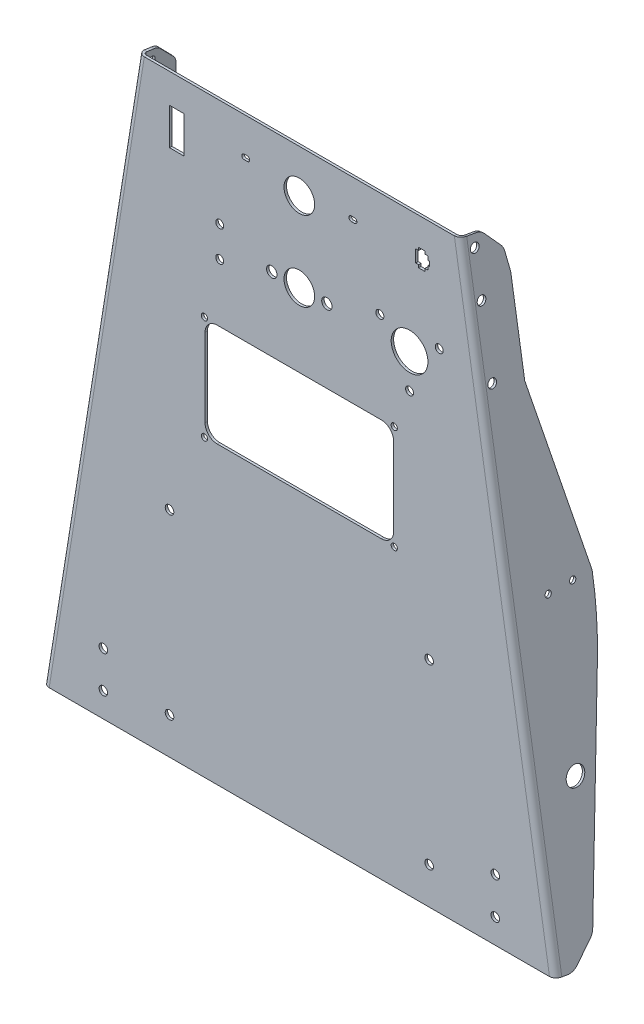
ISO-10303-21;
HEADER;
FILE_DESCRIPTION(('STEP AP214'),'2;1');
FILE_NAME('part.step','',(''),(''),'','','');
FILE_SCHEMA(('AUTOMOTIVE_DESIGN { 1 0 10303 214 1 1 1 1 }'));
ENDSEC;
DATA;
#1=APPLICATION_CONTEXT('core data for automotive mechanical design processes');
#2=APPLICATION_PROTOCOL_DEFINITION('international standard','automotive_design',2000,#1);
#3=PRODUCT_CONTEXT('',#1,'mechanical');
#4=PRODUCT('Part','Part','',(#3));
#5=PRODUCT_RELATED_PRODUCT_CATEGORY('part','',(#4));
#6=PRODUCT_DEFINITION_FORMATION('','',#4);
#7=PRODUCT_DEFINITION_CONTEXT('part definition',#1,'design');
#8=PRODUCT_DEFINITION('design','',#6,#7);
#9=PRODUCT_DEFINITION_SHAPE('','',#8);
#10=(LENGTH_UNIT() NAMED_UNIT(*) SI_UNIT(.MILLI.,.METRE.));
#11=(NAMED_UNIT(*) PLANE_ANGLE_UNIT() SI_UNIT($,.RADIAN.));
#12=(NAMED_UNIT(*) SI_UNIT($,.STERADIAN.) SOLID_ANGLE_UNIT());
#13=UNCERTAINTY_MEASURE_WITH_UNIT(LENGTH_MEASURE(1.E-05),#10,'distance_accuracy_value','');
#14=(GEOMETRIC_REPRESENTATION_CONTEXT(3) GLOBAL_UNCERTAINTY_ASSIGNED_CONTEXT((#13)) GLOBAL_UNIT_ASSIGNED_CONTEXT((#10,
#11,#12)) REPRESENTATION_CONTEXT('',''));
#15=CARTESIAN_POINT('',(0.,0.,0.));
#16=DIRECTION('',(0.,0.,1.));
#17=DIRECTION('',(1.,0.,0.));
#18=AXIS2_PLACEMENT_3D('',#15,#16,#17);
#19=CARTESIAN_POINT('',(-171.96059275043,-151.801622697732,233.238779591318));
#20=DIRECTION('',(0.987412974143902,-0.158163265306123,0.));
#21=DIRECTION('',(-0.0250156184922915,-0.15617246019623,-0.987412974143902));
#22=AXIS2_PLACEMENT_3D('',#19,#20,#21);
#23=PLANE('',#22);
#24=CARTESIAN_POINT('',(-164.87394235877,-107.559677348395,-22.5538950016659));
#25=DIRECTION('',(0.987412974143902,-0.158163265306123,0.));
#26=DIRECTION('',(0.158163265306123,0.987412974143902,0.));
#27=AXIS2_PLACEMENT_3D('',#24,#25,#26);
#28=CIRCLE('',#27,2.5);
#29=CARTESIAN_POINT('',(-164.478534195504,-105.091144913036,-22.5538950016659));
#30=VERTEX_POINT('',#29);
#31=EDGE_CURVE('E641',#30,#30,#28,.T.);
#32=ORIENTED_EDGE('',*,*,#31,.T.);
#33=EDGE_LOOP('',(#32));
#34=FACE_BOUND('',#33,.T.);
#35=CARTESIAN_POINT('',(-147.475983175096,1.05574980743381,-9.00000000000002));
#36=DIRECTION('',(0.987412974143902,-0.158163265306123,0.));
#37=DIRECTION('',(0.158163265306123,0.987412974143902,0.));
#38=AXIS2_PLACEMENT_3D('',#35,#36,#37);
#39=CIRCLE('',#38,3.5);
#40=CARTESIAN_POINT('',(-146.922411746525,4.51169521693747,-9.00000000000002));
#41=VERTEX_POINT('',#40);
#42=EDGE_CURVE('E653',#41,#41,#39,.T.);
#43=ORIENTED_EDGE('',*,*,#42,.T.);
#44=EDGE_LOOP('',(#43));
#45=FACE_BOUND('',#44,.T.);
#46=CARTESIAN_POINT('',(-133.241289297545,89.922917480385,-9.00000000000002));
#47=DIRECTION('',(0.987412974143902,-0.158163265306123,0.));
#48=DIRECTION('',(0.158163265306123,0.987412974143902,0.));
#49=AXIS2_PLACEMENT_3D('',#46,#47,#48);
#50=CIRCLE('',#49,3.49999999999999);
#51=CARTESIAN_POINT('',(-132.687717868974,93.3788628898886,-9.00000000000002));
#52=VERTEX_POINT('',#51);
#53=EDGE_CURVE('E665',#52,#52,#50,.T.);
#54=ORIENTED_EDGE('',*,*,#53,.T.);
#55=EDGE_LOOP('',(#54));
#56=FACE_BOUND('',#55,.T.);
#57=CARTESIAN_POINT('',(-138.777003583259,55.3634633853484,-9.00000000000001));
#58=DIRECTION('',(0.987412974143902,-0.158163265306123,0.));
#59=DIRECTION('',(0.158163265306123,0.987412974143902,0.));
#60=AXIS2_PLACEMENT_3D('',#57,#58,#59);
#61=CIRCLE('',#60,3.5);
#62=CARTESIAN_POINT('',(-138.223432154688,58.819408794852,-9.00000000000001));
#63=VERTEX_POINT('',#62);
#64=EDGE_CURVE('E659',#63,#63,#61,.T.);
#65=ORIENTED_EDGE('',*,*,#64,.T.);
#66=EDGE_LOOP('',(#65));
#67=FACE_BOUND('',#66,.T.);
#68=CARTESIAN_POINT('',(-164.87394235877,-107.559677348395,-42.5538950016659));
#69=DIRECTION('',(0.987412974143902,-0.158163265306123,0.));
#70=DIRECTION('',(0.158163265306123,0.987412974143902,0.));
#71=AXIS2_PLACEMENT_3D('',#68,#69,#70);
#72=CIRCLE('',#71,2.5);
#73=CARTESIAN_POINT('',(-164.478534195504,-105.091144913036,-42.5538950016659));
#74=VERTEX_POINT('',#73);
#75=EDGE_CURVE('E647',#74,#74,#72,.T.);
#76=ORIENTED_EDGE('',*,*,#75,.T.);
#77=EDGE_LOOP('',(#76));
#78=FACE_BOUND('',#77,.T.);
#79=DIRECTION('',(-0.153950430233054,-0.961112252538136,-0.229265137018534));
#80=VECTOR('',#79,1.);
#81=CARTESIAN_POINT('',(-161.324437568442,-85.4001254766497,-52.2679227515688));
#82=LINE('',#81,#80);
#83=CARTESIAN_POINT('',(-149.057615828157,-8.81837993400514,-34.0000000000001));
#84=VERTEX_POINT('',#83);
#85=CARTESIAN_POINT('',(-171.016758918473,-145.909269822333,-66.7018634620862));
#86=VERTEX_POINT('',#85);
#87=EDGE_CURVE('E625',#84,#86,#82,.T.);
#88=ORIENTED_EDGE('',*,*,#87,.T.);
#89=CARTESIAN_POINT('',(-171.96059275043,-151.801622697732,233.238779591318));
#90=DIRECTION('',(-0.987412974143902,0.158163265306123,0.));
#91=DIRECTION('',(-0.0250156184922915,-0.15617246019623,-0.987412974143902));
#92=AXIS2_PLACEMENT_3D('',#89,#90,#91);
#93=CIRCLE('',#92,300.);
#94=CARTESIAN_POINT('',(-180.429493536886,-204.672954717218,-61.9440450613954));
#95=VERTEX_POINT('',#94);
#96=EDGE_CURVE('E1807',#86,#95,#93,.T.);
#97=ORIENTED_EDGE('',*,*,#96,.T.);
#98=DIRECTION('',(-0.155623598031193,-0.971557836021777,0.178484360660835));
#99=VECTOR('',#98,1.);
#100=CARTESIAN_POINT('',(-180.429493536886,-204.672954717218,-61.9440450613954));
#101=LINE('',#100,#99);
#102=CARTESIAN_POINT('',(-206.331367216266,-366.378304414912,-32.2372433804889));
#103=VERTEX_POINT('',#102);
#104=EDGE_CURVE('E1804',#95,#103,#101,.T.);
#105=ORIENTED_EDGE('',*,*,#104,.T.);
#106=CARTESIAN_POINT('',(-206.049070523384,-364.615926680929,-22.3978158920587));
#107=DIRECTION('',(-0.987412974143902,0.158163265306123,0.));
#108=DIRECTION('',(-0.0250156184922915,-0.15617246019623,-0.987412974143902));
#109=AXIS2_PLACEMENT_3D('',#106,#107,#108);
#110=CIRCLE('',#109,10.0000000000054);
#111=CARTESIAN_POINT('',(-207.200495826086,-371.804272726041,-29.2536091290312));
#112=VERTEX_POINT('',#111);
#113=EDGE_CURVE('E1824',#103,#112,#110,.T.);
#114=ORIENTED_EDGE('',*,*,#113,.T.);
#115=DIRECTION('',(-0.108433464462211,-0.67694991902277,0.727997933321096));
#116=VECTOR('',#115,1.);
#117=CARTESIAN_POINT('',(-207.200495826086,-371.804272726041,-29.2536091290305));
#118=LINE('',#117,#116);
#119=CARTESIAN_POINT('',(-209.048151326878,-383.339182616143,-16.8488649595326));
#120=VERTEX_POINT('',#119);
#121=EDGE_CURVE('E1825',#112,#120,#118,.T.);
#122=ORIENTED_EDGE('',*,*,#121,.T.);
#123=CARTESIAN_POINT('',(-207.896726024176,-376.15083657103,-9.99307172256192));
#124=DIRECTION('',(-0.987412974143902,0.158163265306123,0.));
#125=DIRECTION('',(0.0250156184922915,0.15617246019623,0.987412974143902));
#126=AXIS2_PLACEMENT_3D('',#123,#124,#125);
#127=CIRCLE('',#126,10.0000000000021);
#128=CARTESIAN_POINT('',(-209.458450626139,-385.90068038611,-8.41143906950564));
#129=VERTEX_POINT('',#128);
#130=EDGE_CURVE('E1759',#120,#129,#127,.T.);
#131=ORIENTED_EDGE('',*,*,#130,.T.);
#132=DIRECTION('',(0.0250156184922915,0.15617246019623,0.987412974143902));
#133=VECTOR('',#132,1.);
#134=CARTESIAN_POINT('',(-209.458450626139,-385.900680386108,-8.41143906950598));
#135=LINE('',#134,#133);
#136=CARTESIAN_POINT('',(-209.346689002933,-385.202952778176,-4.00000000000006));
#137=VERTEX_POINT('',#136);
#138=EDGE_CURVE('E1728',#129,#137,#135,.T.);
#139=ORIENTED_EDGE('',*,*,#138,.T.);
#140=DIRECTION('',(-0.158163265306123,-0.987412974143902,0.));
#141=VECTOR('',#140,1.);
#142=CARTESIAN_POINT('',(-171.960592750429,-151.801622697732,-4.));
#143=LINE('',#142,#141);
#144=CARTESIAN_POINT('',(-131.659656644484,99.797047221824,-3.99999999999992));
#145=VERTEX_POINT('',#144);
#146=EDGE_CURVE('E1742',#145,#137,#143,.T.);
#147=ORIENTED_EDGE('',*,*,#146,.F.);
#148=DIRECTION('',(-0.0250156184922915,-0.15617246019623,-0.987412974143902));
#149=VECTOR('',#148,1.);
#150=CARTESIAN_POINT('',(-124.815207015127,142.526933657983,266.163152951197));
#151=LINE('',#150,#149);
#152=CARTESIAN_POINT('',(-131.816096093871,98.8203960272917,-10.1749559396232));
#153=VERTEX_POINT('',#152);
#154=EDGE_CURVE('E1758',#145,#153,#151,.T.);
#155=ORIENTED_EDGE('',*,*,#154,.T.);
#156=CARTESIAN_POINT('',(-133.377820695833,89.0705522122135,-8.5933232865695));
#157=DIRECTION('',(-0.987412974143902,0.158163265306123,0.));
#158=DIRECTION('',(0.0250156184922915,0.15617246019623,0.987412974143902));
#159=AXIS2_PLACEMENT_3D('',#156,#157,#158);
#160=CIRCLE('',#159,9.99999999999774);
#161=CARTESIAN_POINT('',(-132.275733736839,95.9508790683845,-15.7659453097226));
#162=VERTEX_POINT('',#161);
#163=EDGE_CURVE('E1762',#153,#162,#160,.T.);
#164=ORIENTED_EDGE('',*,*,#163,.T.);
#165=DIRECTION('',(-0.113444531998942,-0.708234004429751,-0.696803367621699));
#166=VECTOR('',#165,1.);
#167=CARTESIAN_POINT('',(-132.275733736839,95.9508790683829,-15.765945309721));
#168=LINE('',#167,#166);
#169=CARTESIAN_POINT('',(-134.392549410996,82.7356027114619,-28.7679319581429));
#170=VERTEX_POINT('',#169);
#171=EDGE_CURVE('E1767',#162,#170,#168,.T.);
#172=ORIENTED_EDGE('',*,*,#171,.T.);
#173=CARTESIAN_POINT('',(-135.494636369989,75.8552758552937,-21.5953099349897));
#174=DIRECTION('',(-0.987412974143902,0.158163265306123,0.));
#175=DIRECTION('',(-0.0250156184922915,-0.15617246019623,-0.987412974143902));
#176=AXIS2_PLACEMENT_3D('',#173,#174,#175);
#177=CIRCLE('',#176,9.99999999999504);
#178=CARTESIAN_POINT('',(-135.228465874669,77.5169777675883,-31.4526878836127));
#179=VERTEX_POINT('',#178);
#180=EDGE_CURVE('E1771',#170,#179,#177,.T.);
#181=ORIENTED_EDGE('',*,*,#180,.T.);
#182=DIRECTION('',(-0.155907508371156,-0.973330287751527,-0.168288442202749));
#183=VECTOR('',#182,1.);
#184=CARTESIAN_POINT('',(-135.228465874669,77.5169777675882,-31.4526878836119));
#185=LINE('',#184,#183);
#186=CARTESIAN_POINT('',(-137.588372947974,62.7840822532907,-34.));
#187=VERTEX_POINT('',#186);
#188=EDGE_CURVE('E1777',#179,#187,#185,.T.);
#189=ORIENTED_EDGE('',*,*,#188,.T.);
#190=DIRECTION('',(-0.158163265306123,-0.987412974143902,0.));
#191=VECTOR('',#190,1.);
#192=CARTESIAN_POINT('',(-171.960592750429,-151.801622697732,-34.));
#193=LINE('',#192,#191);
#194=EDGE_CURVE('E624',#187,#84,#193,.T.);
#195=ORIENTED_EDGE('',*,*,#194,.T.);
#196=EDGE_LOOP('',(#88,#97,#105,#114,#122,#131,#139,#147,#155,#164,#172,#181,#189,#195));
#197=FACE_BOUND('',#196,.T.);
#198=ADVANCED_FACE('F32',(#34,#45,#56,#67,#78,#197),#23,.F.);
#199=CARTESIAN_POINT('',(-169.985766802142,-152.117949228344,233.238779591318));
#200=DIRECTION('',(0.987412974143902,-0.158163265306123,0.));
#201=DIRECTION('',(-0.0250156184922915,-0.15617246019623,-0.987412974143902));
#202=AXIS2_PLACEMENT_3D('',#199,#200,#201);
#203=PLANE('',#202);
#204=CARTESIAN_POINT('',(-162.899116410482,-107.876003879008,-22.5538950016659));
#205=DIRECTION('',(0.987412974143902,-0.158163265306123,0.));
#206=DIRECTION('',(0.158163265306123,0.987412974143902,0.));
#207=AXIS2_PLACEMENT_3D('',#204,#205,#206);
#208=CIRCLE('',#207,2.5);
#209=CARTESIAN_POINT('',(-162.503708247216,-105.407471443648,-22.5538950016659));
#210=VERTEX_POINT('',#209);
#211=EDGE_CURVE('E636',#210,#210,#208,.T.);
#212=ORIENTED_EDGE('',*,*,#211,.F.);
#213=EDGE_LOOP('',(#212));
#214=FACE_BOUND('',#213,.T.);
#215=CARTESIAN_POINT('',(-145.501157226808,0.73942327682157,-9.00000000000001));
#216=DIRECTION('',(0.987412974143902,-0.158163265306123,0.));
#217=DIRECTION('',(0.158163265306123,0.987412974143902,0.));
#218=AXIS2_PLACEMENT_3D('',#215,#216,#217);
#219=CIRCLE('',#218,3.5);
#220=CARTESIAN_POINT('',(-144.947585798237,4.19536868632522,-9.00000000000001));
#221=VERTEX_POINT('',#220);
#222=EDGE_CURVE('E650',#221,#221,#219,.T.);
#223=ORIENTED_EDGE('',*,*,#222,.F.);
#224=EDGE_LOOP('',(#223));
#225=FACE_BOUND('',#224,.T.);
#226=CARTESIAN_POINT('',(-131.266463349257,89.6065909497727,-9.00000000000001));
#227=DIRECTION('',(0.987412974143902,-0.158163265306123,0.));
#228=DIRECTION('',(0.158163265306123,0.987412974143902,0.));
#229=AXIS2_PLACEMENT_3D('',#226,#227,#228);
#230=CIRCLE('',#229,3.49999999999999);
#231=CARTESIAN_POINT('',(-130.712891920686,93.0625363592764,-9.00000000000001));
#232=VERTEX_POINT('',#231);
#233=EDGE_CURVE('E662',#232,#232,#230,.T.);
#234=ORIENTED_EDGE('',*,*,#233,.F.);
#235=EDGE_LOOP('',(#234));
#236=FACE_BOUND('',#235,.T.);
#237=CARTESIAN_POINT('',(-136.802177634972,55.0471368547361,-9.00000000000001));
#238=DIRECTION('',(0.987412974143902,-0.158163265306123,0.));
#239=DIRECTION('',(0.158163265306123,0.987412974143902,0.));
#240=AXIS2_PLACEMENT_3D('',#237,#238,#239);
#241=CIRCLE('',#240,3.5);
#242=CARTESIAN_POINT('',(-136.2486062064,58.5030822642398,-9.00000000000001));
#243=VERTEX_POINT('',#242);
#244=EDGE_CURVE('E656',#243,#243,#241,.T.);
#245=ORIENTED_EDGE('',*,*,#244,.F.);
#246=EDGE_LOOP('',(#245));
#247=FACE_BOUND('',#246,.T.);
#248=CARTESIAN_POINT('',(-162.899116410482,-107.876003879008,-42.5538950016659));
#249=DIRECTION('',(0.987412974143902,-0.158163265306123,0.));
#250=DIRECTION('',(0.158163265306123,0.987412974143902,0.));
#251=AXIS2_PLACEMENT_3D('',#248,#249,#250);
#252=CIRCLE('',#251,2.5);
#253=CARTESIAN_POINT('',(-162.503708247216,-105.407471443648,-42.5538950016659));
#254=VERTEX_POINT('',#253);
#255=EDGE_CURVE('E644',#254,#254,#252,.T.);
#256=ORIENTED_EDGE('',*,*,#255,.F.);
#257=EDGE_LOOP('',(#256));
#258=FACE_BOUND('',#257,.T.);
#259=CARTESIAN_POINT('',(-169.985766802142,-152.117949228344,233.238779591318));
#260=DIRECTION('',(-0.987412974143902,0.158163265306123,0.));
#261=DIRECTION('',(-0.0250156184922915,-0.15617246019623,-0.987412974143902));
#262=AXIS2_PLACEMENT_3D('',#259,#260,#261);
#263=CIRCLE('',#262,300.);
#264=CARTESIAN_POINT('',(-169.041932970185,-146.225596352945,-66.7018634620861));
#265=VERTEX_POINT('',#264);
#266=CARTESIAN_POINT('',(-178.454667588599,-204.98928124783,-61.9440450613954));
#267=VERTEX_POINT('',#266);
#268=EDGE_CURVE('E1194',#265,#267,#263,.T.);
#269=ORIENTED_EDGE('',*,*,#268,.F.);
#270=DIRECTION('',(-0.153950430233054,-0.961112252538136,-0.229265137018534));
#271=VECTOR('',#270,1.);
#272=CARTESIAN_POINT('',(-159.349611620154,-85.716452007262,-52.2679227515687));
#273=LINE('',#272,#271);
#274=CARTESIAN_POINT('',(-147.082789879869,-9.13470646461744,-34.));
#275=VERTEX_POINT('',#274);
#276=EDGE_CURVE('E622',#275,#265,#273,.T.);
#277=ORIENTED_EDGE('',*,*,#276,.F.);
#278=DIRECTION('',(-0.158163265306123,-0.987412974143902,0.));
#279=VECTOR('',#278,1.);
#280=CARTESIAN_POINT('',(-169.985766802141,-152.117949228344,-34.));
#281=LINE('',#280,#279);
#282=CARTESIAN_POINT('',(-135.613546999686,62.4677557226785,-34.));
#283=VERTEX_POINT('',#282);
#284=EDGE_CURVE('E606',#283,#275,#281,.T.);
#285=ORIENTED_EDGE('',*,*,#284,.F.);
#286=DIRECTION('',(-0.155907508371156,-0.973330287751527,-0.168288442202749));
#287=VECTOR('',#286,1.);
#288=CARTESIAN_POINT('',(-133.253639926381,77.2006512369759,-31.4526878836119));
#289=LINE('',#288,#287);
#290=CARTESIAN_POINT('',(-133.253639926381,77.2006512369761,-31.4526878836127));
#291=VERTEX_POINT('',#290);
#292=EDGE_CURVE('E1819',#291,#283,#289,.T.);
#293=ORIENTED_EDGE('',*,*,#292,.F.);
#294=CARTESIAN_POINT('',(-133.519810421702,75.5389493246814,-21.5953099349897));
#295=DIRECTION('',(-0.987412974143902,0.158163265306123,0.));
#296=DIRECTION('',(-0.0250156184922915,-0.15617246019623,-0.987412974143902));
#297=AXIS2_PLACEMENT_3D('',#294,#295,#296);
#298=CIRCLE('',#297,9.99999999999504);
#299=CARTESIAN_POINT('',(-132.417723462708,82.4192761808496,-28.7679319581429));
#300=VERTEX_POINT('',#299);
#301=EDGE_CURVE('E1817',#300,#291,#298,.T.);
#302=ORIENTED_EDGE('',*,*,#301,.F.);
#303=DIRECTION('',(-0.113444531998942,-0.708234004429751,-0.696803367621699));
#304=VECTOR('',#303,1.);
#305=CARTESIAN_POINT('',(-130.300907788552,95.6345525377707,-15.765945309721));
#306=LINE('',#305,#304);
#307=CARTESIAN_POINT('',(-130.300907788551,95.6345525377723,-15.7659453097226));
#308=VERTEX_POINT('',#307);
#309=EDGE_CURVE('E1815',#308,#300,#306,.T.);
#310=ORIENTED_EDGE('',*,*,#309,.F.);
#311=CARTESIAN_POINT('',(-131.402994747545,88.7542256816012,-8.5933232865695));
#312=DIRECTION('',(-0.987412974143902,0.158163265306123,0.));
#313=DIRECTION('',(0.0250156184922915,0.15617246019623,0.987412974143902));
#314=AXIS2_PLACEMENT_3D('',#311,#312,#313);
#315=CIRCLE('',#314,9.99999999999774);
#316=CARTESIAN_POINT('',(-129.841270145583,98.5040694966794,-10.1749559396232));
#317=VERTEX_POINT('',#316);
#318=EDGE_CURVE('E1397',#317,#308,#315,.T.);
#319=ORIENTED_EDGE('',*,*,#318,.F.);
#320=DIRECTION('',(-0.0250156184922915,-0.15617246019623,-0.987412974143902));
#321=VECTOR('',#320,1.);
#322=CARTESIAN_POINT('',(-122.840381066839,142.210607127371,266.163152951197));
#323=LINE('',#322,#321);
#324=CARTESIAN_POINT('',(-129.684830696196,99.4807206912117,-3.99999999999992));
#325=VERTEX_POINT('',#324);
#326=EDGE_CURVE('E1390',#325,#317,#323,.T.);
#327=ORIENTED_EDGE('',*,*,#326,.F.);
#328=DIRECTION('',(-0.158163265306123,-0.987412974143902,0.));
#329=VECTOR('',#328,1.);
#330=CARTESIAN_POINT('',(-169.985766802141,-152.117949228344,-4.));
#331=LINE('',#330,#329);
#332=CARTESIAN_POINT('',(-207.371863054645,-385.519279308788,-3.99999999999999));
#333=VERTEX_POINT('',#332);
#334=EDGE_CURVE('E1733',#325,#333,#331,.T.);
#335=ORIENTED_EDGE('',*,*,#334,.T.);
#336=DIRECTION('',(0.0250156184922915,0.15617246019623,0.987412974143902));
#337=VECTOR('',#336,1.);
#338=CARTESIAN_POINT('',(-207.483624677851,-386.217006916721,-8.41143906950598));
#339=LINE('',#338,#337);
#340=CARTESIAN_POINT('',(-207.483624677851,-386.217006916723,-8.41143906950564));
#341=VERTEX_POINT('',#340);
#342=EDGE_CURVE('E1398',#341,#333,#339,.T.);
#343=ORIENTED_EDGE('',*,*,#342,.F.);
#344=CARTESIAN_POINT('',(-205.921900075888,-376.467163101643,-9.99307172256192));
#345=DIRECTION('',(-0.987412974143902,0.158163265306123,0.));
#346=DIRECTION('',(0.0250156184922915,0.15617246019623,0.987412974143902));
#347=AXIS2_PLACEMENT_3D('',#344,#345,#346);
#348=CIRCLE('',#347,10.0000000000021);
#349=CARTESIAN_POINT('',(-207.07332537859,-383.655509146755,-16.8488649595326));
#350=VERTEX_POINT('',#349);
#351=EDGE_CURVE('E1714',#350,#341,#348,.T.);
#352=ORIENTED_EDGE('',*,*,#351,.F.);
#353=DIRECTION('',(-0.108433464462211,-0.67694991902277,0.727997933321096));
#354=VECTOR('',#353,1.);
#355=CARTESIAN_POINT('',(-205.225669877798,-372.120599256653,-29.2536091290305));
#356=LINE('',#355,#354);
#357=CARTESIAN_POINT('',(-205.225669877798,-372.120599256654,-29.2536091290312));
#358=VERTEX_POINT('',#357);
#359=EDGE_CURVE('E1724',#358,#350,#356,.T.);
#360=ORIENTED_EDGE('',*,*,#359,.F.);
#361=CARTESIAN_POINT('',(-204.074244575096,-364.932253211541,-22.3978158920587));
#362=DIRECTION('',(-0.987412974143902,0.158163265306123,0.));
#363=DIRECTION('',(-0.0250156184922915,-0.15617246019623,-0.987412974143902));
#364=AXIS2_PLACEMENT_3D('',#361,#362,#363);
#365=CIRCLE('',#364,10.0000000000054);
#366=CARTESIAN_POINT('',(-204.356541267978,-366.694630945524,-32.2372433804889));
#367=VERTEX_POINT('',#366);
#368=EDGE_CURVE('E1809',#367,#358,#365,.T.);
#369=ORIENTED_EDGE('',*,*,#368,.F.);
#370=DIRECTION('',(-0.155623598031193,-0.971557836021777,0.178484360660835));
#371=VECTOR('',#370,1.);
#372=CARTESIAN_POINT('',(-178.454667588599,-204.98928124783,-61.9440450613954));
#373=LINE('',#372,#371);
#374=EDGE_CURVE('E1803',#267,#367,#373,.T.);
#375=ORIENTED_EDGE('',*,*,#374,.F.);
#376=EDGE_LOOP('',(#269,#277,#285,#293,#302,#310,#319,#327,#335,#343,#352,#360,#369,#375));
#377=FACE_BOUND('',#376,.T.);
#378=ADVANCED_FACE('F1177',(#214,#225,#236,#247,#258,#377),#203,.T.);
#379=CARTESIAN_POINT('',(-171.96059275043,-151.801622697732,233.238779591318));
#380=DIRECTION('',(0.987412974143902,-0.158163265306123,0.));
#381=DIRECTION('',(-0.0250156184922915,-0.15617246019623,-0.987412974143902));
#382=AXIS2_PLACEMENT_3D('',#379,#380,#381);
#383=CYLINDRICAL_SURFACE('',#382,300.);
#384=DIRECTION('',(0.987412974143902,-0.158163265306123,0.));
#385=VECTOR('',#384,1.);
#386=CARTESIAN_POINT('',(-169.041932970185,-146.225596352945,-66.7018634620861));
#387=LINE('',#386,#385);
#388=EDGE_CURVE('E631',#265,#86,#387,.F.);
#389=ORIENTED_EDGE('',*,*,#388,.F.);
#390=ORIENTED_EDGE('',*,*,#268,.T.);
#391=DIRECTION('',(0.987412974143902,-0.158163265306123,0.));
#392=VECTOR('',#391,1.);
#393=CARTESIAN_POINT('',(-180.429493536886,-204.672954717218,-61.9440450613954));
#394=LINE('',#393,#392);
#395=EDGE_CURVE('E1737',#95,#267,#394,.T.);
#396=ORIENTED_EDGE('',*,*,#395,.F.);
#397=ORIENTED_EDGE('',*,*,#96,.F.);
#398=EDGE_LOOP('',(#389,#390,#396,#397));
#399=FACE_BOUND('',#398,.T.);
#400=ADVANCED_FACE('F1355',(#399),#383,.T.);
#401=CARTESIAN_POINT('',(-135.228465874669,77.5169777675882,-31.4526878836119));
#402=DIRECTION('',(-0.0266170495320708,-0.16617019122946,0.985737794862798));
#403=DIRECTION('',(0.155907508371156,0.973330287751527,0.168288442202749));
#404=AXIS2_PLACEMENT_3D('',#401,#402,#403);
#405=PLANE('',#404);
#406=DIRECTION('',(0.987412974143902,-0.158163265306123,0.));
#407=VECTOR('',#406,1.);
#408=CARTESIAN_POINT('',(-135.613546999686,62.4677557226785,-34.));
#409=LINE('',#408,#407);
#410=EDGE_CURVE('E628',#283,#187,#409,.F.);
#411=ORIENTED_EDGE('',*,*,#410,.T.);
#412=ORIENTED_EDGE('',*,*,#188,.F.);
#413=DIRECTION('',(0.987412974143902,-0.158163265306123,0.));
#414=VECTOR('',#413,1.);
#415=CARTESIAN_POINT('',(-135.228465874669,77.5169777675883,-31.4526878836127));
#416=LINE('',#415,#414);
#417=EDGE_CURVE('E1780',#179,#291,#416,.T.);
#418=ORIENTED_EDGE('',*,*,#417,.T.);
#419=ORIENTED_EDGE('',*,*,#292,.T.);
#420=EDGE_LOOP('',(#411,#412,#418,#419));
#421=FACE_BOUND('',#420,.T.);
#422=ADVANCED_FACE('F1359',(#421),#405,.F.);
#423=CARTESIAN_POINT('',(173.038924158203,-171.178804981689,112.724981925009));
#424=DIRECTION('',(-0.987412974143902,-0.158163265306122,0.));
#425=DIRECTION('',(-0.0250156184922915,0.15617246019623,0.987412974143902));
#426=AXIS2_PLACEMENT_3D('',#423,#424,#425);
#427=PLANE('',#426);
#428=CARTESIAN_POINT('',(188.504032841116,-267.727450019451,-34.));
#429=DIRECTION('',(-0.987412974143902,-0.158163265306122,0.));
#430=DIRECTION('',(0.158163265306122,-0.987412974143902,0.));
#431=AXIS2_PLACEMENT_3D('',#428,#429,#430);
#432=CIRCLE('',#431,7.50000000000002);
#433=CARTESIAN_POINT('',(189.690257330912,-275.133047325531,-34.));
#434=VERTEX_POINT('',#433);
#435=EDGE_CURVE('E2783',#434,#434,#432,.T.);
#436=ORIENTED_EDGE('',*,*,#435,.F.);
#437=EDGE_LOOP('',(#436));
#438=FACE_BOUND('',#437,.T.);
#439=CARTESIAN_POINT('',(169.225647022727,-147.372522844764,-31.0016158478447));
#440=DIRECTION('',(-0.987412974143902,-0.158163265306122,0.));
#441=DIRECTION('',(0.158163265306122,-0.987412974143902,0.));
#442=AXIS2_PLACEMENT_3D('',#439,#440,#441);
#443=CIRCLE('',#442,2.5);
#444=CARTESIAN_POINT('',(169.621055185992,-149.841055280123,-31.0016158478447));
#445=VERTEX_POINT('',#444);
#446=EDGE_CURVE('E684',#445,#445,#443,.T.);
#447=ORIENTED_EDGE('',*,*,#446,.F.);
#448=EDGE_LOOP('',(#447));
#449=FACE_BOUND('',#448,.T.);
#450=CARTESIAN_POINT('',(145.501157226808,0.739423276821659,-9.00000000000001));
#451=DIRECTION('',(-0.987412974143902,-0.158163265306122,0.));
#452=DIRECTION('',(0.158163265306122,-0.987412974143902,0.));
#453=AXIS2_PLACEMENT_3D('',#450,#451,#452);
#454=CIRCLE('',#453,3.5);
#455=CARTESIAN_POINT('',(146.05472865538,-2.716522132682,-9.00000000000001));
#456=VERTEX_POINT('',#455);
#457=EDGE_CURVE('E698',#456,#456,#454,.T.);
#458=ORIENTED_EDGE('',*,*,#457,.F.);
#459=EDGE_LOOP('',(#458));
#460=FACE_BOUND('',#459,.T.);
#461=CARTESIAN_POINT('',(131.266463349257,89.6065909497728,-9.0000000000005));
#462=DIRECTION('',(-0.987412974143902,-0.158163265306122,0.));
#463=DIRECTION('',(0.158163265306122,-0.987412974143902,0.));
#464=AXIS2_PLACEMENT_3D('',#461,#462,#463);
#465=CIRCLE('',#464,3.5);
#466=CARTESIAN_POINT('',(131.820034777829,86.1506455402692,-9.0000000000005));
#467=VERTEX_POINT('',#466);
#468=EDGE_CURVE('E710',#467,#467,#465,.T.);
#469=ORIENTED_EDGE('',*,*,#468,.F.);
#470=EDGE_LOOP('',(#469));
#471=FACE_BOUND('',#470,.T.);
#472=CARTESIAN_POINT('',(136.802177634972,55.0471368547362,-9.00000000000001));
#473=DIRECTION('',(-0.987412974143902,-0.158163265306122,0.));
#474=DIRECTION('',(0.158163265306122,-0.987412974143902,0.));
#475=AXIS2_PLACEMENT_3D('',#472,#473,#474);
#476=CIRCLE('',#475,3.5);
#477=CARTESIAN_POINT('',(137.355749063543,51.5911914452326,-9.00000000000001));
#478=VERTEX_POINT('',#477);
#479=EDGE_CURVE('E704',#478,#478,#476,.T.);
#480=ORIENTED_EDGE('',*,*,#479,.F.);
#481=EDGE_LOOP('',(#480));
#482=FACE_BOUND('',#481,.T.);
#483=CARTESIAN_POINT('',(169.225647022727,-147.372522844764,-51.0016158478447));
#484=DIRECTION('',(-0.987412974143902,-0.158163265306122,0.));
#485=DIRECTION('',(0.158163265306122,-0.987412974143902,0.));
#486=AXIS2_PLACEMENT_3D('',#483,#484,#485);
#487=CIRCLE('',#486,2.5);
#488=CARTESIAN_POINT('',(169.621055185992,-149.841055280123,-51.0016158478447));
#489=VERTEX_POINT('',#488);
#490=EDGE_CURVE('E692',#489,#489,#487,.T.);
#491=ORIENTED_EDGE('',*,*,#490,.F.);
#492=EDGE_LOOP('',(#491));
#493=FACE_BOUND('',#492,.T.);
#494=DIRECTION('',(-0.155907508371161,0.973330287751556,0.168288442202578));
#495=VECTOR('',#494,1.);
#496=CARTESIAN_POINT('',(133.253639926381,77.2006512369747,-31.4526878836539));
#497=LINE('',#496,#495);
#498=CARTESIAN_POINT('',(135.61354699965,62.4677557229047,-34.));
#499=VERTEX_POINT('',#498);
#500=CARTESIAN_POINT('',(133.253639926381,77.2006512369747,-31.4526878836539));
#501=VERTEX_POINT('',#500);
#502=EDGE_CURVE('E1225',#499,#501,#497,.T.);
#503=ORIENTED_EDGE('',*,*,#502,.F.);
#504=DIRECTION('',(-0.158163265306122,0.987412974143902,0.));
#505=VECTOR('',#504,1.);
#506=CARTESIAN_POINT('',(173.038924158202,-171.178804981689,-34.0000000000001));
#507=LINE('',#506,#505);
#508=CARTESIAN_POINT('',(147.082789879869,-9.13470646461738,-34.));
#509=VERTEX_POINT('',#508);
#510=EDGE_CURVE('E670',#509,#499,#507,.T.);
#511=ORIENTED_EDGE('',*,*,#510,.F.);
#512=DIRECTION('',(-0.154042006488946,0.961683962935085,0.226792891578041));
#513=VECTOR('',#512,1.);
#514=CARTESIAN_POINT('',(166.577939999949,-130.842892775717,-62.7023102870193));
#515=LINE('',#514,#513);
#516=CARTESIAN_POINT('',(169.314432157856,-147.926808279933,-66.7311916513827));
#517=VERTEX_POINT('',#516);
#518=EDGE_CURVE('E668',#517,#509,#515,.T.);
#519=ORIENTED_EDGE('',*,*,#518,.F.);
#520=CARTESIAN_POINT('',(169.985766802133,-152.117949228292,233.238779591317));
#521=DIRECTION('',(0.987412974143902,0.158163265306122,0.));
#522=DIRECTION('',(0.0250156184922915,-0.15617246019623,-0.987412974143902));
#523=AXIS2_PLACEMENT_3D('',#520,#521,#522);
#524=CIRCLE('',#523,300.);
#525=CARTESIAN_POINT('',(178.454667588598,-204.989281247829,-61.9440450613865));
#526=VERTEX_POINT('',#525);
#527=EDGE_CURVE('E1222',#526,#517,#524,.T.);
#528=ORIENTED_EDGE('',*,*,#527,.F.);
#529=DIRECTION('',(-0.155623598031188,0.971557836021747,-0.178484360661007));
#530=VECTOR('',#529,1.);
#531=CARTESIAN_POINT('',(178.454667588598,-204.989281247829,-61.9440450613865));
#532=LINE('',#531,#530);
#533=CARTESIAN_POINT('',(204.356541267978,-366.694630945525,-32.2372433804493));
#534=VERTEX_POINT('',#533);
#535=EDGE_CURVE('E1220',#534,#526,#532,.T.);
#536=ORIENTED_EDGE('',*,*,#535,.F.);
#537=CARTESIAN_POINT('',(204.074244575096,-364.93225321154,-22.3978158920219));
#538=DIRECTION('',(0.987412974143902,0.158163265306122,0.));
#539=DIRECTION('',(0.0250156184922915,-0.15617246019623,-0.987412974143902));
#540=AXIS2_PLACEMENT_3D('',#537,#538,#539);
#541=CIRCLE('',#540,10.0000000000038);
#542=CARTESIAN_POINT('',(205.225669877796,-372.120599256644,-29.2536091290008));
#543=VERTEX_POINT('',#542);
#544=EDGE_CURVE('E1218',#543,#534,#541,.T.);
#545=ORIENTED_EDGE('',*,*,#544,.F.);
#546=DIRECTION('',(-0.108433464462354,0.676949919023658,-0.727997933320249));
#547=VECTOR('',#546,1.);
#548=CARTESIAN_POINT('',(205.225669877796,-372.120599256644,-29.2536091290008));
#549=LINE('',#548,#547);
#550=CARTESIAN_POINT('',(207.073325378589,-383.655509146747,-16.8488649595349));
#551=VERTEX_POINT('',#550);
#552=EDGE_CURVE('E1215',#551,#543,#549,.T.);
#553=ORIENTED_EDGE('',*,*,#552,.F.);
#554=CARTESIAN_POINT('',(205.921900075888,-376.467163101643,-9.99307172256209));
#555=DIRECTION('',(0.987412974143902,0.158163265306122,0.));
#556=DIRECTION('',(-0.0250156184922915,0.15617246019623,0.987412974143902));
#557=AXIS2_PLACEMENT_3D('',#554,#555,#556);
#558=CIRCLE('',#557,9.99999999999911);
#559=CARTESIAN_POINT('',(207.48362467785,-386.217006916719,-8.41143906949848));
#560=VERTEX_POINT('',#559);
#561=EDGE_CURVE('E1208',#560,#551,#558,.T.);
#562=ORIENTED_EDGE('',*,*,#561,.F.);
#563=DIRECTION('',(0.0250156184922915,-0.15617246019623,-0.987412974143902));
#564=VECTOR('',#563,1.);
#565=CARTESIAN_POINT('',(196.722836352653,-319.037425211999,416.336883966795));
#566=LINE('',#565,#564);
#567=CARTESIAN_POINT('',(207.371863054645,-385.519279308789,-4.));
#568=VERTEX_POINT('',#567);
#569=EDGE_CURVE('E1216',#568,#560,#566,.T.);
#570=ORIENTED_EDGE('',*,*,#569,.F.);
#571=DIRECTION('',(-0.158163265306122,0.987412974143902,0.));
#572=VECTOR('',#571,1.);
#573=CARTESIAN_POINT('',(173.038924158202,-171.178804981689,-4.));
#574=LINE('',#573,#572);
#575=CARTESIAN_POINT('',(129.684830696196,99.4807206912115,-3.99999999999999));
#576=VERTEX_POINT('',#575);
#577=EDGE_CURVE('E1286',#568,#576,#574,.T.);
#578=ORIENTED_EDGE('',*,*,#577,.T.);
#579=DIRECTION('',(-0.0250156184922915,0.15617246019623,0.987412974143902));
#580=VECTOR('',#579,1.);
#581=CARTESIAN_POINT('',(129.878793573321,98.269810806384,-11.6560754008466));
#582=LINE('',#581,#580);
#583=CARTESIAN_POINT('',(129.878793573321,98.269810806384,-11.6560754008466));
#584=VERTEX_POINT('',#583);
#585=EDGE_CURVE('E1233',#584,#576,#582,.T.);
#586=ORIENTED_EDGE('',*,*,#585,.F.);
#587=CARTESIAN_POINT('',(131.440518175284,88.5199669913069,-10.0744427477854));
#588=DIRECTION('',(0.987412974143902,0.158163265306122,0.));
#589=DIRECTION('',(0.0250156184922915,-0.15617246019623,-0.987412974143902));
#590=AXIS2_PLACEMENT_3D('',#587,#588,#589);
#591=CIRCLE('',#590,10.);
#592=CARTESIAN_POINT('',(130.398099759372,95.0277832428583,-17.5951934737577));
#593=VERTEX_POINT('',#592);
#594=EDGE_CURVE('E1231',#593,#584,#591,.T.);
#595=ORIENTED_EDGE('',*,*,#594,.F.);
#596=DIRECTION('',(-0.118950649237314,0.742608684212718,0.659077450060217));
#597=VECTOR('',#596,1.);
#598=CARTESIAN_POINT('',(130.398099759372,95.0277832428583,-17.5951934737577));
#599=LINE('',#598,#597);
#600=CARTESIAN_POINT('',(132.47739200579,82.0467655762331,-29.1160606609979));
#601=VERTEX_POINT('',#600);
#602=EDGE_CURVE('E1229',#601,#593,#599,.T.);
#603=ORIENTED_EDGE('',*,*,#602,.F.);
#604=CARTESIAN_POINT('',(133.519810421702,75.5389493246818,-21.5953099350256));
#605=DIRECTION('',(0.987412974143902,0.158163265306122,0.));
#606=DIRECTION('',(0.0250156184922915,-0.15617246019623,-0.987412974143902));
#607=AXIS2_PLACEMENT_3D('',#604,#605,#606);
#608=CIRCLE('',#607,10.);
#609=EDGE_CURVE('E1227',#501,#601,#608,.T.);
#610=ORIENTED_EDGE('',*,*,#609,.F.);
#611=EDGE_LOOP('',(#503,#511,#519,#528,#536,#545,#553,#562,#570,#578,#586,#595,#603,#610));
#612=FACE_BOUND('',#611,.T.);
#613=ADVANCED_FACE('F1362',(#438,#449,#460,#471,#482,#493,#612),#427,.T.);
#614=CARTESIAN_POINT('',(175.013750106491,-170.862478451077,112.724981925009));
#615=DIRECTION('',(-0.987412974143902,-0.158163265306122,0.));
#616=DIRECTION('',(-0.0250156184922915,0.15617246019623,0.987412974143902));
#617=AXIS2_PLACEMENT_3D('',#614,#615,#616);
#618=PLANE('',#617);
#619=CARTESIAN_POINT('',(190.478858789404,-267.411123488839,-34.));
#620=DIRECTION('',(0.987412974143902,0.158163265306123,0.));
#621=DIRECTION('',(-0.158163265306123,0.987412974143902,0.));
#622=AXIS2_PLACEMENT_3D('',#619,#620,#621);
#623=CIRCLE('',#622,7.50000000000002);
#624=CARTESIAN_POINT('',(189.292634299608,-260.00552618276,-34.));
#625=VERTEX_POINT('',#624);
#626=EDGE_CURVE('E2786',#625,#625,#623,.T.);
#627=ORIENTED_EDGE('',*,*,#626,.F.);
#628=EDGE_LOOP('',(#627));
#629=FACE_BOUND('',#628,.T.);
#630=CARTESIAN_POINT('',(171.200472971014,-147.056196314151,-31.0016158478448));
#631=DIRECTION('',(-0.987412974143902,-0.158163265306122,0.));
#632=DIRECTION('',(0.158163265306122,-0.987412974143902,0.));
#633=AXIS2_PLACEMENT_3D('',#630,#631,#632);
#634=CIRCLE('',#633,2.5);
#635=CARTESIAN_POINT('',(171.59588113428,-149.524728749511,-31.0016158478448));
#636=VERTEX_POINT('',#635);
#637=EDGE_CURVE('E689',#636,#636,#634,.T.);
#638=ORIENTED_EDGE('',*,*,#637,.T.);
#639=EDGE_LOOP('',(#638));
#640=FACE_BOUND('',#639,.T.);
#641=CARTESIAN_POINT('',(147.475983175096,1.0557498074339,-9.00000000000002));
#642=DIRECTION('',(-0.987412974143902,-0.158163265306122,0.));
#643=DIRECTION('',(0.158163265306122,-0.987412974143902,0.));
#644=AXIS2_PLACEMENT_3D('',#641,#642,#643);
#645=CIRCLE('',#644,3.5);
#646=CARTESIAN_POINT('',(148.029554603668,-2.40019560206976,-9.00000000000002));
#647=VERTEX_POINT('',#646);
#648=EDGE_CURVE('E701',#647,#647,#645,.T.);
#649=ORIENTED_EDGE('',*,*,#648,.T.);
#650=EDGE_LOOP('',(#649));
#651=FACE_BOUND('',#650,.T.);
#652=CARTESIAN_POINT('',(133.241289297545,89.922917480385,-9.00000000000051));
#653=DIRECTION('',(-0.987412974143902,-0.158163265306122,0.));
#654=DIRECTION('',(0.158163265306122,-0.987412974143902,0.));
#655=AXIS2_PLACEMENT_3D('',#652,#653,#654);
#656=CIRCLE('',#655,3.5);
#657=CARTESIAN_POINT('',(133.794860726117,86.4669720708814,-9.00000000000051));
#658=VERTEX_POINT('',#657);
#659=EDGE_CURVE('E713',#658,#658,#656,.T.);
#660=ORIENTED_EDGE('',*,*,#659,.T.);
#661=EDGE_LOOP('',(#660));
#662=FACE_BOUND('',#661,.T.);
#663=CARTESIAN_POINT('',(138.777003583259,55.3634633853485,-9.00000000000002));
#664=DIRECTION('',(-0.987412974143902,-0.158163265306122,0.));
#665=DIRECTION('',(0.158163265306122,-0.987412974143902,0.));
#666=AXIS2_PLACEMENT_3D('',#663,#664,#665);
#667=CIRCLE('',#666,3.5);
#668=CARTESIAN_POINT('',(139.330575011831,51.9075179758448,-9.00000000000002));
#669=VERTEX_POINT('',#668);
#670=EDGE_CURVE('E707',#669,#669,#667,.T.);
#671=ORIENTED_EDGE('',*,*,#670,.T.);
#672=EDGE_LOOP('',(#671));
#673=FACE_BOUND('',#672,.T.);
#674=CARTESIAN_POINT('',(171.200472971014,-147.056196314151,-51.0016158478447));
#675=DIRECTION('',(-0.987412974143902,-0.158163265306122,0.));
#676=DIRECTION('',(0.158163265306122,-0.987412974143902,0.));
#677=AXIS2_PLACEMENT_3D('',#674,#675,#676);
#678=CIRCLE('',#677,2.5);
#679=CARTESIAN_POINT('',(171.59588113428,-149.524728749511,-51.0016158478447));
#680=VERTEX_POINT('',#679);
#681=EDGE_CURVE('E695',#680,#680,#678,.T.);
#682=ORIENTED_EDGE('',*,*,#681,.T.);
#683=EDGE_LOOP('',(#682));
#684=FACE_BOUND('',#683,.T.);
#685=DIRECTION('',(-0.158163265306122,0.987412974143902,0.));
#686=VECTOR('',#685,1.);
#687=CARTESIAN_POINT('',(175.01375010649,-170.862478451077,-34.0000000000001));
#688=LINE('',#687,#686);
#689=CARTESIAN_POINT('',(149.057615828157,-8.81837993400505,-34.0000000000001));
#690=VERTEX_POINT('',#689);
#691=CARTESIAN_POINT('',(137.588372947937,62.784082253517,-34.));
#692=VERTEX_POINT('',#691);
#693=EDGE_CURVE('E673',#690,#692,#688,.T.);
#694=ORIENTED_EDGE('',*,*,#693,.T.);
#695=DIRECTION('',(-0.155907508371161,0.973330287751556,0.168288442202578));
#696=VECTOR('',#695,1.);
#697=CARTESIAN_POINT('',(135.228465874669,77.5169777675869,-31.4526878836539));
#698=LINE('',#697,#696);
#699=CARTESIAN_POINT('',(135.228465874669,77.5169777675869,-31.4526878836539));
#700=VERTEX_POINT('',#699);
#701=EDGE_CURVE('E1246',#692,#700,#698,.T.);
#702=ORIENTED_EDGE('',*,*,#701,.T.);
#703=CARTESIAN_POINT('',(135.494636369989,75.855275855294,-21.5953099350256));
#704=DIRECTION('',(0.987412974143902,0.158163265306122,0.));
#705=DIRECTION('',(0.0250156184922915,-0.15617246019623,-0.987412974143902));
#706=AXIS2_PLACEMENT_3D('',#703,#704,#705);
#707=CIRCLE('',#706,10.);
#708=CARTESIAN_POINT('',(134.452217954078,82.3630921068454,-29.1160606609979));
#709=VERTEX_POINT('',#708);
#710=EDGE_CURVE('E1248',#700,#709,#707,.T.);
#711=ORIENTED_EDGE('',*,*,#710,.T.);
#712=DIRECTION('',(-0.118950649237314,0.742608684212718,0.659077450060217));
#713=VECTOR('',#712,1.);
#714=CARTESIAN_POINT('',(132.37292570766,95.3441097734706,-17.5951934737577));
#715=LINE('',#714,#713);
#716=CARTESIAN_POINT('',(132.37292570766,95.3441097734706,-17.5951934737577));
#717=VERTEX_POINT('',#716);
#718=EDGE_CURVE('E1250',#709,#717,#715,.T.);
#719=ORIENTED_EDGE('',*,*,#718,.T.);
#720=CARTESIAN_POINT('',(133.415344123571,88.8362935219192,-10.0744427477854));
#721=DIRECTION('',(0.987412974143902,0.158163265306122,0.));
#722=DIRECTION('',(0.0250156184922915,-0.15617246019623,-0.987412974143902));
#723=AXIS2_PLACEMENT_3D('',#720,#721,#722);
#724=CIRCLE('',#723,10.);
#725=CARTESIAN_POINT('',(131.853619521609,98.5861373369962,-11.6560754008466));
#726=VERTEX_POINT('',#725);
#727=EDGE_CURVE('E1252',#717,#726,#724,.T.);
#728=ORIENTED_EDGE('',*,*,#727,.T.);
#729=DIRECTION('',(-0.0250156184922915,0.15617246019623,0.987412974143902));
#730=VECTOR('',#729,1.);
#731=CARTESIAN_POINT('',(131.853619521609,98.5861373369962,-11.6560754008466));
#732=LINE('',#731,#730);
#733=CARTESIAN_POINT('',(131.659656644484,99.797047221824,-3.99999999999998));
#734=VERTEX_POINT('',#733);
#735=EDGE_CURVE('E1254',#726,#734,#732,.T.);
#736=ORIENTED_EDGE('',*,*,#735,.T.);
#737=DIRECTION('',(-0.158163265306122,0.987412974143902,0.));
#738=VECTOR('',#737,1.);
#739=CARTESIAN_POINT('',(175.01375010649,-170.862478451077,-4.));
#740=LINE('',#739,#738);
#741=CARTESIAN_POINT('',(209.346689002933,-385.202952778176,-4.00000000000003));
#742=VERTEX_POINT('',#741);
#743=EDGE_CURVE('E1282',#742,#734,#740,.T.);
#744=ORIENTED_EDGE('',*,*,#743,.F.);
#745=DIRECTION('',(0.0250156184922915,-0.15617246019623,-0.987412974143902));
#746=VECTOR('',#745,1.);
#747=CARTESIAN_POINT('',(198.69766230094,-318.721098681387,416.336883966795));
#748=LINE('',#747,#746);
#749=CARTESIAN_POINT('',(209.458450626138,-385.900680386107,-8.41143906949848));
#750=VERTEX_POINT('',#749);
#751=EDGE_CURVE('E1237',#742,#750,#748,.T.);
#752=ORIENTED_EDGE('',*,*,#751,.T.);
#753=CARTESIAN_POINT('',(207.896726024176,-376.150836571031,-9.99307172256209));
#754=DIRECTION('',(0.987412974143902,0.158163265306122,0.));
#755=DIRECTION('',(-0.0250156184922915,0.15617246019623,0.987412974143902));
#756=AXIS2_PLACEMENT_3D('',#753,#754,#755);
#757=CIRCLE('',#756,9.99999999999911);
#758=CARTESIAN_POINT('',(209.048151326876,-383.339182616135,-16.8488649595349));
#759=VERTEX_POINT('',#758);
#760=EDGE_CURVE('E1234',#750,#759,#757,.T.);
#761=ORIENTED_EDGE('',*,*,#760,.T.);
#762=DIRECTION('',(-0.108433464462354,0.676949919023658,-0.727997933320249));
#763=VECTOR('',#762,1.);
#764=CARTESIAN_POINT('',(207.200495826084,-371.804272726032,-29.2536091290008));
#765=LINE('',#764,#763);
#766=CARTESIAN_POINT('',(207.200495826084,-371.804272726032,-29.2536091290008));
#767=VERTEX_POINT('',#766);
#768=EDGE_CURVE('E1236',#759,#767,#765,.T.);
#769=ORIENTED_EDGE('',*,*,#768,.T.);
#770=CARTESIAN_POINT('',(206.049070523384,-364.615926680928,-22.3978158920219));
#771=DIRECTION('',(0.987412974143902,0.158163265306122,0.));
#772=DIRECTION('',(0.0250156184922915,-0.15617246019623,-0.987412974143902));
#773=AXIS2_PLACEMENT_3D('',#770,#771,#772);
#774=CIRCLE('',#773,10.0000000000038);
#775=CARTESIAN_POINT('',(206.331367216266,-366.378304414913,-32.2372433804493));
#776=VERTEX_POINT('',#775);
#777=EDGE_CURVE('E1239',#767,#776,#774,.T.);
#778=ORIENTED_EDGE('',*,*,#777,.T.);
#779=DIRECTION('',(-0.155623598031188,0.971557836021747,-0.178484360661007));
#780=VECTOR('',#779,1.);
#781=CARTESIAN_POINT('',(180.429493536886,-204.672954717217,-61.9440450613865));
#782=LINE('',#781,#780);
#783=CARTESIAN_POINT('',(180.429493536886,-204.672954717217,-61.9440450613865));
#784=VERTEX_POINT('',#783);
#785=EDGE_CURVE('E1241',#776,#784,#782,.T.);
#786=ORIENTED_EDGE('',*,*,#785,.T.);
#787=CARTESIAN_POINT('',(171.960592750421,-151.80162269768,233.238779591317));
#788=DIRECTION('',(0.987412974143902,0.158163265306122,0.));
#789=DIRECTION('',(0.0250156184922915,-0.15617246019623,-0.987412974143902));
#790=AXIS2_PLACEMENT_3D('',#787,#788,#789);
#791=CIRCLE('',#790,300.);
#792=CARTESIAN_POINT('',(171.289258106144,-147.610481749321,-66.7311916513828));
#793=VERTEX_POINT('',#792);
#794=EDGE_CURVE('E1243',#784,#793,#791,.T.);
#795=ORIENTED_EDGE('',*,*,#794,.T.);
#796=DIRECTION('',(-0.154042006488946,0.961683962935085,0.226792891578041));
#797=VECTOR('',#796,1.);
#798=CARTESIAN_POINT('',(168.552765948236,-130.526566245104,-62.7023102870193));
#799=LINE('',#798,#797);
#800=EDGE_CURVE('E672',#793,#690,#799,.T.);
#801=ORIENTED_EDGE('',*,*,#800,.T.);
#802=EDGE_LOOP('',(#694,#702,#711,#719,#728,#736,#744,#752,#761,#769,#778,#786,#795,#801));
#803=FACE_BOUND('',#802,.T.);
#804=ADVANCED_FACE('F1312',(#629,#640,#651,#662,#673,#684,#803),#618,.F.);
#805=CARTESIAN_POINT('',(171.960592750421,-151.80162269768,233.238779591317));
#806=DIRECTION('',(-0.987412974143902,-0.158163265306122,0.));
#807=DIRECTION('',(-0.0250156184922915,0.15617246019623,0.987412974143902));
#808=AXIS2_PLACEMENT_3D('',#805,#806,#807);
#809=CYLINDRICAL_SURFACE('',#808,300.);
#810=DIRECTION('',(-0.987412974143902,-0.158163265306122,0.));
#811=VECTOR('',#810,1.);
#812=CARTESIAN_POINT('',(169.314432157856,-147.926808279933,-66.7311916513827));
#813=LINE('',#812,#811);
#814=EDGE_CURVE('E676',#517,#793,#813,.F.);
#815=ORIENTED_EDGE('',*,*,#814,.T.);
#816=ORIENTED_EDGE('',*,*,#794,.F.);
#817=DIRECTION('',(-0.987412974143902,-0.158163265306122,0.));
#818=VECTOR('',#817,1.);
#819=CARTESIAN_POINT('',(180.429493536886,-204.672954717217,-61.9440450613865));
#820=LINE('',#819,#818);
#821=EDGE_CURVE('E1267',#784,#526,#820,.T.);
#822=ORIENTED_EDGE('',*,*,#821,.T.);
#823=ORIENTED_EDGE('',*,*,#527,.T.);
#824=EDGE_LOOP('',(#815,#816,#822,#823));
#825=FACE_BOUND('',#824,.T.);
#826=ADVANCED_FACE('F1331',(#825),#809,.T.);
#827=CARTESIAN_POINT('',(135.228465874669,77.5169777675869,-31.4526878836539));
#828=DIRECTION('',(0.0266170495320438,-0.166170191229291,0.985737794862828));
#829=DIRECTION('',(0.155907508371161,-0.973330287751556,-0.168288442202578));
#830=AXIS2_PLACEMENT_3D('',#827,#828,#829);
#831=PLANE('',#830);
#832=DIRECTION('',(-0.987412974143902,-0.158163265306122,0.));
#833=VECTOR('',#832,1.);
#834=CARTESIAN_POINT('',(135.61354699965,62.4677557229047,-34.));
#835=LINE('',#834,#833);
#836=EDGE_CURVE('E679',#499,#692,#835,.F.);
#837=ORIENTED_EDGE('',*,*,#836,.F.);
#838=ORIENTED_EDGE('',*,*,#502,.T.);
#839=DIRECTION('',(-0.987412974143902,-0.158163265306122,0.));
#840=VECTOR('',#839,1.);
#841=CARTESIAN_POINT('',(135.228465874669,77.5169777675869,-31.4526878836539));
#842=LINE('',#841,#840);
#843=EDGE_CURVE('E1264',#700,#501,#842,.T.);
#844=ORIENTED_EDGE('',*,*,#843,.F.);
#845=ORIENTED_EDGE('',*,*,#701,.F.);
#846=EDGE_LOOP('',(#837,#838,#844,#845));
#847=FACE_BOUND('',#846,.T.);
#848=ADVANCED_FACE('F1328',(#847),#831,.F.);
#849=CARTESIAN_POINT('',(198.69766230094,-318.721098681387,416.336883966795));
#850=DIRECTION('',(-0.15617246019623,0.974984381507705,-0.158163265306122));
#851=DIRECTION('',(0.987412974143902,0.158163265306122,0.));
#852=AXIS2_PLACEMENT_3D('',#849,#850,#851);
#853=PLANE('',#852);
#854=CARTESIAN_POINT('',(207.371863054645,-385.519279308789,-3.99999999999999));
#855=CARTESIAN_POINT('',(209.346689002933,-385.202952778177,-3.99999999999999));
#856=B_SPLINE_CURVE_WITH_KNOTS('',1,(#854,#855),.UNSPECIFIED.,.F.,.F.,(2,2),(0.,1.),.UNSPECIFIED.);
#857=EDGE_CURVE('E834',#568,#742,#856,.T.);
#858=ORIENTED_EDGE('',*,*,#857,.F.);
#859=ORIENTED_EDGE('',*,*,#569,.T.);
#860=DIRECTION('',(-0.987412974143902,-0.158163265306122,0.));
#861=VECTOR('',#860,1.);
#862=CARTESIAN_POINT('',(209.458450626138,-385.900680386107,-8.41143906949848));
#863=LINE('',#862,#861);
#864=EDGE_CURVE('E1279',#750,#560,#863,.T.);
#865=ORIENTED_EDGE('',*,*,#864,.F.);
#866=ORIENTED_EDGE('',*,*,#751,.F.);
#867=EDGE_LOOP('',(#858,#859,#865,#866));
#868=FACE_BOUND('',#867,.T.);
#869=ADVANCED_FACE('F34',(#868),#853,.F.);
#870=CARTESIAN_POINT('',(131.853619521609,98.5861373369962,-11.6560754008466));
#871=DIRECTION('',(0.15617246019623,-0.974984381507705,0.158163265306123));
#872=DIRECTION('',(0.0250156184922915,-0.15617246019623,-0.987412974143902));
#873=AXIS2_PLACEMENT_3D('',#870,#871,#872);
#874=PLANE('',#873);
#875=CARTESIAN_POINT('',(131.659656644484,99.7970472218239,-3.99999999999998));
#876=CARTESIAN_POINT('',(129.684830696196,99.4807206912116,-3.99999999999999));
#877=B_SPLINE_CURVE_WITH_KNOTS('',1,(#875,#876),.UNSPECIFIED.,.F.,.F.,(2,2),(0.,1.),.UNSPECIFIED.);
#878=EDGE_CURVE('E821',#734,#576,#877,.T.);
#879=ORIENTED_EDGE('',*,*,#878,.F.);
#880=ORIENTED_EDGE('',*,*,#735,.F.);
#881=DIRECTION('',(-0.987412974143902,-0.158163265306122,0.));
#882=VECTOR('',#881,1.);
#883=CARTESIAN_POINT('',(131.853619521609,98.5861373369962,-11.6560754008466));
#884=LINE('',#883,#882);
#885=EDGE_CURVE('E1255',#726,#584,#884,.T.);
#886=ORIENTED_EDGE('',*,*,#885,.T.);
#887=ORIENTED_EDGE('',*,*,#585,.T.);
#888=EDGE_LOOP('',(#879,#880,#886,#887));
#889=FACE_BOUND('',#888,.T.);
#890=ADVANCED_FACE('F1301',(#889),#874,.F.);
#891=CARTESIAN_POINT('',(207.896726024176,-376.150836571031,-9.99307172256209));
#892=DIRECTION('',(-0.987412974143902,-0.158163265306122,0.));
#893=DIRECTION('',(-0.0250156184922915,0.15617246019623,0.987412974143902));
#894=AXIS2_PLACEMENT_3D('',#891,#892,#893);
#895=CYLINDRICAL_SURFACE('',#894,9.99999999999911);
#896=ORIENTED_EDGE('',*,*,#561,.T.);
#897=DIRECTION('',(-0.987412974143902,-0.158163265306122,0.));
#898=VECTOR('',#897,1.);
#899=CARTESIAN_POINT('',(209.048151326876,-383.339182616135,-16.8488649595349));
#900=LINE('',#899,#898);
#901=EDGE_CURVE('E1276',#759,#551,#900,.T.);
#902=ORIENTED_EDGE('',*,*,#901,.F.);
#903=ORIENTED_EDGE('',*,*,#760,.F.);
#904=ORIENTED_EDGE('',*,*,#864,.T.);
#905=EDGE_LOOP('',(#896,#902,#903,#904));
#906=FACE_BOUND('',#905,.T.);
#907=ADVANCED_FACE('F1311',(#906),#895,.T.);
#908=CARTESIAN_POINT('',(207.200495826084,-371.804272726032,-29.2536091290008));
#909=DIRECTION('',(-0.115142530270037,0.718834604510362,0.685579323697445));
#910=DIRECTION('',(0.108433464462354,-0.676949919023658,0.727997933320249));
#911=AXIS2_PLACEMENT_3D('',#908,#909,#910);
#912=PLANE('',#911);
#913=ORIENTED_EDGE('',*,*,#552,.T.);
#914=DIRECTION('',(-0.987412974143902,-0.158163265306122,0.));
#915=VECTOR('',#914,1.);
#916=CARTESIAN_POINT('',(207.200495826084,-371.804272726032,-29.2536091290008));
#917=LINE('',#916,#915);
#918=EDGE_CURVE('E1273',#767,#543,#917,.T.);
#919=ORIENTED_EDGE('',*,*,#918,.F.);
#920=ORIENTED_EDGE('',*,*,#768,.F.);
#921=ORIENTED_EDGE('',*,*,#901,.T.);
#922=EDGE_LOOP('',(#913,#919,#920,#921));
#923=FACE_BOUND('',#922,.T.);
#924=ADVANCED_FACE('F1342',(#923),#912,.F.);
#925=CARTESIAN_POINT('',(206.049070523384,-364.615926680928,-22.3978158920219));
#926=DIRECTION('',(-0.987412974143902,-0.158163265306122,0.));
#927=DIRECTION('',(-0.0250156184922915,0.15617246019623,0.987412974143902));
#928=AXIS2_PLACEMENT_3D('',#925,#926,#927);
#929=CYLINDRICAL_SURFACE('',#928,10.0000000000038);
#930=ORIENTED_EDGE('',*,*,#544,.T.);
#931=DIRECTION('',(-0.987412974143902,-0.158163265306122,0.));
#932=VECTOR('',#931,1.);
#933=CARTESIAN_POINT('',(206.331367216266,-366.378304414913,-32.2372433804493));
#934=LINE('',#933,#932);
#935=EDGE_CURVE('E1270',#776,#534,#934,.T.);
#936=ORIENTED_EDGE('',*,*,#935,.F.);
#937=ORIENTED_EDGE('',*,*,#777,.F.);
#938=ORIENTED_EDGE('',*,*,#918,.T.);
#939=EDGE_LOOP('',(#930,#936,#937,#938));
#940=FACE_BOUND('',#939,.T.);
#941=ADVANCED_FACE('F1338',(#940),#929,.T.);
#942=CARTESIAN_POINT('',(180.429493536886,-204.672954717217,-61.9440450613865));
#943=DIRECTION('',(-0.0282296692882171,0.176237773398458,0.983942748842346));
#944=DIRECTION('',(0.155623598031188,-0.971557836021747,0.178484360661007));
#945=AXIS2_PLACEMENT_3D('',#942,#943,#944);
#946=PLANE('',#945);
#947=ORIENTED_EDGE('',*,*,#535,.T.);
#948=ORIENTED_EDGE('',*,*,#821,.F.);
#949=ORIENTED_EDGE('',*,*,#785,.F.);
#950=ORIENTED_EDGE('',*,*,#935,.T.);
#951=EDGE_LOOP('',(#947,#948,#949,#950));
#952=FACE_BOUND('',#951,.T.);
#953=ADVANCED_FACE('F1326',(#952),#946,.F.);
#954=CARTESIAN_POINT('',(135.494636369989,75.855275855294,-21.5953099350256));
#955=DIRECTION('',(-0.987412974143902,-0.158163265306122,0.));
#956=DIRECTION('',(-0.0250156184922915,0.15617246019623,0.987412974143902));
#957=AXIS2_PLACEMENT_3D('',#954,#955,#956);
#958=CYLINDRICAL_SURFACE('',#957,10.);
#959=ORIENTED_EDGE('',*,*,#609,.T.);
#960=DIRECTION('',(-0.987412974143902,-0.158163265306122,0.));
#961=VECTOR('',#960,1.);
#962=CARTESIAN_POINT('',(134.452217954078,82.3630921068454,-29.1160606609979));
#963=LINE('',#962,#961);
#964=EDGE_CURVE('E1261',#709,#601,#963,.T.);
#965=ORIENTED_EDGE('',*,*,#964,.F.);
#966=ORIENTED_EDGE('',*,*,#710,.F.);
#967=ORIENTED_EDGE('',*,*,#843,.T.);
#968=EDGE_LOOP('',(#959,#965,#966,#967));
#969=FACE_BOUND('',#968,.T.);
#970=ADVANCED_FACE('F1322',(#969),#958,.T.);
#971=CARTESIAN_POINT('',(132.37292570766,95.3441097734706,-17.5951934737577));
#972=DIRECTION('',(0.104241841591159,-0.650781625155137,0.752075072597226));
#973=DIRECTION('',(0.118950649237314,-0.742608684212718,-0.659077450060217));
#974=AXIS2_PLACEMENT_3D('',#971,#972,#973);
#975=PLANE('',#974);
#976=ORIENTED_EDGE('',*,*,#602,.T.);
#977=DIRECTION('',(-0.987412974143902,-0.158163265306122,0.));
#978=VECTOR('',#977,1.);
#979=CARTESIAN_POINT('',(132.37292570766,95.3441097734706,-17.5951934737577));
#980=LINE('',#979,#978);
#981=EDGE_CURVE('E1258',#717,#593,#980,.T.);
#982=ORIENTED_EDGE('',*,*,#981,.F.);
#983=ORIENTED_EDGE('',*,*,#718,.F.);
#984=ORIENTED_EDGE('',*,*,#964,.T.);
#985=EDGE_LOOP('',(#976,#982,#983,#984));
#986=FACE_BOUND('',#985,.T.);
#987=ADVANCED_FACE('F1318',(#986),#975,.F.);
#988=CARTESIAN_POINT('',(133.415344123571,88.8362935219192,-10.0744427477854));
#989=DIRECTION('',(-0.987412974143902,-0.158163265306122,0.));
#990=DIRECTION('',(-0.0250156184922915,0.15617246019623,0.987412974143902));
#991=AXIS2_PLACEMENT_3D('',#988,#989,#990);
#992=CYLINDRICAL_SURFACE('',#991,10.);
#993=ORIENTED_EDGE('',*,*,#594,.T.);
#994=ORIENTED_EDGE('',*,*,#885,.F.);
#995=ORIENTED_EDGE('',*,*,#727,.F.);
#996=ORIENTED_EDGE('',*,*,#981,.T.);
#997=EDGE_LOOP('',(#993,#994,#995,#996));
#998=FACE_BOUND('',#997,.T.);
#999=ADVANCED_FACE('F1314',(#998),#992,.T.);
#1000=CARTESIAN_POINT('',(-180.429493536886,-204.672954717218,-61.9440450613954));
#1001=DIRECTION('',(0.02822966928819,0.176237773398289,0.983942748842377));
#1002=DIRECTION('',(0.155623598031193,0.971557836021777,-0.178484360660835));
#1003=AXIS2_PLACEMENT_3D('',#1000,#1001,#1002);
#1004=PLANE('',#1003);
#1005=ORIENTED_EDGE('',*,*,#374,.T.);
#1006=DIRECTION('',(0.987412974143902,-0.158163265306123,0.));
#1007=VECTOR('',#1006,1.);
#1008=CARTESIAN_POINT('',(-206.331367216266,-366.378304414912,-32.2372433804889));
#1009=LINE('',#1008,#1007);
#1010=EDGE_CURVE('E1794',#103,#367,#1009,.T.);
#1011=ORIENTED_EDGE('',*,*,#1010,.F.);
#1012=ORIENTED_EDGE('',*,*,#104,.F.);
#1013=ORIENTED_EDGE('',*,*,#395,.T.);
#1014=EDGE_LOOP('',(#1005,#1011,#1012,#1013));
#1015=FACE_BOUND('',#1014,.T.);
#1016=ADVANCED_FACE('F1317',(#1015),#1004,.F.);
#1017=CARTESIAN_POINT('',(-206.049070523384,-364.615926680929,-22.3978158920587));
#1018=DIRECTION('',(0.987412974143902,-0.158163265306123,0.));
#1019=DIRECTION('',(-0.0250156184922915,-0.15617246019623,-0.987412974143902));
#1020=AXIS2_PLACEMENT_3D('',#1017,#1018,#1019);
#1021=CYLINDRICAL_SURFACE('',#1020,10.0000000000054);
#1022=ORIENTED_EDGE('',*,*,#368,.T.);
#1023=DIRECTION('',(0.987412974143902,-0.158163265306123,0.));
#1024=VECTOR('',#1023,1.);
#1025=CARTESIAN_POINT('',(-207.200495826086,-371.804272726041,-29.2536091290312));
#1026=LINE('',#1025,#1024);
#1027=EDGE_CURVE('E1792',#112,#358,#1026,.T.);
#1028=ORIENTED_EDGE('',*,*,#1027,.F.);
#1029=ORIENTED_EDGE('',*,*,#113,.F.);
#1030=ORIENTED_EDGE('',*,*,#1010,.T.);
#1031=EDGE_LOOP('',(#1022,#1028,#1029,#1030));
#1032=FACE_BOUND('',#1031,.T.);
#1033=ADVANCED_FACE('F1696',(#1032),#1021,.T.);
#1034=CARTESIAN_POINT('',(-207.200495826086,-371.804272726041,-29.2536091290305));
#1035=DIRECTION('',(0.115142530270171,0.718834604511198,0.685579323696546));
#1036=DIRECTION('',(0.108433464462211,0.67694991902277,-0.727997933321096));
#1037=AXIS2_PLACEMENT_3D('',#1034,#1035,#1036);
#1038=PLANE('',#1037);
#1039=ORIENTED_EDGE('',*,*,#359,.T.);
#1040=DIRECTION('',(0.987412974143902,-0.158163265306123,0.));
#1041=VECTOR('',#1040,1.);
#1042=CARTESIAN_POINT('',(-209.048151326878,-383.339182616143,-16.8488649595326));
#1043=LINE('',#1042,#1041);
#1044=EDGE_CURVE('E1720',#120,#350,#1043,.T.);
#1045=ORIENTED_EDGE('',*,*,#1044,.F.);
#1046=ORIENTED_EDGE('',*,*,#121,.F.);
#1047=ORIENTED_EDGE('',*,*,#1027,.T.);
#1048=EDGE_LOOP('',(#1039,#1045,#1046,#1047));
#1049=FACE_BOUND('',#1048,.T.);
#1050=ADVANCED_FACE('F1700',(#1049),#1038,.F.);
#1051=CARTESIAN_POINT('',(-207.896726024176,-376.15083657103,-9.99307172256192));
#1052=DIRECTION('',(0.987412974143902,-0.158163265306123,0.));
#1053=DIRECTION('',(-0.0250156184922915,-0.15617246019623,-0.987412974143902));
#1054=AXIS2_PLACEMENT_3D('',#1051,#1052,#1053);
#1055=CYLINDRICAL_SURFACE('',#1054,10.0000000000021);
#1056=ORIENTED_EDGE('',*,*,#351,.T.);
#1057=DIRECTION('',(0.987412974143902,-0.158163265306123,0.));
#1058=VECTOR('',#1057,1.);
#1059=CARTESIAN_POINT('',(-209.458450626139,-385.90068038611,-8.41143906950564));
#1060=LINE('',#1059,#1058);
#1061=EDGE_CURVE('E1717',#129,#341,#1060,.T.);
#1062=ORIENTED_EDGE('',*,*,#1061,.F.);
#1063=ORIENTED_EDGE('',*,*,#130,.F.);
#1064=ORIENTED_EDGE('',*,*,#1044,.T.);
#1065=EDGE_LOOP('',(#1056,#1062,#1063,#1064));
#1066=FACE_BOUND('',#1065,.T.);
#1067=ADVANCED_FACE('F1703',(#1066),#1055,.T.);
#1068=CARTESIAN_POINT('',(-209.458450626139,-385.900680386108,-8.41143906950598));
#1069=DIRECTION('',(0.15617246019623,0.974984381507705,-0.158163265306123));
#1070=DIRECTION('',(-0.987412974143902,0.158163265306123,0.));
#1071=AXIS2_PLACEMENT_3D('',#1068,#1069,#1070);
#1072=PLANE('',#1071);
#1073=CARTESIAN_POINT('',(-209.346689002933,-385.202952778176,-3.99999999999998));
#1074=CARTESIAN_POINT('',(-207.371863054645,-385.519279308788,-3.99999999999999));
#1075=B_SPLINE_CURVE_WITH_KNOTS('',1,(#1073,#1074),.UNSPECIFIED.,.F.,.F.,(2,2),(0.,1.),.UNSPECIFIED.);
#1076=EDGE_CURVE('E941',#137,#333,#1075,.T.);
#1077=ORIENTED_EDGE('',*,*,#1076,.F.);
#1078=ORIENTED_EDGE('',*,*,#138,.F.);
#1079=ORIENTED_EDGE('',*,*,#1061,.T.);
#1080=ORIENTED_EDGE('',*,*,#342,.T.);
#1081=EDGE_LOOP('',(#1077,#1078,#1079,#1080));
#1082=FACE_BOUND('',#1081,.T.);
#1083=ADVANCED_FACE('F1380',(#1082),#1072,.F.);
#1084=CARTESIAN_POINT('',(-124.815207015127,142.526933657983,266.163152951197));
#1085=DIRECTION('',(-0.15617246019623,-0.974984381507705,0.158163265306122));
#1086=DIRECTION('',(0.0250156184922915,0.15617246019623,0.987412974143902));
#1087=AXIS2_PLACEMENT_3D('',#1084,#1085,#1086);
#1088=PLANE('',#1087);
#1089=CARTESIAN_POINT('',(-129.684830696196,99.4807206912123,-3.99999999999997));
#1090=CARTESIAN_POINT('',(-131.659656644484,99.7970472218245,-3.99999999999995));
#1091=B_SPLINE_CURVE_WITH_KNOTS('',1,(#1089,#1090),.UNSPECIFIED.,.F.,.F.,(2,2),(0.,1.),.UNSPECIFIED.);
#1092=EDGE_CURVE('E954',#325,#145,#1091,.T.);
#1093=ORIENTED_EDGE('',*,*,#1092,.F.);
#1094=ORIENTED_EDGE('',*,*,#326,.T.);
#1095=DIRECTION('',(0.987412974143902,-0.158163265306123,0.));
#1096=VECTOR('',#1095,1.);
#1097=CARTESIAN_POINT('',(-131.816096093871,98.8203960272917,-10.1749559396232));
#1098=LINE('',#1097,#1096);
#1099=EDGE_CURVE('E1729',#153,#317,#1098,.T.);
#1100=ORIENTED_EDGE('',*,*,#1099,.F.);
#1101=ORIENTED_EDGE('',*,*,#154,.F.);
#1102=EDGE_LOOP('',(#1093,#1094,#1100,#1101));
#1103=FACE_BOUND('',#1102,.T.);
#1104=ADVANCED_FACE('F1375',(#1103),#1088,.F.);
#1105=CARTESIAN_POINT('',(-133.377820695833,89.0705522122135,-8.5933232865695));
#1106=DIRECTION('',(0.987412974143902,-0.158163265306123,0.));
#1107=DIRECTION('',(-0.0250156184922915,-0.15617246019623,-0.987412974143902));
#1108=AXIS2_PLACEMENT_3D('',#1105,#1106,#1107);
#1109=CYLINDRICAL_SURFACE('',#1108,9.99999999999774);
#1110=ORIENTED_EDGE('',*,*,#318,.T.);
#1111=DIRECTION('',(0.987412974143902,-0.158163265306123,0.));
#1112=VECTOR('',#1111,1.);
#1113=CARTESIAN_POINT('',(-132.275733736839,95.9508790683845,-15.7659453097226));
#1114=LINE('',#1113,#1112);
#1115=EDGE_CURVE('E1786',#162,#308,#1114,.T.);
#1116=ORIENTED_EDGE('',*,*,#1115,.F.);
#1117=ORIENTED_EDGE('',*,*,#163,.F.);
#1118=ORIENTED_EDGE('',*,*,#1099,.T.);
#1119=EDGE_LOOP('',(#1110,#1116,#1117,#1118));
#1120=FACE_BOUND('',#1119,.T.);
#1121=ADVANCED_FACE('F1371',(#1120),#1109,.T.);
#1122=CARTESIAN_POINT('',(-132.275733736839,95.9508790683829,-15.765945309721));
#1123=DIRECTION('',(-0.110208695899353,-0.688032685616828,0.717262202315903));
#1124=DIRECTION('',(0.113444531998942,0.708234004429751,0.696803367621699));
#1125=AXIS2_PLACEMENT_3D('',#1122,#1123,#1124);
#1126=PLANE('',#1125);
#1127=ORIENTED_EDGE('',*,*,#309,.T.);
#1128=DIRECTION('',(0.987412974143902,-0.158163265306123,0.));
#1129=VECTOR('',#1128,1.);
#1130=CARTESIAN_POINT('',(-134.392549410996,82.7356027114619,-28.7679319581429));
#1131=LINE('',#1130,#1129);
#1132=EDGE_CURVE('E1783',#170,#300,#1131,.T.);
#1133=ORIENTED_EDGE('',*,*,#1132,.F.);
#1134=ORIENTED_EDGE('',*,*,#171,.F.);
#1135=ORIENTED_EDGE('',*,*,#1115,.T.);
#1136=EDGE_LOOP('',(#1127,#1133,#1134,#1135));
#1137=FACE_BOUND('',#1136,.T.);
#1138=ADVANCED_FACE('F1367',(#1137),#1126,.F.);
#1139=CARTESIAN_POINT('',(-135.494636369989,75.8552758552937,-21.5953099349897));
#1140=DIRECTION('',(0.987412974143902,-0.158163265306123,0.));
#1141=DIRECTION('',(-0.0250156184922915,-0.15617246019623,-0.987412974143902));
#1142=AXIS2_PLACEMENT_3D('',#1139,#1140,#1141);
#1143=CYLINDRICAL_SURFACE('',#1142,9.99999999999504);
#1144=ORIENTED_EDGE('',*,*,#301,.T.);
#1145=ORIENTED_EDGE('',*,*,#417,.F.);
#1146=ORIENTED_EDGE('',*,*,#180,.F.);
#1147=ORIENTED_EDGE('',*,*,#1132,.T.);
#1148=EDGE_LOOP('',(#1144,#1145,#1146,#1147));
#1149=FACE_BOUND('',#1148,.T.);
#1150=ADVANCED_FACE('F1364',(#1149),#1143,.T.);
#1151=CARTESIAN_POINT('',(61.0250223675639,-189.121129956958,1.));
#1152=DIRECTION('',(0.,0.,-1.));
#1153=DIRECTION('',(-1.,0.,0.));
#1154=AXIS2_PLACEMENT_3D('',#1151,#1152,#1153);
#1155=PLANE('',#1154);
#1156=DIRECTION('',(1.,0.,0.));
#1157=VECTOR('',#1156,1.);
#1158=CARTESIAN_POINT('',(95.,65.0000000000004,1.));
#1159=LINE('',#1158,#1157);
#1160=CARTESIAN_POINT('',(95.,65.0000000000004,1.));
#1161=VERTEX_POINT('',#1160);
#1162=CARTESIAN_POINT('',(97.4,65.0000000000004,1.));
#1163=VERTEX_POINT('',#1162);
#1164=EDGE_CURVE('E469',#1161,#1163,#1159,.T.);
#1165=ORIENTED_EDGE('',*,*,#1164,.F.);
#1166=DIRECTION('',(0.,-1.,0.));
#1167=VECTOR('',#1166,1.);
#1168=CARTESIAN_POINT('',(95.,75.0000000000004,1.));
#1169=LINE('',#1168,#1167);
#1170=CARTESIAN_POINT('',(95.,75.0000000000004,1.));
#1171=VERTEX_POINT('',#1170);
#1172=EDGE_CURVE('E48',#1171,#1161,#1169,.T.);
#1173=ORIENTED_EDGE('',*,*,#1172,.F.);
#1174=DIRECTION('',(-1.,0.,0.));
#1175=VECTOR('',#1174,1.);
#1176=CARTESIAN_POINT('',(95.,75.0000000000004,1.));
#1177=LINE('',#1176,#1175);
#1178=CARTESIAN_POINT('',(97.4,75.0000000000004,1.));
#1179=VERTEX_POINT('',#1178);
#1180=EDGE_CURVE('E515',#1179,#1171,#1177,.T.);
#1181=ORIENTED_EDGE('',*,*,#1180,.F.);
#1182=DIRECTION('',(0.,-1.,0.));
#1183=VECTOR('',#1182,1.);
#1184=CARTESIAN_POINT('',(97.4,75.0000000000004,1.));
#1185=LINE('',#1184,#1183);
#1186=CARTESIAN_POINT('',(97.4,77.2500000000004,1.));
#1187=VERTEX_POINT('',#1186);
#1188=EDGE_CURVE('E512',#1187,#1179,#1185,.T.);
#1189=ORIENTED_EDGE('',*,*,#1188,.F.);
#1190=DIRECTION('',(-1.,0.,0.));
#1191=VECTOR('',#1190,1.);
#1192=CARTESIAN_POINT('',(97.4,77.2500000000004,1.));
#1193=LINE('',#1192,#1191);
#1194=CARTESIAN_POINT('',(102.6,77.2500000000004,1.));
#1195=VERTEX_POINT('',#1194);
#1196=EDGE_CURVE('E509',#1195,#1187,#1193,.T.);
#1197=ORIENTED_EDGE('',*,*,#1196,.F.);
#1198=DIRECTION('',(0.,1.,0.));
#1199=VECTOR('',#1198,1.);
#1200=CARTESIAN_POINT('',(102.6,75.0000000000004,1.));
#1201=LINE('',#1200,#1199);
#1202=CARTESIAN_POINT('',(102.6,75.0000000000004,1.));
#1203=VERTEX_POINT('',#1202);
#1204=EDGE_CURVE('E506',#1203,#1195,#1201,.T.);
#1205=ORIENTED_EDGE('',*,*,#1204,.F.);
#1206=DIRECTION('',(-1.,0.,0.));
#1207=VECTOR('',#1206,1.);
#1208=CARTESIAN_POINT('',(102.6,75.0000000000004,1.));
#1209=LINE('',#1208,#1207);
#1210=CARTESIAN_POINT('',(105.,75.0000000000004,1.));
#1211=VERTEX_POINT('',#1210);
#1212=EDGE_CURVE('E503',#1211,#1203,#1209,.T.);
#1213=ORIENTED_EDGE('',*,*,#1212,.F.);
#1214=DIRECTION('',(0.,1.,0.));
#1215=VECTOR('',#1214,1.);
#1216=CARTESIAN_POINT('',(105.,75.0000000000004,1.));
#1217=LINE('',#1216,#1215);
#1218=CARTESIAN_POINT('',(105.,71.8000000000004,1.));
#1219=VERTEX_POINT('',#1218);
#1220=EDGE_CURVE('E500',#1219,#1211,#1217,.T.);
#1221=ORIENTED_EDGE('',*,*,#1220,.F.);
#1222=DIRECTION('',(-1.,0.,0.));
#1223=VECTOR('',#1222,1.);
#1224=CARTESIAN_POINT('',(105.,71.8000000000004,1.));
#1225=LINE('',#1224,#1223);
#1226=CARTESIAN_POINT('',(106.1,71.8000000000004,1.));
#1227=VERTEX_POINT('',#1226);
#1228=EDGE_CURVE('E497',#1227,#1219,#1225,.T.);
#1229=ORIENTED_EDGE('',*,*,#1228,.F.);
#1230=DIRECTION('',(0.,1.,0.));
#1231=VECTOR('',#1230,1.);
#1232=CARTESIAN_POINT('',(106.1,71.8000000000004,1.));
#1233=LINE('',#1232,#1231);
#1234=CARTESIAN_POINT('',(106.1,68.2000000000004,1.));
#1235=VERTEX_POINT('',#1234);
#1236=EDGE_CURVE('E494',#1235,#1227,#1233,.T.);
#1237=ORIENTED_EDGE('',*,*,#1236,.F.);
#1238=DIRECTION('',(1.,0.,0.));
#1239=VECTOR('',#1238,1.);
#1240=CARTESIAN_POINT('',(105.,68.2000000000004,1.));
#1241=LINE('',#1240,#1239);
#1242=CARTESIAN_POINT('',(105.,68.2000000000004,1.));
#1243=VERTEX_POINT('',#1242);
#1244=EDGE_CURVE('E491',#1243,#1235,#1241,.T.);
#1245=ORIENTED_EDGE('',*,*,#1244,.F.);
#1246=DIRECTION('',(0.,1.,0.));
#1247=VECTOR('',#1246,1.);
#1248=CARTESIAN_POINT('',(105.,68.2000000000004,1.));
#1249=LINE('',#1248,#1247);
#1250=CARTESIAN_POINT('',(105.,65.0000000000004,1.));
#1251=VERTEX_POINT('',#1250);
#1252=EDGE_CURVE('E488',#1251,#1243,#1249,.T.);
#1253=ORIENTED_EDGE('',*,*,#1252,.F.);
#1254=DIRECTION('',(1.,0.,0.));
#1255=VECTOR('',#1254,1.);
#1256=CARTESIAN_POINT('',(102.6,65.0000000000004,1.));
#1257=LINE('',#1256,#1255);
#1258=CARTESIAN_POINT('',(102.6,65.0000000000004,1.));
#1259=VERTEX_POINT('',#1258);
#1260=EDGE_CURVE('E485',#1259,#1251,#1257,.T.);
#1261=ORIENTED_EDGE('',*,*,#1260,.F.);
#1262=DIRECTION('',(0.,1.,0.));
#1263=VECTOR('',#1262,1.);
#1264=CARTESIAN_POINT('',(102.6,65.0000000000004,1.));
#1265=LINE('',#1264,#1263);
#1266=CARTESIAN_POINT('',(102.6,62.7500000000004,1.));
#1267=VERTEX_POINT('',#1266);
#1268=EDGE_CURVE('E479',#1267,#1259,#1265,.T.);
#1269=ORIENTED_EDGE('',*,*,#1268,.F.);
#1270=DIRECTION('',(1.,0.,0.));
#1271=VECTOR('',#1270,1.);
#1272=CARTESIAN_POINT('',(97.4,62.7500000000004,1.));
#1273=LINE('',#1272,#1271);
#1274=CARTESIAN_POINT('',(97.4,62.7500000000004,1.));
#1275=VERTEX_POINT('',#1274);
#1276=EDGE_CURVE('E477',#1275,#1267,#1273,.T.);
#1277=ORIENTED_EDGE('',*,*,#1276,.F.);
#1278=DIRECTION('',(0.,-1.,0.));
#1279=VECTOR('',#1278,1.);
#1280=CARTESIAN_POINT('',(97.4,65.0000000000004,1.));
#1281=LINE('',#1280,#1279);
#1282=EDGE_CURVE('E460',#1163,#1275,#1281,.T.);
#1283=ORIENTED_EDGE('',*,*,#1282,.F.);
#1284=EDGE_LOOP('',(#1165,#1173,#1181,#1189,#1197,#1205,#1213,#1221,#1229,#1237,#1245,#1253,
#1261,#1269,#1277,#1283));
#1285=FACE_BOUND('',#1284,.T.);
#1286=CARTESIAN_POINT('',(90.,4.16333634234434E-13,1.));
#1287=DIRECTION('',(0.,0.,1.));
#1288=DIRECTION('',(1.,0.,0.));
#1289=AXIS2_PLACEMENT_3D('',#1286,#1287,#1288);
#1290=CIRCLE('',#1289,15.);
#1291=CARTESIAN_POINT('',(105.,4.16333634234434E-13,1.));
#1292=VERTEX_POINT('',#1291);
#1293=EDGE_CURVE('E520',#1292,#1292,#1290,.T.);
#1294=ORIENTED_EDGE('',*,*,#1293,.F.);
#1295=EDGE_LOOP('',(#1294));
#1296=FACE_BOUND('',#1295,.T.);
#1297=CARTESIAN_POINT('',(90.,-27.9999999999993,1.));
#1298=DIRECTION('',(0.,0.,1.));
#1299=DIRECTION('',(1.,0.,0.));
#1300=AXIS2_PLACEMENT_3D('',#1297,#1298,#1299);
#1301=CIRCLE('',#1300,3.24999999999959);
#1302=CARTESIAN_POINT('',(93.2499999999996,-27.9999999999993,1.));
#1303=VERTEX_POINT('',#1302);
#1304=EDGE_CURVE('E550',#1303,#1303,#1301,.T.);
#1305=ORIENTED_EDGE('',*,*,#1304,.F.);
#1306=EDGE_LOOP('',(#1305));
#1307=FACE_BOUND('',#1306,.T.);
#1308=CARTESIAN_POINT('',(114.248711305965,13.9999999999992,1.));
#1309=DIRECTION('',(0.,0.,1.));
#1310=DIRECTION('',(1.,0.,0.));
#1311=AXIS2_PLACEMENT_3D('',#1308,#1309,#1310);
#1312=CIRCLE('',#1311,3.24999999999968);
#1313=CARTESIAN_POINT('',(117.498711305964,13.9999999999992,1.));
#1314=VERTEX_POINT('',#1313);
#1315=EDGE_CURVE('E554',#1314,#1314,#1312,.T.);
#1316=ORIENTED_EDGE('',*,*,#1315,.F.);
#1317=EDGE_LOOP('',(#1316));
#1318=FACE_BOUND('',#1317,.T.);
#1319=CARTESIAN_POINT('',(77.5,-144.5,1.));
#1320=DIRECTION('',(0.,0.,1.));
#1321=DIRECTION('',(1.,0.,0.));
#1322=AXIS2_PLACEMENT_3D('',#1319,#1320,#1321);
#1323=CIRCLE('',#1322,2.54999999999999);
#1324=CARTESIAN_POINT('',(80.05,-144.5,1.));
#1325=VERTEX_POINT('',#1324);
#1326=EDGE_CURVE('E558',#1325,#1325,#1323,.T.);
#1327=ORIENTED_EDGE('',*,*,#1326,.F.);
#1328=EDGE_LOOP('',(#1327));
#1329=FACE_BOUND('',#1328,.T.);
#1330=CARTESIAN_POINT('',(65.7512886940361,14.0000000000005,1.));
#1331=DIRECTION('',(0.,0.,1.));
#1332=DIRECTION('',(1.,0.,0.));
#1333=AXIS2_PLACEMENT_3D('',#1330,#1331,#1332);
#1334=CIRCLE('',#1333,3.2499999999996);
#1335=CARTESIAN_POINT('',(69.0012886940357,14.0000000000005,1.));
#1336=VERTEX_POINT('',#1335);
#1337=EDGE_CURVE('E562',#1336,#1336,#1334,.T.);
#1338=ORIENTED_EDGE('',*,*,#1337,.F.);
#1339=EDGE_LOOP('',(#1338));
#1340=FACE_BOUND('',#1339,.T.);
#1341=CARTESIAN_POINT('',(-77.5,-144.5,1.));
#1342=DIRECTION('',(0.,0.,1.));
#1343=DIRECTION('',(1.,0.,0.));
#1344=AXIS2_PLACEMENT_3D('',#1341,#1342,#1343);
#1345=CIRCLE('',#1344,2.54999999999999);
#1346=CARTESIAN_POINT('',(-74.95,-144.5,1.));
#1347=VERTEX_POINT('',#1346);
#1348=EDGE_CURVE('E566',#1347,#1347,#1345,.T.);
#1349=ORIENTED_EDGE('',*,*,#1348,.F.);
#1350=EDGE_LOOP('',(#1349));
#1351=FACE_BOUND('',#1350,.T.);
#1352=CARTESIAN_POINT('',(77.5,-59.5,1.));
#1353=DIRECTION('',(0.,0.,1.));
#1354=DIRECTION('',(1.,0.,0.));
#1355=AXIS2_PLACEMENT_3D('',#1352,#1353,#1354);
#1356=CIRCLE('',#1355,2.54999999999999);
#1357=CARTESIAN_POINT('',(80.05,-59.5,1.));
#1358=VERTEX_POINT('',#1357);
#1359=EDGE_CURVE('E572',#1358,#1358,#1356,.T.);
#1360=ORIENTED_EDGE('',*,*,#1359,.F.);
#1361=EDGE_LOOP('',(#1360));
#1362=FACE_BOUND('',#1361,.T.);
#1363=CARTESIAN_POINT('',(-77.5,-59.5,1.));
#1364=DIRECTION('',(0.,0.,1.));
#1365=DIRECTION('',(1.,0.,0.));
#1366=AXIS2_PLACEMENT_3D('',#1363,#1364,#1365);
#1367=CIRCLE('',#1366,2.54999999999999);
#1368=CARTESIAN_POINT('',(-74.95,-59.5,1.));
#1369=VERTEX_POINT('',#1368);
#1370=EDGE_CURVE('E576',#1369,#1369,#1367,.T.);
#1371=ORIENTED_EDGE('',*,*,#1370,.F.);
#1372=EDGE_LOOP('',(#1371));
#1373=FACE_BOUND('',#1372,.T.);
#1374=CARTESIAN_POINT('',(67.,-70.,1.));
#1375=DIRECTION('',(0.,0.,1.));
#1376=DIRECTION('',(1.,0.,0.));
#1377=AXIS2_PLACEMENT_3D('',#1374,#1375,#1376);
#1378=CIRCLE('',#1377,9.99999999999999);
#1379=CARTESIAN_POINT('',(77.,-70.,1.));
#1380=VERTEX_POINT('',#1379);
#1381=CARTESIAN_POINT('',(67.,-60.,1.));
#1382=VERTEX_POINT('',#1381);
#1383=EDGE_CURVE('E597',#1380,#1382,#1378,.T.);
#1384=ORIENTED_EDGE('',*,*,#1383,.F.);
#1385=DIRECTION('',(0.,1.,0.));
#1386=VECTOR('',#1385,1.);
#1387=CARTESIAN_POINT('',(77.,-70.,1.));
#1388=LINE('',#1387,#1386);
#1389=CARTESIAN_POINT('',(77.,-134.,1.));
#1390=VERTEX_POINT('',#1389);
#1391=EDGE_CURVE('E594',#1390,#1380,#1388,.T.);
#1392=ORIENTED_EDGE('',*,*,#1391,.F.);
#1393=CARTESIAN_POINT('',(67.,-134.,1.));
#1394=DIRECTION('',(0.,0.,1.));
#1395=DIRECTION('',(-1.,0.,0.));
#1396=AXIS2_PLACEMENT_3D('',#1393,#1394,#1395);
#1397=CIRCLE('',#1396,9.99999999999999);
#1398=CARTESIAN_POINT('',(67.,-144.,1.));
#1399=VERTEX_POINT('',#1398);
#1400=EDGE_CURVE('E591',#1399,#1390,#1397,.T.);
#1401=ORIENTED_EDGE('',*,*,#1400,.F.);
#1402=DIRECTION('',(1.,0.,0.));
#1403=VECTOR('',#1402,1.);
#1404=CARTESIAN_POINT('',(-67.,-144.,1.));
#1405=LINE('',#1404,#1403);
#1406=CARTESIAN_POINT('',(-67.,-144.,1.));
#1407=VERTEX_POINT('',#1406);
#1408=EDGE_CURVE('E588',#1407,#1399,#1405,.T.);
#1409=ORIENTED_EDGE('',*,*,#1408,.F.);
#1410=CARTESIAN_POINT('',(-67.,-134.,1.));
#1411=DIRECTION('',(0.,0.,1.));
#1412=DIRECTION('',(-1.,0.,0.));
#1413=AXIS2_PLACEMENT_3D('',#1410,#1411,#1412);
#1414=CIRCLE('',#1413,10.);
#1415=CARTESIAN_POINT('',(-77.,-134.,1.));
#1416=VERTEX_POINT('',#1415);
#1417=EDGE_CURVE('E585',#1416,#1407,#1414,.T.);
#1418=ORIENTED_EDGE('',*,*,#1417,.F.);
#1419=DIRECTION('',(0.,-1.,0.));
#1420=VECTOR('',#1419,1.);
#1421=CARTESIAN_POINT('',(-77.,-70.,1.));
#1422=LINE('',#1421,#1420);
#1423=CARTESIAN_POINT('',(-77.,-70.,1.));
#1424=VERTEX_POINT('',#1423);
#1425=EDGE_CURVE('E582',#1424,#1416,#1422,.T.);
#1426=ORIENTED_EDGE('',*,*,#1425,.F.);
#1427=CARTESIAN_POINT('',(-67.,-70.,1.));
#1428=DIRECTION('',(0.,0.,1.));
#1429=DIRECTION('',(-1.,0.,0.));
#1430=AXIS2_PLACEMENT_3D('',#1427,#1428,#1429);
#1431=CIRCLE('',#1430,9.99999999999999);
#1432=CARTESIAN_POINT('',(-67.,-60.,1.));
#1433=VERTEX_POINT('',#1432);
#1434=EDGE_CURVE('E580',#1433,#1424,#1431,.T.);
#1435=ORIENTED_EDGE('',*,*,#1434,.F.);
#1436=DIRECTION('',(-1.,0.,0.));
#1437=VECTOR('',#1436,1.);
#1438=CARTESIAN_POINT('',(-67.,-60.,1.));
#1439=LINE('',#1438,#1437);
#1440=EDGE_CURVE('E600',#1382,#1433,#1439,.T.);
#1441=ORIENTED_EDGE('',*,*,#1440,.F.);
#1442=EDGE_LOOP('',(#1384,#1392,#1401,#1409,#1418,#1426,#1435,#1441));
#1443=FACE_BOUND('',#1442,.T.);
#1444=CARTESIAN_POINT('',(22.5,0.,1.));
#1445=DIRECTION('',(0.,0.,1.));
#1446=DIRECTION('',(1.,0.,0.));
#1447=AXIS2_PLACEMENT_3D('',#1444,#1445,#1446);
#1448=CIRCLE('',#1447,4.25);
#1449=CARTESIAN_POINT('',(26.75,0.,1.));
#1450=VERTEX_POINT('',#1449);
#1451=EDGE_CURVE('E997',#1450,#1450,#1448,.T.);
#1452=ORIENTED_EDGE('',*,*,#1451,.F.);
#1453=EDGE_LOOP('',(#1452));
#1454=FACE_BOUND('',#1453,.T.);
#1455=DIRECTION('',(0.,-1.,0.));
#1456=VECTOR('',#1455,1.);
#1457=CARTESIAN_POINT('',(-106.,76.0000000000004,1.));
#1458=LINE('',#1457,#1456);
#1459=CARTESIAN_POINT('',(-106.,76.0000000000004,1.));
#1460=VERTEX_POINT('',#1459);
#1461=CARTESIAN_POINT('',(-106.,46.0000000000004,1.));
#1462=VERTEX_POINT('',#1461);
#1463=EDGE_CURVE('E1018',#1460,#1462,#1458,.T.);
#1464=ORIENTED_EDGE('',*,*,#1463,.F.);
#1465=DIRECTION('',(-1.,0.,0.));
#1466=VECTOR('',#1465,1.);
#1467=CARTESIAN_POINT('',(-106.,76.0000000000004,1.));
#1468=LINE('',#1467,#1466);
#1469=CARTESIAN_POINT('',(-94.,76.0000000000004,1.));
#1470=VERTEX_POINT('',#1469);
#1471=EDGE_CURVE('E1025',#1470,#1460,#1468,.T.);
#1472=ORIENTED_EDGE('',*,*,#1471,.F.);
#1473=DIRECTION('',(0.,1.,0.));
#1474=VECTOR('',#1473,1.);
#1475=CARTESIAN_POINT('',(-94.,76.0000000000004,1.));
#1476=LINE('',#1475,#1474);
#1477=CARTESIAN_POINT('',(-94.,46.0000000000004,1.));
#1478=VERTEX_POINT('',#1477);
#1479=EDGE_CURVE('E1022',#1478,#1470,#1476,.T.);
#1480=ORIENTED_EDGE('',*,*,#1479,.F.);
#1481=DIRECTION('',(1.,0.,0.));
#1482=VECTOR('',#1481,1.);
#1483=CARTESIAN_POINT('',(-106.,46.0000000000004,1.));
#1484=LINE('',#1483,#1482);
#1485=EDGE_CURVE('E1020',#1462,#1478,#1484,.T.);
#1486=ORIENTED_EDGE('',*,*,#1485,.F.);
#1487=EDGE_LOOP('',(#1464,#1472,#1480,#1486));
#1488=FACE_BOUND('',#1487,.T.);
#1489=CARTESIAN_POINT('',(106.,-210.,1.));
#1490=DIRECTION('',(0.,0.,1.));
#1491=DIRECTION('',(1.,0.,0.));
#1492=AXIS2_PLACEMENT_3D('',#1489,#1490,#1491);
#1493=CIRCLE('',#1492,3.50000000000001);
#1494=CARTESIAN_POINT('',(109.5,-210.,1.));
#1495=VERTEX_POINT('',#1494);
#1496=EDGE_CURVE('E1046',#1495,#1495,#1493,.T.);
#1497=ORIENTED_EDGE('',*,*,#1496,.F.);
#1498=EDGE_LOOP('',(#1497));
#1499=FACE_BOUND('',#1498,.T.);
#1500=CARTESIAN_POINT('',(-106.,-355.,1.));
#1501=DIRECTION('',(0.,0.,1.));
#1502=DIRECTION('',(1.,0.,0.));
#1503=AXIS2_PLACEMENT_3D('',#1500,#1501,#1502);
#1504=CIRCLE('',#1503,3.50000000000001);
#1505=CARTESIAN_POINT('',(-102.5,-355.,1.));
#1506=VERTEX_POINT('',#1505);
#1507=EDGE_CURVE('E1058',#1506,#1506,#1504,.T.);
#1508=ORIENTED_EDGE('',*,*,#1507,.F.);
#1509=EDGE_LOOP('',(#1508));
#1510=FACE_BOUND('',#1509,.T.);
#1511=CARTESIAN_POINT('',(160.,-365.,1.));
#1512=DIRECTION('',(0.,0.,1.));
#1513=DIRECTION('',(1.,0.,0.));
#1514=AXIS2_PLACEMENT_3D('',#1511,#1512,#1513);
#1515=CIRCLE('',#1514,3.49999999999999);
#1516=CARTESIAN_POINT('',(163.5,-365.,1.));
#1517=VERTEX_POINT('',#1516);
#1518=EDGE_CURVE('E1070',#1517,#1517,#1515,.T.);
#1519=ORIENTED_EDGE('',*,*,#1518,.F.);
#1520=EDGE_LOOP('',(#1519));
#1521=FACE_BOUND('',#1520,.T.);
#1522=CARTESIAN_POINT('',(-160.,-335.,1.));
#1523=DIRECTION('',(0.,0.,1.));
#1524=DIRECTION('',(1.,0.,0.));
#1525=AXIS2_PLACEMENT_3D('',#1522,#1523,#1524);
#1526=CIRCLE('',#1525,3.49999999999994);
#1527=CARTESIAN_POINT('',(-156.5,-335.,1.));
#1528=VERTEX_POINT('',#1527);
#1529=EDGE_CURVE('E1082',#1528,#1528,#1526,.T.);
#1530=ORIENTED_EDGE('',*,*,#1529,.F.);
#1531=EDGE_LOOP('',(#1530));
#1532=FACE_BOUND('',#1531,.T.);
#1533=CARTESIAN_POINT('',(-45.,70.0000000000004,1.));
#1534=DIRECTION('',(0.,0.,1.));
#1535=DIRECTION('',(1.,0.,0.));
#1536=AXIS2_PLACEMENT_3D('',#1533,#1534,#1535);
#1537=CIRCLE('',#1536,2.);
#1538=CARTESIAN_POINT('',(-45.,72.0000000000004,1.));
#1539=VERTEX_POINT('',#1538);
#1540=CARTESIAN_POINT('',(-45.,68.0000000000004,1.));
#1541=VERTEX_POINT('',#1540);
#1542=EDGE_CURVE('E1103',#1539,#1541,#1537,.T.);
#1543=ORIENTED_EDGE('',*,*,#1542,.F.);
#1544=DIRECTION('',(-1.,0.,0.));
#1545=VECTOR('',#1544,1.);
#1546=CARTESIAN_POINT('',(-45.,72.0000000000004,1.));
#1547=LINE('',#1546,#1545);
#1548=CARTESIAN_POINT('',(-42.5,72.0000000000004,1.));
#1549=VERTEX_POINT('',#1548);
#1550=EDGE_CURVE('E1110',#1549,#1539,#1547,.T.);
#1551=ORIENTED_EDGE('',*,*,#1550,.F.);
#1552=CARTESIAN_POINT('',(-42.5,70.0000000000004,1.));
#1553=DIRECTION('',(0.,0.,1.));
#1554=DIRECTION('',(1.,0.,0.));
#1555=AXIS2_PLACEMENT_3D('',#1552,#1553,#1554);
#1556=CIRCLE('',#1555,2.00000000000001);
#1557=CARTESIAN_POINT('',(-42.5,68.0000000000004,1.));
#1558=VERTEX_POINT('',#1557);
#1559=EDGE_CURVE('E1108',#1558,#1549,#1556,.T.);
#1560=ORIENTED_EDGE('',*,*,#1559,.F.);
#1561=DIRECTION('',(1.,0.,0.));
#1562=VECTOR('',#1561,1.);
#1563=CARTESIAN_POINT('',(-45.,68.0000000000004,1.));
#1564=LINE('',#1563,#1562);
#1565=EDGE_CURVE('E1105',#1541,#1558,#1564,.T.);
#1566=ORIENTED_EDGE('',*,*,#1565,.F.);
#1567=EDGE_LOOP('',(#1543,#1551,#1560,#1566));
#1568=FACE_BOUND('',#1567,.T.);
#1569=CARTESIAN_POINT('',(-65.,12.5,1.));
#1570=DIRECTION('',(0.,0.,1.));
#1571=DIRECTION('',(1.,0.,0.));
#1572=AXIS2_PLACEMENT_3D('',#1569,#1570,#1571);
#1573=CIRCLE('',#1572,3.25);
#1574=CARTESIAN_POINT('',(-61.75,12.5,1.));
#1575=VERTEX_POINT('',#1574);
#1576=EDGE_CURVE('E1131',#1575,#1575,#1573,.T.);
#1577=ORIENTED_EDGE('',*,*,#1576,.F.);
#1578=EDGE_LOOP('',(#1577));
#1579=FACE_BOUND('',#1578,.T.);
#1580=CARTESIAN_POINT('',(0.,0.,1.));
#1581=DIRECTION('',(0.,0.,1.));
#1582=DIRECTION('',(1.,0.,0.));
#1583=AXIS2_PLACEMENT_3D('',#1580,#1581,#1582);
#1584=CIRCLE('',#1583,12.5);
#1585=CARTESIAN_POINT('',(12.5,0.,1.));
#1586=VERTEX_POINT('',#1585);
#1587=EDGE_CURVE('E1137',#1586,#1586,#1584,.T.);
#1588=ORIENTED_EDGE('',*,*,#1587,.F.);
#1589=EDGE_LOOP('',(#1588));
#1590=FACE_BOUND('',#1589,.T.);
#1591=CARTESIAN_POINT('',(-64.9999999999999,-12.5,1.));
#1592=DIRECTION('',(0.,0.,1.));
#1593=DIRECTION('',(1.,0.,0.));
#1594=AXIS2_PLACEMENT_3D('',#1591,#1592,#1593);
#1595=CIRCLE('',#1594,3.24999999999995);
#1596=CARTESIAN_POINT('',(-61.75,-12.5,1.));
#1597=VERTEX_POINT('',#1596);
#1598=EDGE_CURVE('E1125',#1597,#1597,#1595,.T.);
#1599=ORIENTED_EDGE('',*,*,#1598,.F.);
#1600=EDGE_LOOP('',(#1599));
#1601=FACE_BOUND('',#1600,.T.);
#1602=CARTESIAN_POINT('',(-160.,-365.,1.));
#1603=DIRECTION('',(0.,0.,1.));
#1604=DIRECTION('',(1.,0.,0.));
#1605=AXIS2_PLACEMENT_3D('',#1602,#1603,#1604);
#1606=CIRCLE('',#1605,3.49999999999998);
#1607=CARTESIAN_POINT('',(-156.5,-365.,1.));
#1608=VERTEX_POINT('',#1607);
#1609=EDGE_CURVE('E1088',#1608,#1608,#1606,.T.);
#1610=ORIENTED_EDGE('',*,*,#1609,.F.);
#1611=EDGE_LOOP('',(#1610));
#1612=FACE_BOUND('',#1611,.T.);
#1613=CARTESIAN_POINT('',(160.,-335.,1.));
#1614=DIRECTION('',(0.,0.,1.));
#1615=DIRECTION('',(1.,0.,0.));
#1616=AXIS2_PLACEMENT_3D('',#1613,#1614,#1615);
#1617=CIRCLE('',#1616,3.49999999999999);
#1618=CARTESIAN_POINT('',(163.5,-335.,1.));
#1619=VERTEX_POINT('',#1618);
#1620=EDGE_CURVE('E1076',#1619,#1619,#1617,.T.);
#1621=ORIENTED_EDGE('',*,*,#1620,.F.);
#1622=EDGE_LOOP('',(#1621));
#1623=FACE_BOUND('',#1622,.T.);
#1624=CARTESIAN_POINT('',(-106.,-210.,1.));
#1625=DIRECTION('',(0.,0.,1.));
#1626=DIRECTION('',(1.,0.,0.));
#1627=AXIS2_PLACEMENT_3D('',#1624,#1625,#1626);
#1628=CIRCLE('',#1627,3.50000000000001);
#1629=CARTESIAN_POINT('',(-102.5,-210.,1.));
#1630=VERTEX_POINT('',#1629);
#1631=EDGE_CURVE('E1064',#1630,#1630,#1628,.T.);
#1632=ORIENTED_EDGE('',*,*,#1631,.F.);
#1633=EDGE_LOOP('',(#1632));
#1634=FACE_BOUND('',#1633,.T.);
#1635=CARTESIAN_POINT('',(106.,-355.,1.));
#1636=DIRECTION('',(0.,0.,1.));
#1637=DIRECTION('',(1.,0.,0.));
#1638=AXIS2_PLACEMENT_3D('',#1635,#1636,#1637);
#1639=CIRCLE('',#1638,3.50000000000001);
#1640=CARTESIAN_POINT('',(109.5,-355.,1.));
#1641=VERTEX_POINT('',#1640);
#1642=EDGE_CURVE('E1052',#1641,#1641,#1639,.T.);
#1643=ORIENTED_EDGE('',*,*,#1642,.F.);
#1644=EDGE_LOOP('',(#1643));
#1645=FACE_BOUND('',#1644,.T.);
#1646=CARTESIAN_POINT('',(0.,65.0000000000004,1.));
#1647=DIRECTION('',(0.,0.,1.));
#1648=DIRECTION('',(1.,0.,0.));
#1649=AXIS2_PLACEMENT_3D('',#1646,#1647,#1648);
#1650=CIRCLE('',#1649,12.5);
#1651=CARTESIAN_POINT('',(12.5,65.0000000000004,1.));
#1652=VERTEX_POINT('',#1651);
#1653=EDGE_CURVE('E1040',#1652,#1652,#1650,.T.);
#1654=ORIENTED_EDGE('',*,*,#1653,.F.);
#1655=EDGE_LOOP('',(#1654));
#1656=FACE_BOUND('',#1655,.T.);
#1657=CARTESIAN_POINT('',(-22.5,0.,1.));
#1658=DIRECTION('',(0.,0.,1.));
#1659=DIRECTION('',(1.,0.,0.));
#1660=AXIS2_PLACEMENT_3D('',#1657,#1658,#1659);
#1661=CIRCLE('',#1660,4.25);
#1662=CARTESIAN_POINT('',(-18.25,0.,1.));
#1663=VERTEX_POINT('',#1662);
#1664=EDGE_CURVE('E1003',#1663,#1663,#1661,.T.);
#1665=ORIENTED_EDGE('',*,*,#1664,.F.);
#1666=EDGE_LOOP('',(#1665));
#1667=FACE_BOUND('',#1666,.T.);
#1668=CARTESIAN_POINT('',(45.,70.0000000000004,1.));
#1669=DIRECTION('',(0.,0.,1.));
#1670=DIRECTION('',(1.,0.,0.));
#1671=AXIS2_PLACEMENT_3D('',#1668,#1669,#1670);
#1672=CIRCLE('',#1671,2.);
#1673=CARTESIAN_POINT('',(45.,68.0000000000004,1.));
#1674=VERTEX_POINT('',#1673);
#1675=CARTESIAN_POINT('',(45.,72.0000000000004,1.));
#1676=VERTEX_POINT('',#1675);
#1677=EDGE_CURVE('E975',#1674,#1676,#1672,.T.);
#1678=ORIENTED_EDGE('',*,*,#1677,.F.);
#1679=DIRECTION('',(1.,0.,0.));
#1680=VECTOR('',#1679,1.);
#1681=CARTESIAN_POINT('',(45.,68.0000000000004,1.));
#1682=LINE('',#1681,#1680);
#1683=CARTESIAN_POINT('',(42.5,68.0000000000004,1.));
#1684=VERTEX_POINT('',#1683);
#1685=EDGE_CURVE('E982',#1684,#1674,#1682,.T.);
#1686=ORIENTED_EDGE('',*,*,#1685,.F.);
#1687=CARTESIAN_POINT('',(42.5,70.0000000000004,1.));
#1688=DIRECTION('',(0.,0.,1.));
#1689=DIRECTION('',(1.,0.,0.));
#1690=AXIS2_PLACEMENT_3D('',#1687,#1688,#1689);
#1691=CIRCLE('',#1690,2.);
#1692=CARTESIAN_POINT('',(42.5,72.0000000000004,1.));
#1693=VERTEX_POINT('',#1692);
#1694=EDGE_CURVE('E979',#1693,#1684,#1691,.T.);
#1695=ORIENTED_EDGE('',*,*,#1694,.F.);
#1696=DIRECTION('',(-1.,0.,0.));
#1697=VECTOR('',#1696,1.);
#1698=CARTESIAN_POINT('',(45.,72.0000000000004,1.));
#1699=LINE('',#1698,#1697);
#1700=EDGE_CURVE('E977',#1676,#1693,#1699,.T.);
#1701=ORIENTED_EDGE('',*,*,#1700,.F.);
#1702=EDGE_LOOP('',(#1678,#1686,#1695,#1701));
#1703=FACE_BOUND('',#1702,.T.);
#1704=DIRECTION('',(1.,0.,0.));
#1705=VECTOR('',#1704,1.);
#1706=CARTESIAN_POINT('',(-215.081396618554,-385.,1.));
#1707=LINE('',#1706,#1705);
#1708=CARTESIAN_POINT('',(-204.250442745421,-385.,1.00000000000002));
#1709=VERTEX_POINT('',#1708);
#1710=CARTESIAN_POINT('',(204.250442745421,-385.,1.));
#1711=VERTEX_POINT('',#1710);
#1712=EDGE_CURVE('E1162',#1709,#1711,#1707,.T.);
#1713=ORIENTED_EDGE('',*,*,#1712,.T.);
#1714=DIRECTION('',(-0.158163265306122,0.987412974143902,0.));
#1715=VECTOR('',#1714,1.);
#1716=CARTESIAN_POINT('',(170.076685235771,-171.653294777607,1.));
#1717=LINE('',#1716,#1715);
#1718=CARTESIAN_POINT('',(126.563410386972,100.,1.00000000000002));
#1719=VERTEX_POINT('',#1718);
#1720=EDGE_CURVE('E1195',#1711,#1719,#1717,.T.);
#1721=ORIENTED_EDGE('',*,*,#1720,.T.);
#1722=DIRECTION('',(-1.,0.,0.));
#1723=VECTOR('',#1722,1.);
#1724=CARTESIAN_POINT('',(140.680361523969,100.,1.));
#1725=LINE('',#1724,#1723);
#1726=CARTESIAN_POINT('',(-126.563410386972,100.,1.));
#1727=VERTEX_POINT('',#1726);
#1728=EDGE_CURVE('E1426',#1719,#1727,#1725,.T.);
#1729=ORIENTED_EDGE('',*,*,#1728,.T.);
#1730=DIRECTION('',(-0.158163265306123,-0.987412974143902,0.));
#1731=VECTOR('',#1730,1.);
#1732=CARTESIAN_POINT('',(-167.023527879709,-152.592439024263,1.));
#1733=LINE('',#1732,#1731);
#1734=EDGE_CURVE('E1407',#1727,#1709,#1733,.T.);
#1735=ORIENTED_EDGE('',*,*,#1734,.T.);
#1736=EDGE_LOOP('',(#1713,#1721,#1729,#1735));
#1737=FACE_BOUND('',#1736,.T.);
#1738=ADVANCED_FACE('F473',(#1285,#1296,#1307,#1318,#1329,#1340,#1351,#1362,#1373,#1443,#1454,
#1488,#1499,#1510,#1521,#1532,#1568,#1579,#1590,#1601,#1612,#1623,#1634,#1645,#1656,#1667,#1703,
#1737),#1155,.F.);
#1739=CARTESIAN_POINT('',(-215.081396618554,-385.,1.));
#1740=DIRECTION('',(0.,1.,0.));
#1741=DIRECTION('',(0.,0.,1.));
#1742=AXIS2_PLACEMENT_3D('',#1739,#1740,#1741);
#1743=PLANE('',#1742);
#1744=DIRECTION('',(1.,0.,0.));
#1745=VECTOR('',#1744,1.);
#1746=CARTESIAN_POINT('',(-215.081396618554,-385.,-1.));
#1747=LINE('',#1746,#1745);
#1748=CARTESIAN_POINT('',(-204.250442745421,-385.,-0.99999999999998));
#1749=VERTEX_POINT('',#1748);
#1750=CARTESIAN_POINT('',(204.250442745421,-385.000000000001,-0.999999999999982));
#1751=VERTEX_POINT('',#1750);
#1752=EDGE_CURVE('E1140',#1749,#1751,#1747,.T.);
#1753=ORIENTED_EDGE('',*,*,#1752,.T.);
#1754=CARTESIAN_POINT('',(204.250442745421,-385.,1.00000000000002));
#1755=CARTESIAN_POINT('',(204.250442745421,-385.,-0.999999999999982));
#1756=B_SPLINE_CURVE_WITH_KNOTS('',1,(#1754,#1755),.UNSPECIFIED.,.F.,.F.,(2,2),(0.,1.),.UNSPECIFIED.);
#1757=EDGE_CURVE('E1401',#1751,#1711,#1756,.F.);
#1758=ORIENTED_EDGE('',*,*,#1757,.T.);
#1759=ORIENTED_EDGE('',*,*,#1712,.F.);
#1760=CARTESIAN_POINT('',(-204.250442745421,-385.,-0.99999999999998));
#1761=CARTESIAN_POINT('',(-204.250442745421,-385.,1.00000000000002));
#1762=B_SPLINE_CURVE_WITH_KNOTS('',1,(#1760,#1761),.UNSPECIFIED.,.F.,.F.,(2,2),(0.,1.),.UNSPECIFIED.);
#1763=EDGE_CURVE('E1156',#1709,#1749,#1762,.F.);
#1764=ORIENTED_EDGE('',*,*,#1763,.T.);
#1765=EDGE_LOOP('',(#1753,#1758,#1759,#1764));
#1766=FACE_BOUND('',#1765,.T.);
#1767=ADVANCED_FACE('F1164',(#1766),#1743,.F.);
#1768=CARTESIAN_POINT('',(140.680361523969,100.,1.));
#1769=DIRECTION('',(0.,-1.,0.));
#1770=DIRECTION('',(1.,0.,0.));
#1771=AXIS2_PLACEMENT_3D('',#1768,#1769,#1770);
#1772=PLANE('',#1771);
#1773=ORIENTED_EDGE('',*,*,#1728,.F.);
#1774=CARTESIAN_POINT('',(126.563410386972,100.,-0.999999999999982));
#1775=CARTESIAN_POINT('',(126.563410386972,100.,1.00000000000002));
#1776=B_SPLINE_CURVE_WITH_KNOTS('',1,(#1774,#1775),.UNSPECIFIED.,.F.,.F.,(2,2),(0.,1.),.UNSPECIFIED.);
#1777=CARTESIAN_POINT('',(126.563410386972,100.,-0.999999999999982));
#1778=VERTEX_POINT('',#1777);
#1779=EDGE_CURVE('E1203',#1719,#1778,#1776,.F.);
#1780=ORIENTED_EDGE('',*,*,#1779,.T.);
#1781=DIRECTION('',(-1.,0.,0.));
#1782=VECTOR('',#1781,1.);
#1783=CARTESIAN_POINT('',(140.680361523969,100.,-1.));
#1784=LINE('',#1783,#1782);
#1785=CARTESIAN_POINT('',(-126.563410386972,100.000000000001,-0.99999999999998));
#1786=VERTEX_POINT('',#1785);
#1787=EDGE_CURVE('E1149',#1778,#1786,#1784,.T.);
#1788=ORIENTED_EDGE('',*,*,#1787,.T.);
#1789=CARTESIAN_POINT('',(-126.563410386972,100.000000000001,1.00000000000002));
#1790=CARTESIAN_POINT('',(-126.563410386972,100.000000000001,-0.99999999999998));
#1791=B_SPLINE_CURVE_WITH_KNOTS('',1,(#1789,#1790),.UNSPECIFIED.,.F.,.F.,(2,2),(0.,1.),.UNSPECIFIED.);
#1792=EDGE_CURVE('E1423',#1786,#1727,#1791,.F.);
#1793=ORIENTED_EDGE('',*,*,#1792,.T.);
#1794=EDGE_LOOP('',(#1773,#1780,#1788,#1793));
#1795=FACE_BOUND('',#1794,.T.);
#1796=ADVANCED_FACE('F1174',(#1795),#1772,.F.);
#1797=CARTESIAN_POINT('',(61.0250223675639,-189.121129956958,-1.));
#1798=DIRECTION('',(0.,0.,-1.));
#1799=DIRECTION('',(-1.,0.,0.));
#1800=AXIS2_PLACEMENT_3D('',#1797,#1798,#1799);
#1801=PLANE('',#1800);
#1802=DIRECTION('',(1.,0.,0.));
#1803=VECTOR('',#1802,1.);
#1804=CARTESIAN_POINT('',(61.0250223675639,75.0000000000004,-1.));
#1805=LINE('',#1804,#1803);
#1806=CARTESIAN_POINT('',(95.,75.0000000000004,-1.));
#1807=VERTEX_POINT('',#1806);
#1808=CARTESIAN_POINT('',(97.4,75.0000000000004,-1.));
#1809=VERTEX_POINT('',#1808);
#1810=EDGE_CURVE('E11',#1807,#1809,#1805,.T.);
#1811=ORIENTED_EDGE('',*,*,#1810,.F.);
#1812=DIRECTION('',(0.,1.,0.));
#1813=VECTOR('',#1812,1.);
#1814=CARTESIAN_POINT('',(94.9999999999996,-189.121129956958,-1.));
#1815=LINE('',#1814,#1813);
#1816=CARTESIAN_POINT('',(95.,65.0000000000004,-1.));
#1817=VERTEX_POINT('',#1816);
#1818=EDGE_CURVE('E1509',#1817,#1807,#1815,.T.);
#1819=ORIENTED_EDGE('',*,*,#1818,.F.);
#1820=DIRECTION('',(-1.,0.,0.));
#1821=VECTOR('',#1820,1.);
#1822=CARTESIAN_POINT('',(61.0250223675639,65.0000000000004,-1.));
#1823=LINE('',#1822,#1821);
#1824=CARTESIAN_POINT('',(97.4,65.0000000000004,-1.));
#1825=VERTEX_POINT('',#1824);
#1826=EDGE_CURVE('E1470',#1825,#1817,#1823,.T.);
#1827=ORIENTED_EDGE('',*,*,#1826,.F.);
#1828=DIRECTION('',(0.,1.,0.));
#1829=VECTOR('',#1828,1.);
#1830=CARTESIAN_POINT('',(97.4,-189.121129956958,-1.));
#1831=LINE('',#1830,#1829);
#1832=CARTESIAN_POINT('',(97.4,62.7500000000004,-1.));
#1833=VERTEX_POINT('',#1832);
#1834=EDGE_CURVE('E463',#1833,#1825,#1831,.T.);
#1835=ORIENTED_EDGE('',*,*,#1834,.F.);
#1836=DIRECTION('',(-1.,0.,0.));
#1837=VECTOR('',#1836,1.);
#1838=CARTESIAN_POINT('',(61.0250223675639,62.7500000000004,-1.));
#1839=LINE('',#1838,#1837);
#1840=CARTESIAN_POINT('',(102.6,62.7500000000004,-1.));
#1841=VERTEX_POINT('',#1840);
#1842=EDGE_CURVE('E1487',#1841,#1833,#1839,.T.);
#1843=ORIENTED_EDGE('',*,*,#1842,.F.);
#1844=DIRECTION('',(0.,-1.,0.));
#1845=VECTOR('',#1844,1.);
#1846=CARTESIAN_POINT('',(102.6,-189.121129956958,-1.));
#1847=LINE('',#1846,#1845);
#1848=CARTESIAN_POINT('',(102.6,65.0000000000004,-1.));
#1849=VERTEX_POINT('',#1848);
#1850=EDGE_CURVE('E1489',#1849,#1841,#1847,.T.);
#1851=ORIENTED_EDGE('',*,*,#1850,.F.);
#1852=DIRECTION('',(-1.,0.,0.));
#1853=VECTOR('',#1852,1.);
#1854=CARTESIAN_POINT('',(61.0250223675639,65.0000000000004,-1.));
#1855=LINE('',#1854,#1853);
#1856=CARTESIAN_POINT('',(105.,65.0000000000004,-1.));
#1857=VERTEX_POINT('',#1856);
#1858=EDGE_CURVE('E1491',#1857,#1849,#1855,.T.);
#1859=ORIENTED_EDGE('',*,*,#1858,.F.);
#1860=DIRECTION('',(0.,-1.,0.));
#1861=VECTOR('',#1860,1.);
#1862=CARTESIAN_POINT('',(105.,-189.121129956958,-1.));
#1863=LINE('',#1862,#1861);
#1864=CARTESIAN_POINT('',(105.,68.2000000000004,-1.));
#1865=VERTEX_POINT('',#1864);
#1866=EDGE_CURVE('E1493',#1865,#1857,#1863,.T.);
#1867=ORIENTED_EDGE('',*,*,#1866,.F.);
#1868=DIRECTION('',(-1.,0.,0.));
#1869=VECTOR('',#1868,1.);
#1870=CARTESIAN_POINT('',(61.0250223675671,68.200000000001,-1.));
#1871=LINE('',#1870,#1869);
#1872=CARTESIAN_POINT('',(106.1,68.2000000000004,-1.));
#1873=VERTEX_POINT('',#1872);
#1874=EDGE_CURVE('E1495',#1873,#1865,#1871,.T.);
#1875=ORIENTED_EDGE('',*,*,#1874,.F.);
#1876=DIRECTION('',(0.,-1.,0.));
#1877=VECTOR('',#1876,1.);
#1878=CARTESIAN_POINT('',(106.099999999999,-189.121129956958,-1.));
#1879=LINE('',#1878,#1877);
#1880=CARTESIAN_POINT('',(106.1,71.8000000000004,-1.));
#1881=VERTEX_POINT('',#1880);
#1882=EDGE_CURVE('E1497',#1881,#1873,#1879,.T.);
#1883=ORIENTED_EDGE('',*,*,#1882,.F.);
#1884=DIRECTION('',(1.,0.,0.));
#1885=VECTOR('',#1884,1.);
#1886=CARTESIAN_POINT('',(61.0250223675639,71.8000000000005,-1.));
#1887=LINE('',#1886,#1885);
#1888=CARTESIAN_POINT('',(105.,71.8000000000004,-1.));
#1889=VERTEX_POINT('',#1888);
#1890=EDGE_CURVE('E1499',#1889,#1881,#1887,.T.);
#1891=ORIENTED_EDGE('',*,*,#1890,.F.);
#1892=DIRECTION('',(0.,-1.,0.));
#1893=VECTOR('',#1892,1.);
#1894=CARTESIAN_POINT('',(104.999999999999,-189.121129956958,-1.));
#1895=LINE('',#1894,#1893);
#1896=CARTESIAN_POINT('',(105.,75.0000000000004,-1.));
#1897=VERTEX_POINT('',#1896);
#1898=EDGE_CURVE('E1501',#1897,#1889,#1895,.T.);
#1899=ORIENTED_EDGE('',*,*,#1898,.F.);
#1900=DIRECTION('',(1.,0.,0.));
#1901=VECTOR('',#1900,1.);
#1902=CARTESIAN_POINT('',(61.0250223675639,75.0000000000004,-1.));
#1903=LINE('',#1902,#1901);
#1904=CARTESIAN_POINT('',(102.6,75.0000000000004,-1.));
#1905=VERTEX_POINT('',#1904);
#1906=EDGE_CURVE('E1503',#1905,#1897,#1903,.T.);
#1907=ORIENTED_EDGE('',*,*,#1906,.F.);
#1908=DIRECTION('',(0.,-1.,0.));
#1909=VECTOR('',#1908,1.);
#1910=CARTESIAN_POINT('',(102.6,-189.121129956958,-1.));
#1911=LINE('',#1910,#1909);
#1912=CARTESIAN_POINT('',(102.6,77.2500000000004,-1.));
#1913=VERTEX_POINT('',#1912);
#1914=EDGE_CURVE('E1505',#1913,#1905,#1911,.T.);
#1915=ORIENTED_EDGE('',*,*,#1914,.F.);
#1916=DIRECTION('',(1.,0.,0.));
#1917=VECTOR('',#1916,1.);
#1918=CARTESIAN_POINT('',(61.0250223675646,77.2500000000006,-1.));
#1919=LINE('',#1918,#1917);
#1920=CARTESIAN_POINT('',(97.4,77.2500000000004,-1.));
#1921=VERTEX_POINT('',#1920);
#1922=EDGE_CURVE('E1507',#1921,#1913,#1919,.T.);
#1923=ORIENTED_EDGE('',*,*,#1922,.F.);
#1924=DIRECTION('',(0.,1.,0.));
#1925=VECTOR('',#1924,1.);
#1926=CARTESIAN_POINT('',(97.4,-189.121129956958,-1.));
#1927=LINE('',#1926,#1925);
#1928=EDGE_CURVE('E41',#1809,#1921,#1927,.T.);
#1929=ORIENTED_EDGE('',*,*,#1928,.F.);
#1930=EDGE_LOOP('',(#1811,#1819,#1827,#1835,#1843,#1851,#1859,#1867,#1875,#1883,#1891,#1899,
#1907,#1915,#1923,#1929));
#1931=FACE_BOUND('',#1930,.T.);
#1932=CARTESIAN_POINT('',(90.,4.16333634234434E-13,-1.));
#1933=DIRECTION('',(0.,0.,-1.));
#1934=DIRECTION('',(-1.,0.,0.));
#1935=AXIS2_PLACEMENT_3D('',#1932,#1933,#1934);
#1936=CIRCLE('',#1935,15.);
#1937=CARTESIAN_POINT('',(75.,4.16333634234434E-13,-1.));
#1938=VERTEX_POINT('',#1937);
#1939=EDGE_CURVE('E549',#1938,#1938,#1936,.T.);
#1940=ORIENTED_EDGE('',*,*,#1939,.F.);
#1941=EDGE_LOOP('',(#1940));
#1942=FACE_BOUND('',#1941,.T.);
#1943=CARTESIAN_POINT('',(90.,-27.9999999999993,-1.));
#1944=DIRECTION('',(0.,0.,-1.));
#1945=DIRECTION('',(-1.,0.,0.));
#1946=AXIS2_PLACEMENT_3D('',#1943,#1944,#1945);
#1947=CIRCLE('',#1946,3.24999999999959);
#1948=CARTESIAN_POINT('',(86.7500000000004,-27.9999999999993,-1.));
#1949=VERTEX_POINT('',#1948);
#1950=EDGE_CURVE('E553',#1949,#1949,#1947,.T.);
#1951=ORIENTED_EDGE('',*,*,#1950,.F.);
#1952=EDGE_LOOP('',(#1951));
#1953=FACE_BOUND('',#1952,.T.);
#1954=CARTESIAN_POINT('',(114.248711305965,13.9999999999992,-1.));
#1955=DIRECTION('',(0.,0.,-1.));
#1956=DIRECTION('',(-1.,0.,0.));
#1957=AXIS2_PLACEMENT_3D('',#1954,#1955,#1956);
#1958=CIRCLE('',#1957,3.24999999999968);
#1959=CARTESIAN_POINT('',(110.998711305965,13.9999999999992,-1.));
#1960=VERTEX_POINT('',#1959);
#1961=EDGE_CURVE('E557',#1960,#1960,#1958,.T.);
#1962=ORIENTED_EDGE('',*,*,#1961,.F.);
#1963=EDGE_LOOP('',(#1962));
#1964=FACE_BOUND('',#1963,.T.);
#1965=CARTESIAN_POINT('',(77.5,-144.5,-1.));
#1966=DIRECTION('',(0.,0.,-1.));
#1967=DIRECTION('',(-1.,0.,0.));
#1968=AXIS2_PLACEMENT_3D('',#1965,#1966,#1967);
#1969=CIRCLE('',#1968,2.54999999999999);
#1970=CARTESIAN_POINT('',(74.95,-144.5,-1.));
#1971=VERTEX_POINT('',#1970);
#1972=EDGE_CURVE('E561',#1971,#1971,#1969,.T.);
#1973=ORIENTED_EDGE('',*,*,#1972,.F.);
#1974=EDGE_LOOP('',(#1973));
#1975=FACE_BOUND('',#1974,.T.);
#1976=CARTESIAN_POINT('',(65.7512886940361,14.0000000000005,-1.));
#1977=DIRECTION('',(0.,0.,-1.));
#1978=DIRECTION('',(-1.,0.,0.));
#1979=AXIS2_PLACEMENT_3D('',#1976,#1977,#1978);
#1980=CIRCLE('',#1979,3.2499999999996);
#1981=CARTESIAN_POINT('',(62.5012886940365,14.0000000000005,-1.));
#1982=VERTEX_POINT('',#1981);
#1983=EDGE_CURVE('E565',#1982,#1982,#1980,.T.);
#1984=ORIENTED_EDGE('',*,*,#1983,.F.);
#1985=EDGE_LOOP('',(#1984));
#1986=FACE_BOUND('',#1985,.T.);
#1987=CARTESIAN_POINT('',(-77.5,-144.5,-1.));
#1988=DIRECTION('',(0.,0.,-1.));
#1989=DIRECTION('',(-1.,0.,0.));
#1990=AXIS2_PLACEMENT_3D('',#1987,#1988,#1989);
#1991=CIRCLE('',#1990,2.54999999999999);
#1992=CARTESIAN_POINT('',(-80.05,-144.5,-1.));
#1993=VERTEX_POINT('',#1992);
#1994=EDGE_CURVE('E569',#1993,#1993,#1991,.T.);
#1995=ORIENTED_EDGE('',*,*,#1994,.F.);
#1996=EDGE_LOOP('',(#1995));
#1997=FACE_BOUND('',#1996,.T.);
#1998=CARTESIAN_POINT('',(77.5,-59.5,-1.));
#1999=DIRECTION('',(0.,0.,-1.));
#2000=DIRECTION('',(-1.,0.,0.));
#2001=AXIS2_PLACEMENT_3D('',#1998,#1999,#2000);
#2002=CIRCLE('',#2001,2.54999999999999);
#2003=CARTESIAN_POINT('',(74.95,-59.5,-1.));
#2004=VERTEX_POINT('',#2003);
#2005=EDGE_CURVE('E575',#2004,#2004,#2002,.T.);
#2006=ORIENTED_EDGE('',*,*,#2005,.F.);
#2007=EDGE_LOOP('',(#2006));
#2008=FACE_BOUND('',#2007,.T.);
#2009=CARTESIAN_POINT('',(-77.5,-59.5,-1.));
#2010=DIRECTION('',(0.,0.,-1.));
#2011=DIRECTION('',(-1.,0.,0.));
#2012=AXIS2_PLACEMENT_3D('',#2009,#2010,#2011);
#2013=CIRCLE('',#2012,2.54999999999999);
#2014=CARTESIAN_POINT('',(-80.05,-59.5,-1.));
#2015=VERTEX_POINT('',#2014);
#2016=EDGE_CURVE('E579',#2015,#2015,#2013,.T.);
#2017=ORIENTED_EDGE('',*,*,#2016,.F.);
#2018=EDGE_LOOP('',(#2017));
#2019=FACE_BOUND('',#2018,.T.);
#2020=DIRECTION('',(1.,0.,0.));
#2021=VECTOR('',#2020,1.);
#2022=CARTESIAN_POINT('',(61.0250223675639,-60.,-1.));
#2023=LINE('',#2022,#2021);
#2024=CARTESIAN_POINT('',(-67.,-60.,-1.));
#2025=VERTEX_POINT('',#2024);
#2026=CARTESIAN_POINT('',(67.,-60.,-1.));
#2027=VERTEX_POINT('',#2026);
#2028=EDGE_CURVE('E1468',#2025,#2027,#2023,.T.);
#2029=ORIENTED_EDGE('',*,*,#2028,.F.);
#2030=CARTESIAN_POINT('',(-67.,-70.,-1.));
#2031=DIRECTION('',(0.,0.,-1.));
#2032=DIRECTION('',(-1.,0.,0.));
#2033=AXIS2_PLACEMENT_3D('',#2030,#2031,#2032);
#2034=CIRCLE('',#2033,9.99999999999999);
#2035=CARTESIAN_POINT('',(-77.,-70.,-1.));
#2036=VERTEX_POINT('',#2035);
#2037=EDGE_CURVE('E1460',#2036,#2025,#2034,.T.);
#2038=ORIENTED_EDGE('',*,*,#2037,.F.);
#2039=DIRECTION('',(0.,1.,0.));
#2040=VECTOR('',#2039,1.);
#2041=CARTESIAN_POINT('',(-77.,-189.121129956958,-1.));
#2042=LINE('',#2041,#2040);
#2043=CARTESIAN_POINT('',(-77.,-134.,-1.));
#2044=VERTEX_POINT('',#2043);
#2045=EDGE_CURVE('E1289',#2044,#2036,#2042,.T.);
#2046=ORIENTED_EDGE('',*,*,#2045,.F.);
#2047=CARTESIAN_POINT('',(-67.,-134.,-1.));
#2048=DIRECTION('',(0.,0.,-1.));
#2049=DIRECTION('',(-1.,0.,0.));
#2050=AXIS2_PLACEMENT_3D('',#2047,#2048,#2049);
#2051=CIRCLE('',#2050,10.);
#2052=CARTESIAN_POINT('',(-67.,-144.,-1.));
#2053=VERTEX_POINT('',#2052);
#2054=EDGE_CURVE('E1455',#2053,#2044,#2051,.T.);
#2055=ORIENTED_EDGE('',*,*,#2054,.F.);
#2056=DIRECTION('',(-1.,0.,0.));
#2057=VECTOR('',#2056,1.);
#2058=CARTESIAN_POINT('',(61.0250223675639,-144.,-1.));
#2059=LINE('',#2058,#2057);
#2060=CARTESIAN_POINT('',(67.,-144.,-1.));
#2061=VERTEX_POINT('',#2060);
#2062=EDGE_CURVE('E1458',#2061,#2053,#2059,.T.);
#2063=ORIENTED_EDGE('',*,*,#2062,.F.);
#2064=CARTESIAN_POINT('',(67.,-134.,-1.));
#2065=DIRECTION('',(0.,0.,-1.));
#2066=DIRECTION('',(-1.,0.,0.));
#2067=AXIS2_PLACEMENT_3D('',#2064,#2065,#2066);
#2068=CIRCLE('',#2067,9.99999999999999);
#2069=CARTESIAN_POINT('',(77.,-134.,-1.));
#2070=VERTEX_POINT('',#2069);
#2071=EDGE_CURVE('E1462',#2070,#2061,#2068,.T.);
#2072=ORIENTED_EDGE('',*,*,#2071,.F.);
#2073=DIRECTION('',(0.,-1.,0.));
#2074=VECTOR('',#2073,1.);
#2075=CARTESIAN_POINT('',(77.,-189.121129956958,-1.));
#2076=LINE('',#2075,#2074);
#2077=CARTESIAN_POINT('',(77.,-70.,-1.));
#2078=VERTEX_POINT('',#2077);
#2079=EDGE_CURVE('E1464',#2078,#2070,#2076,.T.);
#2080=ORIENTED_EDGE('',*,*,#2079,.F.);
#2081=CARTESIAN_POINT('',(67.,-70.,-1.));
#2082=DIRECTION('',(0.,0.,-1.));
#2083=DIRECTION('',(-1.,0.,0.));
#2084=AXIS2_PLACEMENT_3D('',#2081,#2082,#2083);
#2085=CIRCLE('',#2084,9.99999999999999);
#2086=EDGE_CURVE('E1466',#2027,#2078,#2085,.T.);
#2087=ORIENTED_EDGE('',*,*,#2086,.F.);
#2088=EDGE_LOOP('',(#2029,#2038,#2046,#2055,#2063,#2072,#2080,#2087));
#2089=FACE_BOUND('',#2088,.T.);
#2090=DIRECTION('',(-0.158163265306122,0.987412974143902,0.));
#2091=VECTOR('',#2090,1.);
#2092=CARTESIAN_POINT('',(170.076685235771,-171.653294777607,-1.));
#2093=LINE('',#2092,#2091);
#2094=EDGE_CURVE('E1187',#1751,#1778,#2093,.T.);
#2095=ORIENTED_EDGE('',*,*,#2094,.F.);
#2096=ORIENTED_EDGE('',*,*,#1752,.F.);
#2097=DIRECTION('',(-0.158163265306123,-0.987412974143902,0.));
#2098=VECTOR('',#2097,1.);
#2099=CARTESIAN_POINT('',(-167.023527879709,-152.592439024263,-1.));
#2100=LINE('',#2099,#2098);
#2101=EDGE_CURVE('E1406',#1786,#1749,#2100,.T.);
#2102=ORIENTED_EDGE('',*,*,#2101,.F.);
#2103=ORIENTED_EDGE('',*,*,#1787,.F.);
#2104=EDGE_LOOP('',(#2095,#2096,#2102,#2103));
#2105=FACE_BOUND('',#2104,.T.);
#2106=CARTESIAN_POINT('',(22.5,0.,-1.));
#2107=DIRECTION('',(0.,0.,1.));
#2108=DIRECTION('',(1.,0.,0.));
#2109=AXIS2_PLACEMENT_3D('',#2106,#2107,#2108);
#2110=CIRCLE('',#2109,4.25);
#2111=CARTESIAN_POINT('',(26.75,0.,-1.));
#2112=VERTEX_POINT('',#2111);
#2113=EDGE_CURVE('E994',#2112,#2112,#2110,.T.);
#2114=ORIENTED_EDGE('',*,*,#2113,.T.);
#2115=EDGE_LOOP('',(#2114));
#2116=FACE_BOUND('',#2115,.T.);
#2117=DIRECTION('',(-1.,0.,0.));
#2118=VECTOR('',#2117,1.);
#2119=CARTESIAN_POINT('',(-106.,76.0000000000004,-1.));
#2120=LINE('',#2119,#2118);
#2121=CARTESIAN_POINT('',(-94.,76.0000000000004,-1.));
#2122=VERTEX_POINT('',#2121);
#2123=CARTESIAN_POINT('',(-106.,76.0000000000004,-1.));
#2124=VERTEX_POINT('',#2123);
#2125=EDGE_CURVE('E1015',#2122,#2124,#2120,.T.);
#2126=ORIENTED_EDGE('',*,*,#2125,.T.);
#2127=DIRECTION('',(0.,-1.,0.));
#2128=VECTOR('',#2127,1.);
#2129=CARTESIAN_POINT('',(-106.,76.0000000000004,-1.));
#2130=LINE('',#2129,#2128);
#2131=CARTESIAN_POINT('',(-106.,46.0000000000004,-1.));
#2132=VERTEX_POINT('',#2131);
#2133=EDGE_CURVE('E1006',#2124,#2132,#2130,.T.);
#2134=ORIENTED_EDGE('',*,*,#2133,.T.);
#2135=DIRECTION('',(1.,0.,0.));
#2136=VECTOR('',#2135,1.);
#2137=CARTESIAN_POINT('',(-106.,46.0000000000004,-1.));
#2138=LINE('',#2137,#2136);
#2139=CARTESIAN_POINT('',(-94.,46.0000000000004,-1.));
#2140=VERTEX_POINT('',#2139);
#2141=EDGE_CURVE('E1009',#2132,#2140,#2138,.T.);
#2142=ORIENTED_EDGE('',*,*,#2141,.T.);
#2143=DIRECTION('',(0.,1.,0.));
#2144=VECTOR('',#2143,1.);
#2145=CARTESIAN_POINT('',(-94.,76.0000000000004,-1.));
#2146=LINE('',#2145,#2144);
#2147=EDGE_CURVE('E1012',#2140,#2122,#2146,.T.);
#2148=ORIENTED_EDGE('',*,*,#2147,.T.);
#2149=EDGE_LOOP('',(#2126,#2134,#2142,#2148));
#2150=FACE_BOUND('',#2149,.T.);
#2151=CARTESIAN_POINT('',(106.,-210.,-1.));
#2152=DIRECTION('',(0.,0.,1.));
#2153=DIRECTION('',(1.,0.,0.));
#2154=AXIS2_PLACEMENT_3D('',#2151,#2152,#2153);
#2155=CIRCLE('',#2154,3.50000000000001);
#2156=CARTESIAN_POINT('',(109.5,-210.,-1.));
#2157=VERTEX_POINT('',#2156);
#2158=EDGE_CURVE('E1043',#2157,#2157,#2155,.T.);
#2159=ORIENTED_EDGE('',*,*,#2158,.T.);
#2160=EDGE_LOOP('',(#2159));
#2161=FACE_BOUND('',#2160,.T.);
#2162=CARTESIAN_POINT('',(-106.,-355.,-1.));
#2163=DIRECTION('',(0.,0.,1.));
#2164=DIRECTION('',(1.,0.,0.));
#2165=AXIS2_PLACEMENT_3D('',#2162,#2163,#2164);
#2166=CIRCLE('',#2165,3.50000000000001);
#2167=CARTESIAN_POINT('',(-102.5,-355.,-1.));
#2168=VERTEX_POINT('',#2167);
#2169=EDGE_CURVE('E1055',#2168,#2168,#2166,.T.);
#2170=ORIENTED_EDGE('',*,*,#2169,.T.);
#2171=EDGE_LOOP('',(#2170));
#2172=FACE_BOUND('',#2171,.T.);
#2173=CARTESIAN_POINT('',(160.,-365.,-1.));
#2174=DIRECTION('',(0.,0.,1.));
#2175=DIRECTION('',(1.,0.,0.));
#2176=AXIS2_PLACEMENT_3D('',#2173,#2174,#2175);
#2177=CIRCLE('',#2176,3.49999999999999);
#2178=CARTESIAN_POINT('',(163.5,-365.,-1.));
#2179=VERTEX_POINT('',#2178);
#2180=EDGE_CURVE('E1067',#2179,#2179,#2177,.T.);
#2181=ORIENTED_EDGE('',*,*,#2180,.T.);
#2182=EDGE_LOOP('',(#2181));
#2183=FACE_BOUND('',#2182,.T.);
#2184=CARTESIAN_POINT('',(-160.,-335.,-1.));
#2185=DIRECTION('',(0.,0.,1.));
#2186=DIRECTION('',(1.,0.,0.));
#2187=AXIS2_PLACEMENT_3D('',#2184,#2185,#2186);
#2188=CIRCLE('',#2187,3.49999999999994);
#2189=CARTESIAN_POINT('',(-156.5,-335.,-1.));
#2190=VERTEX_POINT('',#2189);
#2191=EDGE_CURVE('E1079',#2190,#2190,#2188,.T.);
#2192=ORIENTED_EDGE('',*,*,#2191,.T.);
#2193=EDGE_LOOP('',(#2192));
#2194=FACE_BOUND('',#2193,.T.);
#2195=DIRECTION('',(-1.,0.,0.));
#2196=VECTOR('',#2195,1.);
#2197=CARTESIAN_POINT('',(-45.,72.0000000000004,-1.));
#2198=LINE('',#2197,#2196);
#2199=CARTESIAN_POINT('',(-42.5,72.0000000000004,-1.));
#2200=VERTEX_POINT('',#2199);
#2201=CARTESIAN_POINT('',(-45.,72.0000000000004,-1.));
#2202=VERTEX_POINT('',#2201);
#2203=EDGE_CURVE('E1100',#2200,#2202,#2198,.T.);
#2204=ORIENTED_EDGE('',*,*,#2203,.T.);
#2205=CARTESIAN_POINT('',(-45.,70.0000000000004,-1.));
#2206=DIRECTION('',(0.,0.,1.));
#2207=DIRECTION('',(1.,0.,0.));
#2208=AXIS2_PLACEMENT_3D('',#2205,#2206,#2207);
#2209=CIRCLE('',#2208,2.);
#2210=CARTESIAN_POINT('',(-45.,68.0000000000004,-1.));
#2211=VERTEX_POINT('',#2210);
#2212=EDGE_CURVE('E1091',#2202,#2211,#2209,.T.);
#2213=ORIENTED_EDGE('',*,*,#2212,.T.);
#2214=DIRECTION('',(1.,0.,0.));
#2215=VECTOR('',#2214,1.);
#2216=CARTESIAN_POINT('',(-45.,68.0000000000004,-1.));
#2217=LINE('',#2216,#2215);
#2218=CARTESIAN_POINT('',(-42.5,68.0000000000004,-1.));
#2219=VERTEX_POINT('',#2218);
#2220=EDGE_CURVE('E1094',#2211,#2219,#2217,.T.);
#2221=ORIENTED_EDGE('',*,*,#2220,.T.);
#2222=CARTESIAN_POINT('',(-42.5,70.0000000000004,-1.));
#2223=DIRECTION('',(0.,0.,1.));
#2224=DIRECTION('',(1.,0.,0.));
#2225=AXIS2_PLACEMENT_3D('',#2222,#2223,#2224);
#2226=CIRCLE('',#2225,2.00000000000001);
#2227=EDGE_CURVE('E1097',#2219,#2200,#2226,.T.);
#2228=ORIENTED_EDGE('',*,*,#2227,.T.);
#2229=EDGE_LOOP('',(#2204,#2213,#2221,#2228));
#2230=FACE_BOUND('',#2229,.T.);
#2231=CARTESIAN_POINT('',(-65.,12.5,-1.));
#2232=DIRECTION('',(0.,0.,1.));
#2233=DIRECTION('',(1.,0.,0.));
#2234=AXIS2_PLACEMENT_3D('',#2231,#2232,#2233);
#2235=CIRCLE('',#2234,3.25);
#2236=CARTESIAN_POINT('',(-61.75,12.5,-1.));
#2237=VERTEX_POINT('',#2236);
#2238=EDGE_CURVE('E1128',#2237,#2237,#2235,.T.);
#2239=ORIENTED_EDGE('',*,*,#2238,.T.);
#2240=EDGE_LOOP('',(#2239));
#2241=FACE_BOUND('',#2240,.T.);
#2242=CARTESIAN_POINT('',(0.,0.,-1.));
#2243=DIRECTION('',(0.,0.,1.));
#2244=DIRECTION('',(1.,0.,0.));
#2245=AXIS2_PLACEMENT_3D('',#2242,#2243,#2244);
#2246=CIRCLE('',#2245,12.5);
#2247=CARTESIAN_POINT('',(12.5,0.,-1.));
#2248=VERTEX_POINT('',#2247);
#2249=EDGE_CURVE('E1134',#2248,#2248,#2246,.T.);
#2250=ORIENTED_EDGE('',*,*,#2249,.T.);
#2251=EDGE_LOOP('',(#2250));
#2252=FACE_BOUND('',#2251,.T.);
#2253=CARTESIAN_POINT('',(-64.9999999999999,-12.5,-1.));
#2254=DIRECTION('',(0.,0.,1.));
#2255=DIRECTION('',(1.,0.,0.));
#2256=AXIS2_PLACEMENT_3D('',#2253,#2254,#2255);
#2257=CIRCLE('',#2256,3.24999999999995);
#2258=CARTESIAN_POINT('',(-61.75,-12.5,-1.));
#2259=VERTEX_POINT('',#2258);
#2260=EDGE_CURVE('E1122',#2259,#2259,#2257,.T.);
#2261=ORIENTED_EDGE('',*,*,#2260,.T.);
#2262=EDGE_LOOP('',(#2261));
#2263=FACE_BOUND('',#2262,.T.);
#2264=CARTESIAN_POINT('',(-160.,-365.,-1.));
#2265=DIRECTION('',(0.,0.,1.));
#2266=DIRECTION('',(1.,0.,0.));
#2267=AXIS2_PLACEMENT_3D('',#2264,#2265,#2266);
#2268=CIRCLE('',#2267,3.49999999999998);
#2269=CARTESIAN_POINT('',(-156.5,-365.,-1.));
#2270=VERTEX_POINT('',#2269);
#2271=EDGE_CURVE('E1085',#2270,#2270,#2268,.T.);
#2272=ORIENTED_EDGE('',*,*,#2271,.T.);
#2273=EDGE_LOOP('',(#2272));
#2274=FACE_BOUND('',#2273,.T.);
#2275=CARTESIAN_POINT('',(160.,-335.,-1.));
#2276=DIRECTION('',(0.,0.,1.));
#2277=DIRECTION('',(1.,0.,0.));
#2278=AXIS2_PLACEMENT_3D('',#2275,#2276,#2277);
#2279=CIRCLE('',#2278,3.49999999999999);
#2280=CARTESIAN_POINT('',(163.5,-335.,-1.));
#2281=VERTEX_POINT('',#2280);
#2282=EDGE_CURVE('E1073',#2281,#2281,#2279,.T.);
#2283=ORIENTED_EDGE('',*,*,#2282,.T.);
#2284=EDGE_LOOP('',(#2283));
#2285=FACE_BOUND('',#2284,.T.);
#2286=CARTESIAN_POINT('',(-106.,-210.,-1.));
#2287=DIRECTION('',(0.,0.,1.));
#2288=DIRECTION('',(1.,0.,0.));
#2289=AXIS2_PLACEMENT_3D('',#2286,#2287,#2288);
#2290=CIRCLE('',#2289,3.50000000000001);
#2291=CARTESIAN_POINT('',(-102.5,-210.,-1.));
#2292=VERTEX_POINT('',#2291);
#2293=EDGE_CURVE('E1061',#2292,#2292,#2290,.T.);
#2294=ORIENTED_EDGE('',*,*,#2293,.T.);
#2295=EDGE_LOOP('',(#2294));
#2296=FACE_BOUND('',#2295,.T.);
#2297=CARTESIAN_POINT('',(106.,-355.,-1.));
#2298=DIRECTION('',(0.,0.,1.));
#2299=DIRECTION('',(1.,0.,0.));
#2300=AXIS2_PLACEMENT_3D('',#2297,#2298,#2299);
#2301=CIRCLE('',#2300,3.50000000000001);
#2302=CARTESIAN_POINT('',(109.5,-355.,-1.));
#2303=VERTEX_POINT('',#2302);
#2304=EDGE_CURVE('E1049',#2303,#2303,#2301,.T.);
#2305=ORIENTED_EDGE('',*,*,#2304,.T.);
#2306=EDGE_LOOP('',(#2305));
#2307=FACE_BOUND('',#2306,.T.);
#2308=CARTESIAN_POINT('',(0.,65.0000000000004,-1.));
#2309=DIRECTION('',(0.,0.,1.));
#2310=DIRECTION('',(1.,0.,0.));
#2311=AXIS2_PLACEMENT_3D('',#2308,#2309,#2310);
#2312=CIRCLE('',#2311,12.5);
#2313=CARTESIAN_POINT('',(12.5,65.0000000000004,-1.));
#2314=VERTEX_POINT('',#2313);
#2315=EDGE_CURVE('E1037',#2314,#2314,#2312,.T.);
#2316=ORIENTED_EDGE('',*,*,#2315,.T.);
#2317=EDGE_LOOP('',(#2316));
#2318=FACE_BOUND('',#2317,.T.);
#2319=CARTESIAN_POINT('',(-22.5,0.,-1.));
#2320=DIRECTION('',(0.,0.,1.));
#2321=DIRECTION('',(1.,0.,0.));
#2322=AXIS2_PLACEMENT_3D('',#2319,#2320,#2321);
#2323=CIRCLE('',#2322,4.25);
#2324=CARTESIAN_POINT('',(-18.25,0.,-1.));
#2325=VERTEX_POINT('',#2324);
#2326=EDGE_CURVE('E1000',#2325,#2325,#2323,.T.);
#2327=ORIENTED_EDGE('',*,*,#2326,.T.);
#2328=EDGE_LOOP('',(#2327));
#2329=FACE_BOUND('',#2328,.T.);
#2330=DIRECTION('',(1.,0.,0.));
#2331=VECTOR('',#2330,1.);
#2332=CARTESIAN_POINT('',(45.,68.0000000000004,-1.));
#2333=LINE('',#2332,#2331);
#2334=CARTESIAN_POINT('',(42.5,68.0000000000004,-1.));
#2335=VERTEX_POINT('',#2334);
#2336=CARTESIAN_POINT('',(45.,68.0000000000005,-1.));
#2337=VERTEX_POINT('',#2336);
#2338=EDGE_CURVE('E972',#2335,#2337,#2333,.T.);
#2339=ORIENTED_EDGE('',*,*,#2338,.T.);
#2340=CARTESIAN_POINT('',(45.,70.0000000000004,-1.));
#2341=DIRECTION('',(0.,0.,1.));
#2342=DIRECTION('',(1.,0.,0.));
#2343=AXIS2_PLACEMENT_3D('',#2340,#2341,#2342);
#2344=CIRCLE('',#2343,2.);
#2345=CARTESIAN_POINT('',(45.,72.0000000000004,-1.));
#2346=VERTEX_POINT('',#2345);
#2347=EDGE_CURVE('E958',#2337,#2346,#2344,.T.);
#2348=ORIENTED_EDGE('',*,*,#2347,.T.);
#2349=DIRECTION('',(-1.,0.,0.));
#2350=VECTOR('',#2349,1.);
#2351=CARTESIAN_POINT('',(45.,72.0000000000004,-1.));
#2352=LINE('',#2351,#2350);
#2353=CARTESIAN_POINT('',(42.5,72.0000000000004,-1.));
#2354=VERTEX_POINT('',#2353);
#2355=EDGE_CURVE('E966',#2346,#2354,#2352,.T.);
#2356=ORIENTED_EDGE('',*,*,#2355,.T.);
#2357=CARTESIAN_POINT('',(42.5,70.0000000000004,-1.));
#2358=DIRECTION('',(0.,0.,1.));
#2359=DIRECTION('',(1.,0.,0.));
#2360=AXIS2_PLACEMENT_3D('',#2357,#2358,#2359);
#2361=CIRCLE('',#2360,2.);
#2362=EDGE_CURVE('E969',#2354,#2335,#2361,.T.);
#2363=ORIENTED_EDGE('',*,*,#2362,.T.);
#2364=EDGE_LOOP('',(#2339,#2348,#2356,#2363));
#2365=FACE_BOUND('',#2364,.T.);
#2366=ADVANCED_FACE('F1432',(#1931,#1942,#1953,#1964,#1975,#1986,#1997,#2008,#2019,#2089,#2105,
#2116,#2150,#2161,#2172,#2183,#2194,#2230,#2241,#2252,#2263,#2274,#2285,#2296,#2307,#2318,#2329,
#2365),#1801,.T.);
#2367=CARTESIAN_POINT('',(0.,0.,1.));
#2368=DIRECTION('',(0.,0.,-1.));
#2369=DIRECTION('',(-1.,0.,0.));
#2370=AXIS2_PLACEMENT_3D('',#2367,#2368,#2369);
#2371=CYLINDRICAL_SURFACE('',#2370,12.5);
#2372=ORIENTED_EDGE('',*,*,#1587,.T.);
#2373=EDGE_LOOP('',(#2372));
#2374=FACE_BOUND('',#2373,.T.);
#2375=ORIENTED_EDGE('',*,*,#2249,.F.);
#2376=EDGE_LOOP('',(#2375));
#2377=FACE_BOUND('',#2376,.T.);
#2378=ADVANCED_FACE('F2179',(#2374,#2377),#2371,.F.);
#2379=CARTESIAN_POINT('',(-65.,12.5,1.));
#2380=DIRECTION('',(0.,0.,-1.));
#2381=DIRECTION('',(-1.,0.,0.));
#2382=AXIS2_PLACEMENT_3D('',#2379,#2380,#2381);
#2383=CYLINDRICAL_SURFACE('',#2382,3.25);
#2384=ORIENTED_EDGE('',*,*,#1576,.T.);
#2385=EDGE_LOOP('',(#2384));
#2386=FACE_BOUND('',#2385,.T.);
#2387=ORIENTED_EDGE('',*,*,#2238,.F.);
#2388=EDGE_LOOP('',(#2387));
#2389=FACE_BOUND('',#2388,.T.);
#2390=ADVANCED_FACE('F2168',(#2386,#2389),#2383,.F.);
#2391=CARTESIAN_POINT('',(-64.9999999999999,-12.5,1.));
#2392=DIRECTION('',(0.,0.,-1.));
#2393=DIRECTION('',(-1.,0.,0.));
#2394=AXIS2_PLACEMENT_3D('',#2391,#2392,#2393);
#2395=CYLINDRICAL_SURFACE('',#2394,3.24999999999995);
#2396=ORIENTED_EDGE('',*,*,#1598,.T.);
#2397=EDGE_LOOP('',(#2396));
#2398=FACE_BOUND('',#2397,.T.);
#2399=ORIENTED_EDGE('',*,*,#2260,.F.);
#2400=EDGE_LOOP('',(#2399));
#2401=FACE_BOUND('',#2400,.T.);
#2402=ADVANCED_FACE('F2157',(#2398,#2401),#2395,.F.);
#2403=CARTESIAN_POINT('',(-45.,70.0000000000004,1.));
#2404=DIRECTION('',(0.,0.,-1.));
#2405=DIRECTION('',(-1.,0.,0.));
#2406=AXIS2_PLACEMENT_3D('',#2403,#2404,#2405);
#2407=CYLINDRICAL_SURFACE('',#2406,2.);
#2408=ORIENTED_EDGE('',*,*,#2212,.F.);
#2409=DIRECTION('',(0.,0.,-1.));
#2410=VECTOR('',#2409,1.);
#2411=CARTESIAN_POINT('',(-45.,72.0000000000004,1.));
#2412=LINE('',#2411,#2410);
#2413=EDGE_CURVE('E1112',#1539,#2202,#2412,.T.);
#2414=ORIENTED_EDGE('',*,*,#2413,.F.);
#2415=ORIENTED_EDGE('',*,*,#1542,.T.);
#2416=DIRECTION('',(0.,0.,-1.));
#2417=VECTOR('',#2416,1.);
#2418=CARTESIAN_POINT('',(-45.,68.0000000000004,1.));
#2419=LINE('',#2418,#2417);
#2420=EDGE_CURVE('E1119',#1541,#2211,#2419,.T.);
#2421=ORIENTED_EDGE('',*,*,#2420,.T.);
#2422=EDGE_LOOP('',(#2408,#2414,#2415,#2421));
#2423=FACE_BOUND('',#2422,.T.);
#2424=ADVANCED_FACE('F2146',(#2423),#2407,.F.);
#2425=CARTESIAN_POINT('',(-45.,68.0000000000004,1.));
#2426=DIRECTION('',(0.,1.,0.));
#2427=DIRECTION('',(-1.,0.,0.));
#2428=AXIS2_PLACEMENT_3D('',#2425,#2426,#2427);
#2429=PLANE('',#2428);
#2430=ORIENTED_EDGE('',*,*,#2220,.F.);
#2431=ORIENTED_EDGE('',*,*,#2420,.F.);
#2432=ORIENTED_EDGE('',*,*,#1565,.T.);
#2433=DIRECTION('',(0.,0.,-1.));
#2434=VECTOR('',#2433,1.);
#2435=CARTESIAN_POINT('',(-42.5,68.0000000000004,1.));
#2436=LINE('',#2435,#2434);
#2437=EDGE_CURVE('E1117',#1558,#2219,#2436,.T.);
#2438=ORIENTED_EDGE('',*,*,#2437,.T.);
#2439=EDGE_LOOP('',(#2430,#2431,#2432,#2438));
#2440=FACE_BOUND('',#2439,.T.);
#2441=ADVANCED_FACE('F2135',(#2440),#2429,.T.);
#2442=CARTESIAN_POINT('',(-42.5,70.0000000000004,1.));
#2443=DIRECTION('',(0.,0.,-1.));
#2444=DIRECTION('',(-1.,0.,0.));
#2445=AXIS2_PLACEMENT_3D('',#2442,#2443,#2444);
#2446=CYLINDRICAL_SURFACE('',#2445,2.00000000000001);
#2447=ORIENTED_EDGE('',*,*,#2227,.F.);
#2448=ORIENTED_EDGE('',*,*,#2437,.F.);
#2449=ORIENTED_EDGE('',*,*,#1559,.T.);
#2450=DIRECTION('',(0.,0.,-1.));
#2451=VECTOR('',#2450,1.);
#2452=CARTESIAN_POINT('',(-42.5,72.0000000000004,1.));
#2453=LINE('',#2452,#2451);
#2454=EDGE_CURVE('E1115',#1549,#2200,#2453,.T.);
#2455=ORIENTED_EDGE('',*,*,#2454,.T.);
#2456=EDGE_LOOP('',(#2447,#2448,#2449,#2455));
#2457=FACE_BOUND('',#2456,.T.);
#2458=ADVANCED_FACE('F2124',(#2457),#2446,.F.);
#2459=CARTESIAN_POINT('',(-45.,72.0000000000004,1.));
#2460=DIRECTION('',(0.,-1.,0.));
#2461=DIRECTION('',(1.,0.,0.));
#2462=AXIS2_PLACEMENT_3D('',#2459,#2460,#2461);
#2463=PLANE('',#2462);
#2464=ORIENTED_EDGE('',*,*,#2203,.F.);
#2465=ORIENTED_EDGE('',*,*,#2454,.F.);
#2466=ORIENTED_EDGE('',*,*,#1550,.T.);
#2467=ORIENTED_EDGE('',*,*,#2413,.T.);
#2468=EDGE_LOOP('',(#2464,#2465,#2466,#2467));
#2469=FACE_BOUND('',#2468,.T.);
#2470=ADVANCED_FACE('F2113',(#2469),#2463,.T.);
#2471=CARTESIAN_POINT('',(-160.,-365.,1.));
#2472=DIRECTION('',(0.,0.,-1.));
#2473=DIRECTION('',(-1.,0.,0.));
#2474=AXIS2_PLACEMENT_3D('',#2471,#2472,#2473);
#2475=CYLINDRICAL_SURFACE('',#2474,3.49999999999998);
#2476=ORIENTED_EDGE('',*,*,#1609,.T.);
#2477=EDGE_LOOP('',(#2476));
#2478=FACE_BOUND('',#2477,.T.);
#2479=ORIENTED_EDGE('',*,*,#2271,.F.);
#2480=EDGE_LOOP('',(#2479));
#2481=FACE_BOUND('',#2480,.T.);
#2482=ADVANCED_FACE('F2102',(#2478,#2481),#2475,.F.);
#2483=CARTESIAN_POINT('',(-160.,-335.,1.));
#2484=DIRECTION('',(0.,0.,-1.));
#2485=DIRECTION('',(-1.,0.,0.));
#2486=AXIS2_PLACEMENT_3D('',#2483,#2484,#2485);
#2487=CYLINDRICAL_SURFACE('',#2486,3.49999999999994);
#2488=ORIENTED_EDGE('',*,*,#1529,.T.);
#2489=EDGE_LOOP('',(#2488));
#2490=FACE_BOUND('',#2489,.T.);
#2491=ORIENTED_EDGE('',*,*,#2191,.F.);
#2492=EDGE_LOOP('',(#2491));
#2493=FACE_BOUND('',#2492,.T.);
#2494=ADVANCED_FACE('F2091',(#2490,#2493),#2487,.F.);
#2495=CARTESIAN_POINT('',(160.,-335.,1.));
#2496=DIRECTION('',(0.,0.,-1.));
#2497=DIRECTION('',(-1.,0.,0.));
#2498=AXIS2_PLACEMENT_3D('',#2495,#2496,#2497);
#2499=CYLINDRICAL_SURFACE('',#2498,3.49999999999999);
#2500=ORIENTED_EDGE('',*,*,#1620,.T.);
#2501=EDGE_LOOP('',(#2500));
#2502=FACE_BOUND('',#2501,.T.);
#2503=ORIENTED_EDGE('',*,*,#2282,.F.);
#2504=EDGE_LOOP('',(#2503));
#2505=FACE_BOUND('',#2504,.T.);
#2506=ADVANCED_FACE('F2080',(#2502,#2505),#2499,.F.);
#2507=CARTESIAN_POINT('',(160.,-365.,1.));
#2508=DIRECTION('',(0.,0.,-1.));
#2509=DIRECTION('',(-1.,0.,0.));
#2510=AXIS2_PLACEMENT_3D('',#2507,#2508,#2509);
#2511=CYLINDRICAL_SURFACE('',#2510,3.49999999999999);
#2512=ORIENTED_EDGE('',*,*,#1518,.T.);
#2513=EDGE_LOOP('',(#2512));
#2514=FACE_BOUND('',#2513,.T.);
#2515=ORIENTED_EDGE('',*,*,#2180,.F.);
#2516=EDGE_LOOP('',(#2515));
#2517=FACE_BOUND('',#2516,.T.);
#2518=ADVANCED_FACE('F2069',(#2514,#2517),#2511,.F.);
#2519=CARTESIAN_POINT('',(-106.,-210.,1.));
#2520=DIRECTION('',(0.,0.,-1.));
#2521=DIRECTION('',(-1.,0.,0.));
#2522=AXIS2_PLACEMENT_3D('',#2519,#2520,#2521);
#2523=CYLINDRICAL_SURFACE('',#2522,3.50000000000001);
#2524=ORIENTED_EDGE('',*,*,#1631,.T.);
#2525=EDGE_LOOP('',(#2524));
#2526=FACE_BOUND('',#2525,.T.);
#2527=ORIENTED_EDGE('',*,*,#2293,.F.);
#2528=EDGE_LOOP('',(#2527));
#2529=FACE_BOUND('',#2528,.T.);
#2530=ADVANCED_FACE('F2058',(#2526,#2529),#2523,.F.);
#2531=CARTESIAN_POINT('',(-106.,-355.,1.));
#2532=DIRECTION('',(0.,0.,-1.));
#2533=DIRECTION('',(-1.,0.,0.));
#2534=AXIS2_PLACEMENT_3D('',#2531,#2532,#2533);
#2535=CYLINDRICAL_SURFACE('',#2534,3.50000000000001);
#2536=ORIENTED_EDGE('',*,*,#1507,.T.);
#2537=EDGE_LOOP('',(#2536));
#2538=FACE_BOUND('',#2537,.T.);
#2539=ORIENTED_EDGE('',*,*,#2169,.F.);
#2540=EDGE_LOOP('',(#2539));
#2541=FACE_BOUND('',#2540,.T.);
#2542=ADVANCED_FACE('F2047',(#2538,#2541),#2535,.F.);
#2543=CARTESIAN_POINT('',(106.,-355.,1.));
#2544=DIRECTION('',(0.,0.,-1.));
#2545=DIRECTION('',(-1.,0.,0.));
#2546=AXIS2_PLACEMENT_3D('',#2543,#2544,#2545);
#2547=CYLINDRICAL_SURFACE('',#2546,3.50000000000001);
#2548=ORIENTED_EDGE('',*,*,#1642,.T.);
#2549=EDGE_LOOP('',(#2548));
#2550=FACE_BOUND('',#2549,.T.);
#2551=ORIENTED_EDGE('',*,*,#2304,.F.);
#2552=EDGE_LOOP('',(#2551));
#2553=FACE_BOUND('',#2552,.T.);
#2554=ADVANCED_FACE('F2036',(#2550,#2553),#2547,.F.);
#2555=CARTESIAN_POINT('',(106.,-210.,1.));
#2556=DIRECTION('',(0.,0.,-1.));
#2557=DIRECTION('',(-1.,0.,0.));
#2558=AXIS2_PLACEMENT_3D('',#2555,#2556,#2557);
#2559=CYLINDRICAL_SURFACE('',#2558,3.50000000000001);
#2560=ORIENTED_EDGE('',*,*,#1496,.T.);
#2561=EDGE_LOOP('',(#2560));
#2562=FACE_BOUND('',#2561,.T.);
#2563=ORIENTED_EDGE('',*,*,#2158,.F.);
#2564=EDGE_LOOP('',(#2563));
#2565=FACE_BOUND('',#2564,.T.);
#2566=ADVANCED_FACE('F2025',(#2562,#2565),#2559,.F.);
#2567=CARTESIAN_POINT('',(0.,65.0000000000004,1.));
#2568=DIRECTION('',(0.,0.,-1.));
#2569=DIRECTION('',(-1.,0.,0.));
#2570=AXIS2_PLACEMENT_3D('',#2567,#2568,#2569);
#2571=CYLINDRICAL_SURFACE('',#2570,12.5);
#2572=ORIENTED_EDGE('',*,*,#1653,.T.);
#2573=EDGE_LOOP('',(#2572));
#2574=FACE_BOUND('',#2573,.T.);
#2575=ORIENTED_EDGE('',*,*,#2315,.F.);
#2576=EDGE_LOOP('',(#2575));
#2577=FACE_BOUND('',#2576,.T.);
#2578=ADVANCED_FACE('F2014',(#2574,#2577),#2571,.F.);
#2579=CARTESIAN_POINT('',(-106.,76.0000000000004,1.));
#2580=DIRECTION('',(1.,0.,0.));
#2581=DIRECTION('',(0.,0.,-1.));
#2582=AXIS2_PLACEMENT_3D('',#2579,#2580,#2581);
#2583=PLANE('',#2582);
#2584=ORIENTED_EDGE('',*,*,#2133,.F.);
#2585=DIRECTION('',(0.,0.,-1.));
#2586=VECTOR('',#2585,1.);
#2587=CARTESIAN_POINT('',(-106.,76.0000000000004,1.));
#2588=LINE('',#2587,#2586);
#2589=EDGE_CURVE('E1027',#1460,#2124,#2588,.T.);
#2590=ORIENTED_EDGE('',*,*,#2589,.F.);
#2591=ORIENTED_EDGE('',*,*,#1463,.T.);
#2592=DIRECTION('',(0.,0.,-1.));
#2593=VECTOR('',#2592,1.);
#2594=CARTESIAN_POINT('',(-106.,46.0000000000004,1.));
#2595=LINE('',#2594,#2593);
#2596=EDGE_CURVE('E1034',#1462,#2132,#2595,.T.);
#2597=ORIENTED_EDGE('',*,*,#2596,.T.);
#2598=EDGE_LOOP('',(#2584,#2590,#2591,#2597));
#2599=FACE_BOUND('',#2598,.T.);
#2600=ADVANCED_FACE('F2003',(#2599),#2583,.T.);
#2601=CARTESIAN_POINT('',(-106.,46.0000000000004,1.));
#2602=DIRECTION('',(0.,1.,0.));
#2603=DIRECTION('',(0.,0.,1.));
#2604=AXIS2_PLACEMENT_3D('',#2601,#2602,#2603);
#2605=PLANE('',#2604);
#2606=ORIENTED_EDGE('',*,*,#2141,.F.);
#2607=ORIENTED_EDGE('',*,*,#2596,.F.);
#2608=ORIENTED_EDGE('',*,*,#1485,.T.);
#2609=DIRECTION('',(0.,0.,-1.));
#2610=VECTOR('',#2609,1.);
#2611=CARTESIAN_POINT('',(-94.,46.0000000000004,1.));
#2612=LINE('',#2611,#2610);
#2613=EDGE_CURVE('E1032',#1478,#2140,#2612,.T.);
#2614=ORIENTED_EDGE('',*,*,#2613,.T.);
#2615=EDGE_LOOP('',(#2606,#2607,#2608,#2614));
#2616=FACE_BOUND('',#2615,.T.);
#2617=ADVANCED_FACE('F1992',(#2616),#2605,.T.);
#2618=CARTESIAN_POINT('',(-94.,76.0000000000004,1.));
#2619=DIRECTION('',(-1.,0.,0.));
#2620=DIRECTION('',(0.,-1.,0.));
#2621=AXIS2_PLACEMENT_3D('',#2618,#2619,#2620);
#2622=PLANE('',#2621);
#2623=ORIENTED_EDGE('',*,*,#2147,.F.);
#2624=ORIENTED_EDGE('',*,*,#2613,.F.);
#2625=ORIENTED_EDGE('',*,*,#1479,.T.);
#2626=DIRECTION('',(0.,0.,-1.));
#2627=VECTOR('',#2626,1.);
#2628=CARTESIAN_POINT('',(-94.,76.0000000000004,1.));
#2629=LINE('',#2628,#2627);
#2630=EDGE_CURVE('E1030',#1470,#2122,#2629,.T.);
#2631=ORIENTED_EDGE('',*,*,#2630,.T.);
#2632=EDGE_LOOP('',(#2623,#2624,#2625,#2631));
#2633=FACE_BOUND('',#2632,.T.);
#2634=ADVANCED_FACE('F1981',(#2633),#2622,.T.);
#2635=CARTESIAN_POINT('',(-106.,76.0000000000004,1.));
#2636=DIRECTION('',(0.,-1.,0.));
#2637=DIRECTION('',(0.,0.,-1.));
#2638=AXIS2_PLACEMENT_3D('',#2635,#2636,#2637);
#2639=PLANE('',#2638);
#2640=ORIENTED_EDGE('',*,*,#2125,.F.);
#2641=ORIENTED_EDGE('',*,*,#2630,.F.);
#2642=ORIENTED_EDGE('',*,*,#1471,.T.);
#2643=ORIENTED_EDGE('',*,*,#2589,.T.);
#2644=EDGE_LOOP('',(#2640,#2641,#2642,#2643));
#2645=FACE_BOUND('',#2644,.T.);
#2646=ADVANCED_FACE('F1970',(#2645),#2639,.T.);
#2647=CARTESIAN_POINT('',(-22.5,0.,1.));
#2648=DIRECTION('',(0.,0.,-1.));
#2649=DIRECTION('',(-1.,0.,0.));
#2650=AXIS2_PLACEMENT_3D('',#2647,#2648,#2649);
#2651=CYLINDRICAL_SURFACE('',#2650,4.25);
#2652=ORIENTED_EDGE('',*,*,#1664,.T.);
#2653=EDGE_LOOP('',(#2652));
#2654=FACE_BOUND('',#2653,.T.);
#2655=ORIENTED_EDGE('',*,*,#2326,.F.);
#2656=EDGE_LOOP('',(#2655));
#2657=FACE_BOUND('',#2656,.T.);
#2658=ADVANCED_FACE('F1959',(#2654,#2657),#2651,.F.);
#2659=CARTESIAN_POINT('',(22.5,0.,1.));
#2660=DIRECTION('',(0.,0.,-1.));
#2661=DIRECTION('',(-1.,0.,0.));
#2662=AXIS2_PLACEMENT_3D('',#2659,#2660,#2661);
#2663=CYLINDRICAL_SURFACE('',#2662,4.25);
#2664=ORIENTED_EDGE('',*,*,#1451,.T.);
#2665=EDGE_LOOP('',(#2664));
#2666=FACE_BOUND('',#2665,.T.);
#2667=ORIENTED_EDGE('',*,*,#2113,.F.);
#2668=EDGE_LOOP('',(#2667));
#2669=FACE_BOUND('',#2668,.T.);
#2670=ADVANCED_FACE('F1948',(#2666,#2669),#2663,.F.);
#2671=CARTESIAN_POINT('',(45.,70.0000000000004,1.));
#2672=DIRECTION('',(0.,0.,-1.));
#2673=DIRECTION('',(-1.,0.,0.));
#2674=AXIS2_PLACEMENT_3D('',#2671,#2672,#2673);
#2675=CYLINDRICAL_SURFACE('',#2674,2.);
#2676=ORIENTED_EDGE('',*,*,#2347,.F.);
#2677=DIRECTION('',(0.,0.,-1.));
#2678=VECTOR('',#2677,1.);
#2679=CARTESIAN_POINT('',(45.,68.0000000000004,1.));
#2680=LINE('',#2679,#2678);
#2681=EDGE_CURVE('E984',#1674,#2337,#2680,.T.);
#2682=ORIENTED_EDGE('',*,*,#2681,.F.);
#2683=ORIENTED_EDGE('',*,*,#1677,.T.);
#2684=DIRECTION('',(0.,0.,-1.));
#2685=VECTOR('',#2684,1.);
#2686=CARTESIAN_POINT('',(45.,72.0000000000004,1.));
#2687=LINE('',#2686,#2685);
#2688=EDGE_CURVE('E991',#1676,#2346,#2687,.T.);
#2689=ORIENTED_EDGE('',*,*,#2688,.T.);
#2690=EDGE_LOOP('',(#2676,#2682,#2683,#2689));
#2691=FACE_BOUND('',#2690,.T.);
#2692=ADVANCED_FACE('F1937',(#2691),#2675,.F.);
#2693=CARTESIAN_POINT('',(45.,72.0000000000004,1.));
#2694=DIRECTION('',(0.,-1.,0.));
#2695=DIRECTION('',(1.,0.,0.));
#2696=AXIS2_PLACEMENT_3D('',#2693,#2694,#2695);
#2697=PLANE('',#2696);
#2698=ORIENTED_EDGE('',*,*,#2355,.F.);
#2699=ORIENTED_EDGE('',*,*,#2688,.F.);
#2700=ORIENTED_EDGE('',*,*,#1700,.T.);
#2701=DIRECTION('',(0.,0.,-1.));
#2702=VECTOR('',#2701,1.);
#2703=CARTESIAN_POINT('',(42.5,72.0000000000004,1.));
#2704=LINE('',#2703,#2702);
#2705=EDGE_CURVE('E989',#1693,#2354,#2704,.T.);
#2706=ORIENTED_EDGE('',*,*,#2705,.T.);
#2707=EDGE_LOOP('',(#2698,#2699,#2700,#2706));
#2708=FACE_BOUND('',#2707,.T.);
#2709=ADVANCED_FACE('F1927',(#2708),#2697,.T.);
#2710=CARTESIAN_POINT('',(42.5,70.0000000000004,1.));
#2711=DIRECTION('',(0.,0.,-1.));
#2712=DIRECTION('',(-1.,0.,0.));
#2713=AXIS2_PLACEMENT_3D('',#2710,#2711,#2712);
#2714=CYLINDRICAL_SURFACE('',#2713,2.);
#2715=ORIENTED_EDGE('',*,*,#2362,.F.);
#2716=ORIENTED_EDGE('',*,*,#2705,.F.);
#2717=ORIENTED_EDGE('',*,*,#1694,.T.);
#2718=DIRECTION('',(0.,0.,-1.));
#2719=VECTOR('',#2718,1.);
#2720=CARTESIAN_POINT('',(42.5,68.0000000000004,1.));
#2721=LINE('',#2720,#2719);
#2722=EDGE_CURVE('E987',#1684,#2335,#2721,.T.);
#2723=ORIENTED_EDGE('',*,*,#2722,.T.);
#2724=EDGE_LOOP('',(#2715,#2716,#2717,#2723));
#2725=FACE_BOUND('',#2724,.T.);
#2726=ADVANCED_FACE('F1917',(#2725),#2714,.F.);
#2727=CARTESIAN_POINT('',(45.,68.0000000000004,1.));
#2728=DIRECTION('',(0.,1.,0.));
#2729=DIRECTION('',(-1.,0.,0.));
#2730=AXIS2_PLACEMENT_3D('',#2727,#2728,#2729);
#2731=PLANE('',#2730);
#2732=ORIENTED_EDGE('',*,*,#2338,.F.);
#2733=ORIENTED_EDGE('',*,*,#2722,.F.);
#2734=ORIENTED_EDGE('',*,*,#1685,.T.);
#2735=ORIENTED_EDGE('',*,*,#2681,.T.);
#2736=EDGE_LOOP('',(#2732,#2733,#2734,#2735));
#2737=FACE_BOUND('',#2736,.T.);
#2738=ADVANCED_FACE('F916',(#2737),#2731,.T.);
#2739=CARTESIAN_POINT('',(-209.346689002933,-385.202952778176,-3.99999999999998));
#2740=CARTESIAN_POINT('',(-209.333421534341,-385.120123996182,-3.34538543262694));
#2741=CARTESIAN_POINT('',(-209.191660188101,-385.057907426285,-2.69126057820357));
#2742=CARTESIAN_POINT('',(-208.670503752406,-384.97150819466,-1.48190509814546));
#2743=CARTESIAN_POINT('',(-208.291305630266,-384.947309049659,-0.927266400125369));
#2744=CARTESIAN_POINT('',(-207.350825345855,-384.928076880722,-0.00166578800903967));
#2745=CARTESIAN_POINT('',(-206.789902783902,-384.932986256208,0.368931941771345));
#2746=CARTESIAN_POINT('',(-205.569239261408,-384.958633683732,0.869863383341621));
#2747=CARTESIAN_POINT('',(-204.9100851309,-384.979292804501,1.00000000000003));
#2748=CARTESIAN_POINT('',(-204.250442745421,-385.,1.00000000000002));
#2749=CARTESIAN_POINT('',(-207.371863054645,-385.519279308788,-3.99999999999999));
#2750=CARTESIAN_POINT('',(-207.358595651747,-385.436450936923,-3.60723320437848));
#2751=CARTESIAN_POINT('',(-207.268233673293,-385.366000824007,-3.21475634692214));
#2752=CARTESIAN_POINT('',(-206.944927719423,-385.247910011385,-2.48914305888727));
#2753=CARTESIAN_POINT('',(-206.712102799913,-385.20026488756,-2.15635984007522));
#2754=CARTESIAN_POINT('',(-206.137202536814,-385.122474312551,-1.60099947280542));
#2755=CARTESIAN_POINT('',(-205.795342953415,-385.092294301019,-1.37864083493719));
#2756=CARTESIAN_POINT('',(-205.052332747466,-385.041431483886,-1.07808196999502));
#2757=CARTESIAN_POINT('',(-204.651533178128,-385.020707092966,-0.999999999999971));
#2758=CARTESIAN_POINT('',(-204.250442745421,-385.,-0.99999999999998));
#2759=B_SPLINE_SURFACE_WITH_KNOTS('',1,3,((#2739,#2740,#2741,#2742,#2743,#2744,#2745,#2746,
#2747,#2748),(#2749,#2750,#2751,#2752,#2753,#2754,#2755,#2756,#2757,#2758)),.UNSPECIFIED.,.F.,
.F.,.F.,(2,2),(4,2,2,2,4),(0.,1.),(0.,0.25,0.5,0.75,1.),.UNSPECIFIED.);
#2760=CARTESIAN_POINT('',(-207.371863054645,-385.519279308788,-3.99999999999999));
#2761=CARTESIAN_POINT('',(-207.358595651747,-385.436450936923,-3.60723320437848));
#2762=CARTESIAN_POINT('',(-207.268233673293,-385.366000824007,-3.21475634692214));
#2763=CARTESIAN_POINT('',(-206.944927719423,-385.247910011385,-2.48914305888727));
#2764=CARTESIAN_POINT('',(-206.712102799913,-385.20026488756,-2.15635984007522));
#2765=CARTESIAN_POINT('',(-206.137202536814,-385.122474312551,-1.60099947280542));
#2766=CARTESIAN_POINT('',(-205.795342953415,-385.092294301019,-1.37864083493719));
#2767=CARTESIAN_POINT('',(-205.052332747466,-385.041431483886,-1.07808196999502));
#2768=CARTESIAN_POINT('',(-204.651533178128,-385.020707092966,-0.999999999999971));
#2769=CARTESIAN_POINT('',(-204.250442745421,-385.,-0.99999999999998));
#2770=B_SPLINE_CURVE_WITH_KNOTS('',3,(#2760,#2761,#2762,#2763,#2764,#2765,#2766,#2767,#2768,
#2769),.UNSPECIFIED.,.F.,.F.,(4,2,2,2,4),(0.,0.25,0.5,0.75,1.),.UNSPECIFIED.);
#2771=EDGE_CURVE('E889',#333,#1749,#2770,.T.);
#2772=CARTESIAN_POINT('',(-204.250442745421,-385.,1.00000000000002));
#2773=CARTESIAN_POINT('',(-204.9100851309,-384.979292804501,1.00000000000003));
#2774=CARTESIAN_POINT('',(-205.569239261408,-384.958633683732,0.869863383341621));
#2775=CARTESIAN_POINT('',(-206.789902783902,-384.932986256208,0.368931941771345));
#2776=CARTESIAN_POINT('',(-207.350825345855,-384.928076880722,-0.00166578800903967));
#2777=CARTESIAN_POINT('',(-208.291305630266,-384.947309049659,-0.927266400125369));
#2778=CARTESIAN_POINT('',(-208.670503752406,-384.97150819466,-1.48190509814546));
#2779=CARTESIAN_POINT('',(-209.191660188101,-385.057907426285,-2.69126057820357));
#2780=CARTESIAN_POINT('',(-209.333421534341,-385.120123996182,-3.34538543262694));
#2781=CARTESIAN_POINT('',(-209.346689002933,-385.202952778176,-3.99999999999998));
#2782=B_SPLINE_CURVE_WITH_KNOTS('',3,(#2772,#2773,#2774,#2775,#2776,#2777,#2778,#2779,#2780,
#2781),.UNSPECIFIED.,.F.,.F.,(4,2,2,2,4),(0.,0.25,0.5,0.75,1.),.UNSPECIFIED.);
#2783=EDGE_CURVE('E882',#137,#1709,#2782,.F.);
#2784=ORIENTED_EDGE('',*,*,#1076,.T.);
#2785=ORIENTED_EDGE('',*,*,#2771,.T.);
#2786=ORIENTED_EDGE('',*,*,#1763,.F.);
#2787=ORIENTED_EDGE('',*,*,#2783,.F.);
#2788=EDGE_LOOP('',(#2784,#2785,#2786,#2787));
#2789=FACE_BOUND('',#2788,.T.);
#2790=ADVANCED_FACE('F905',(#2789),#2759,.T.);
#2791=CARTESIAN_POINT('',(-126.563410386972,100.000000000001,1.00000000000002));
#2792=CARTESIAN_POINT('',(-127.223052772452,100.0207071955,1.00000000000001));
#2793=CARTESIAN_POINT('',(-127.88220690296,100.041366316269,0.869863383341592));
#2794=CARTESIAN_POINT('',(-129.102870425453,100.067013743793,0.368931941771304));
#2795=CARTESIAN_POINT('',(-129.663792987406,100.071923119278,-0.00166578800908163));
#2796=CARTESIAN_POINT('',(-130.604273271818,100.052690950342,-0.9272664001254));
#2797=CARTESIAN_POINT('',(-130.983471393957,100.02849180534,-1.48190509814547));
#2798=CARTESIAN_POINT('',(-131.504627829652,99.9420925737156,-2.69126057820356));
#2799=CARTESIAN_POINT('',(-131.646389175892,99.8798760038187,-3.34538543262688));
#2800=CARTESIAN_POINT('',(-131.659656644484,99.7970472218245,-3.99999999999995));
#2801=CARTESIAN_POINT('',(-126.563410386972,100.000000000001,-0.99999999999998));
#2802=CARTESIAN_POINT('',(-126.964500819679,99.9792929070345,-0.999999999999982));
#2803=CARTESIAN_POINT('',(-127.365300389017,99.9585685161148,-1.07808196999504));
#2804=CARTESIAN_POINT('',(-128.108310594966,99.9077056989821,-1.37864083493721));
#2805=CARTESIAN_POINT('',(-128.450170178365,99.8775256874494,-1.60099947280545));
#2806=CARTESIAN_POINT('',(-129.025070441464,99.7997351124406,-2.15635984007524));
#2807=CARTESIAN_POINT('',(-129.257895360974,99.7520899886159,-2.48914305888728));
#2808=CARTESIAN_POINT('',(-129.581201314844,99.633999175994,-3.21475634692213));
#2809=CARTESIAN_POINT('',(-129.671563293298,99.5635490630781,-3.60723320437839));
#2810=CARTESIAN_POINT('',(-129.684830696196,99.4807206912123,-3.99999999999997));
#2811=B_SPLINE_SURFACE_WITH_KNOTS('',1,3,((#2791,#2792,#2793,#2794,#2795,#2796,#2797,#2798,
#2799,#2800),(#2801,#2802,#2803,#2804,#2805,#2806,#2807,#2808,#2809,#2810)),.UNSPECIFIED.,.F.,
.F.,.F.,(2,2),(4,2,2,2,4),(0.,1.),(0.,0.25,0.5,0.75,1.),.UNSPECIFIED.);
#2812=CARTESIAN_POINT('',(-126.563410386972,100.000000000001,-0.99999999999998));
#2813=CARTESIAN_POINT('',(-126.964500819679,99.9792929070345,-0.999999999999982));
#2814=CARTESIAN_POINT('',(-127.365300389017,99.9585685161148,-1.07808196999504));
#2815=CARTESIAN_POINT('',(-128.108310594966,99.9077056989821,-1.37864083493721));
#2816=CARTESIAN_POINT('',(-128.450170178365,99.8775256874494,-1.60099947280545));
#2817=CARTESIAN_POINT('',(-129.025070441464,99.7997351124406,-2.15635984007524));
#2818=CARTESIAN_POINT('',(-129.257895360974,99.7520899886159,-2.48914305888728));
#2819=CARTESIAN_POINT('',(-129.581201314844,99.633999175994,-3.21475634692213));
#2820=CARTESIAN_POINT('',(-129.671563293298,99.5635490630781,-3.60723320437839));
#2821=CARTESIAN_POINT('',(-129.684830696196,99.4807206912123,-3.99999999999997));
#2822=B_SPLINE_CURVE_WITH_KNOTS('',3,(#2812,#2813,#2814,#2815,#2816,#2817,#2818,#2819,#2820,
#2821),.UNSPECIFIED.,.F.,.F.,(4,2,2,2,4),(0.,0.25,0.5,0.75,1.),.UNSPECIFIED.);
#2823=EDGE_CURVE('E1839',#1786,#325,#2822,.T.);
#2824=CARTESIAN_POINT('',(-131.659656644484,99.7970472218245,-3.99999999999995));
#2825=CARTESIAN_POINT('',(-131.646389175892,99.8798760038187,-3.34538543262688));
#2826=CARTESIAN_POINT('',(-131.504627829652,99.9420925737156,-2.69126057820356));
#2827=CARTESIAN_POINT('',(-130.983471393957,100.02849180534,-1.48190509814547));
#2828=CARTESIAN_POINT('',(-130.604273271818,100.052690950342,-0.9272664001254));
#2829=CARTESIAN_POINT('',(-129.663792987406,100.071923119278,-0.00166578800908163));
#2830=CARTESIAN_POINT('',(-129.102870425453,100.067013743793,0.368931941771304));
#2831=CARTESIAN_POINT('',(-127.88220690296,100.041366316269,0.869863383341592));
#2832=CARTESIAN_POINT('',(-127.223052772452,100.0207071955,1.00000000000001));
#2833=CARTESIAN_POINT('',(-126.563410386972,100.000000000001,1.00000000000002));
#2834=B_SPLINE_CURVE_WITH_KNOTS('',3,(#2824,#2825,#2826,#2827,#2828,#2829,#2830,#2831,#2832,
#2833),.UNSPECIFIED.,.F.,.F.,(4,2,2,2,4),(0.,0.25,0.5,0.75,1.),.UNSPECIFIED.);
#2835=EDGE_CURVE('E3077',#1727,#145,#2834,.F.);
#2836=ORIENTED_EDGE('',*,*,#1792,.F.);
#2837=ORIENTED_EDGE('',*,*,#2823,.T.);
#2838=ORIENTED_EDGE('',*,*,#1092,.T.);
#2839=ORIENTED_EDGE('',*,*,#2835,.F.);
#2840=EDGE_LOOP('',(#2836,#2837,#2838,#2839));
#2841=FACE_BOUND('',#2840,.T.);
#2842=ADVANCED_FACE('F857',(#2841),#2811,.T.);
#2843=CARTESIAN_POINT('',(-312.028087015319,-1057.85563476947,-4.));
#2844=DIRECTION('',(0.158163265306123,0.987412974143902,0.));
#2845=DIRECTION('',(-0.987412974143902,0.158163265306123,0.));
#2846=AXIS2_PLACEMENT_3D('',#2843,#2844,#2845);
#2847=CYLINDRICAL_SURFACE('',#2846,5.00000000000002);
#2848=ORIENTED_EDGE('',*,*,#2835,.T.);
#2849=ORIENTED_EDGE('',*,*,#146,.T.);
#2850=ORIENTED_EDGE('',*,*,#2783,.T.);
#2851=ORIENTED_EDGE('',*,*,#1734,.F.);
#2852=EDGE_LOOP('',(#2848,#2849,#2850,#2851));
#2853=FACE_BOUND('',#2852,.T.);
#2854=ADVANCED_FACE('F848',(#2853),#2847,.T.);
#2855=CARTESIAN_POINT('',(-312.028087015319,-1057.85563476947,-4.));
#2856=DIRECTION('',(0.158163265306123,0.987412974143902,0.));
#2857=DIRECTION('',(-0.987412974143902,0.158163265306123,0.));
#2858=AXIS2_PLACEMENT_3D('',#2855,#2856,#2857);
#2859=CYLINDRICAL_SURFACE('',#2858,3.00000000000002);
#2860=ORIENTED_EDGE('',*,*,#2823,.F.);
#2861=ORIENTED_EDGE('',*,*,#2101,.T.);
#2862=ORIENTED_EDGE('',*,*,#2771,.F.);
#2863=ORIENTED_EDGE('',*,*,#334,.F.);
#2864=EDGE_LOOP('',(#2860,#2861,#2862,#2863));
#2865=FACE_BOUND('',#2864,.T.);
#2866=ADVANCED_FACE('F795',(#2865),#2859,.F.);
#2867=CARTESIAN_POINT('',(131.659656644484,99.7970472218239,-3.99999999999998));
#2868=CARTESIAN_POINT('',(131.646389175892,99.879876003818,-3.3453854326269));
#2869=CARTESIAN_POINT('',(131.504627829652,99.9420925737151,-2.69126057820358));
#2870=CARTESIAN_POINT('',(130.983471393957,100.02849180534,-1.48190509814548));
#2871=CARTESIAN_POINT('',(130.604273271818,100.052690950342,-0.9272664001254));
#2872=CARTESIAN_POINT('',(129.663792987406,100.071923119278,-0.00166578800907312));
#2873=CARTESIAN_POINT('',(129.102870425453,100.067013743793,0.368931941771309));
#2874=CARTESIAN_POINT('',(127.88220690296,100.041366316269,0.869863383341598));
#2875=CARTESIAN_POINT('',(127.223052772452,100.020707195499,1.00000000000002));
#2876=CARTESIAN_POINT('',(126.563410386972,100.,1.00000000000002));
#2877=CARTESIAN_POINT('',(129.684830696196,99.4807206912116,-3.99999999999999));
#2878=CARTESIAN_POINT('',(129.671563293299,99.5635490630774,-3.60723320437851));
#2879=CARTESIAN_POINT('',(129.581201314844,99.6339991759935,-3.21475634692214));
#2880=CARTESIAN_POINT('',(129.257895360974,99.7520899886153,-2.48914305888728));
#2881=CARTESIAN_POINT('',(129.025070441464,99.7997351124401,-2.15635984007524));
#2882=CARTESIAN_POINT('',(128.450170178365,99.8775256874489,-1.60099947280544));
#2883=CARTESIAN_POINT('',(128.108310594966,99.9077056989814,-1.3786408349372));
#2884=CARTESIAN_POINT('',(127.365300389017,99.9585685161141,-1.07808196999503));
#2885=CARTESIAN_POINT('',(126.964500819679,99.9792929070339,-0.99999999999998));
#2886=CARTESIAN_POINT('',(126.563410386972,100.,-0.999999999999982));
#2887=B_SPLINE_SURFACE_WITH_KNOTS('',1,3,((#2867,#2868,#2869,#2870,#2871,#2872,#2873,#2874,
#2875,#2876),(#2877,#2878,#2879,#2880,#2881,#2882,#2883,#2884,#2885,#2886)),.UNSPECIFIED.,.F.,
.F.,.F.,(2,2),(4,2,2,2,4),(0.,1.),(0.,0.25,0.5,0.75,1.),.UNSPECIFIED.);
#2888=CARTESIAN_POINT('',(129.684830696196,99.4807206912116,-3.99999999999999));
#2889=CARTESIAN_POINT('',(129.671563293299,99.5635490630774,-3.60723320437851));
#2890=CARTESIAN_POINT('',(129.581201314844,99.6339991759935,-3.21475634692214));
#2891=CARTESIAN_POINT('',(129.257895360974,99.7520899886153,-2.48914305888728));
#2892=CARTESIAN_POINT('',(129.025070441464,99.7997351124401,-2.15635984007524));
#2893=CARTESIAN_POINT('',(128.450170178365,99.8775256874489,-1.60099947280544));
#2894=CARTESIAN_POINT('',(128.108310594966,99.9077056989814,-1.3786408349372));
#2895=CARTESIAN_POINT('',(127.365300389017,99.9585685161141,-1.07808196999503));
#2896=CARTESIAN_POINT('',(126.964500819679,99.9792929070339,-0.99999999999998));
#2897=CARTESIAN_POINT('',(126.563410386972,100.,-0.999999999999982));
#2898=B_SPLINE_CURVE_WITH_KNOTS('',3,(#2888,#2889,#2890,#2891,#2892,#2893,#2894,#2895,#2896,
#2897),.UNSPECIFIED.,.F.,.F.,(4,2,2,2,4),(0.,0.25,0.5,0.75,1.),.UNSPECIFIED.);
#2899=EDGE_CURVE('E768',#576,#1778,#2898,.T.);
#2900=CARTESIAN_POINT('',(126.563410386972,100.,1.00000000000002));
#2901=CARTESIAN_POINT('',(127.223052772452,100.020707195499,1.00000000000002));
#2902=CARTESIAN_POINT('',(127.88220690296,100.041366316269,0.869863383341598));
#2903=CARTESIAN_POINT('',(129.102870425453,100.067013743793,0.368931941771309));
#2904=CARTESIAN_POINT('',(129.663792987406,100.071923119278,-0.00166578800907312));
#2905=CARTESIAN_POINT('',(130.604273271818,100.052690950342,-0.9272664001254));
#2906=CARTESIAN_POINT('',(130.983471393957,100.02849180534,-1.48190509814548));
#2907=CARTESIAN_POINT('',(131.504627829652,99.9420925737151,-2.69126057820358));
#2908=CARTESIAN_POINT('',(131.646389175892,99.879876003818,-3.3453854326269));
#2909=CARTESIAN_POINT('',(131.659656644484,99.7970472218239,-3.99999999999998));
#2910=B_SPLINE_CURVE_WITH_KNOTS('',3,(#2900,#2901,#2902,#2903,#2904,#2905,#2906,#2907,#2908,
#2909),.UNSPECIFIED.,.F.,.F.,(4,2,2,2,4),(0.,0.25,0.5,0.75,1.),.UNSPECIFIED.);
#2911=EDGE_CURVE('E761',#734,#1719,#2910,.F.);
#2912=ORIENTED_EDGE('',*,*,#878,.T.);
#2913=ORIENTED_EDGE('',*,*,#2899,.T.);
#2914=ORIENTED_EDGE('',*,*,#1779,.F.);
#2915=ORIENTED_EDGE('',*,*,#2911,.F.);
#2916=EDGE_LOOP('',(#2912,#2913,#2914,#2915));
#2917=FACE_BOUND('',#2916,.T.);
#2918=ADVANCED_FACE('F784',(#2917),#2887,.T.);
#2919=CARTESIAN_POINT('',(204.250442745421,-385.,1.00000000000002));
#2920=CARTESIAN_POINT('',(204.910085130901,-384.979292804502,1.00000000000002));
#2921=CARTESIAN_POINT('',(205.569239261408,-384.958633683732,0.869863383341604));
#2922=CARTESIAN_POINT('',(206.789902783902,-384.932986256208,0.368931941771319));
#2923=CARTESIAN_POINT('',(207.350825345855,-384.928076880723,-0.00166578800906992));
#2924=CARTESIAN_POINT('',(208.291305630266,-384.947309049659,-0.927266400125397));
#2925=CARTESIAN_POINT('',(208.670503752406,-384.971508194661,-1.48190509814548));
#2926=CARTESIAN_POINT('',(209.191660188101,-385.057907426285,-2.69126057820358));
#2927=CARTESIAN_POINT('',(209.333421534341,-385.120123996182,-3.34538543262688));
#2928=CARTESIAN_POINT('',(209.346689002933,-385.202952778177,-3.99999999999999));
#2929=CARTESIAN_POINT('',(204.250442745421,-385.,-0.999999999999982));
#2930=CARTESIAN_POINT('',(204.651533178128,-385.020707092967,-0.999999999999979));
#2931=CARTESIAN_POINT('',(205.052332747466,-385.041431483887,-1.07808196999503));
#2932=CARTESIAN_POINT('',(205.795342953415,-385.092294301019,-1.3786408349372));
#2933=CARTESIAN_POINT('',(206.137202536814,-385.122474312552,-1.60099947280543));
#2934=CARTESIAN_POINT('',(206.712102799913,-385.20026488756,-2.15635984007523));
#2935=CARTESIAN_POINT('',(206.944927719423,-385.247910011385,-2.48914305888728));
#2936=CARTESIAN_POINT('',(207.268233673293,-385.366000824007,-3.21475634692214));
#2937=CARTESIAN_POINT('',(207.358595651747,-385.436450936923,-3.60723320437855));
#2938=CARTESIAN_POINT('',(207.371863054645,-385.519279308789,-3.99999999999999));
#2939=B_SPLINE_SURFACE_WITH_KNOTS('',1,3,((#2919,#2920,#2921,#2922,#2923,#2924,#2925,#2926,
#2927,#2928),(#2929,#2930,#2931,#2932,#2933,#2934,#2935,#2936,#2937,#2938)),.UNSPECIFIED.,.F.,
.F.,.F.,(2,2),(4,2,2,2,4),(0.,1.),(0.,0.25,0.5,0.75,1.),.UNSPECIFIED.);
#2940=CARTESIAN_POINT('',(204.250442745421,-385.,-0.999999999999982));
#2941=CARTESIAN_POINT('',(204.651533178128,-385.020707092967,-0.999999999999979));
#2942=CARTESIAN_POINT('',(205.052332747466,-385.041431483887,-1.07808196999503));
#2943=CARTESIAN_POINT('',(205.795342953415,-385.092294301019,-1.3786408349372));
#2944=CARTESIAN_POINT('',(206.137202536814,-385.122474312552,-1.60099947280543));
#2945=CARTESIAN_POINT('',(206.712102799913,-385.20026488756,-2.15635984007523));
#2946=CARTESIAN_POINT('',(206.944927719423,-385.247910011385,-2.48914305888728));
#2947=CARTESIAN_POINT('',(207.268233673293,-385.366000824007,-3.21475634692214));
#2948=CARTESIAN_POINT('',(207.358595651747,-385.436450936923,-3.60723320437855));
#2949=CARTESIAN_POINT('',(207.371863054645,-385.519279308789,-3.99999999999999));
#2950=B_SPLINE_CURVE_WITH_KNOTS('',3,(#2940,#2941,#2942,#2943,#2944,#2945,#2946,#2947,#2948,
#2949),.UNSPECIFIED.,.F.,.F.,(4,2,2,2,4),(0.,0.25,0.5,0.75,1.),.UNSPECIFIED.);
#2951=EDGE_CURVE('E716',#1751,#568,#2950,.T.);
#2952=CARTESIAN_POINT('',(209.346689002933,-385.202952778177,-3.99999999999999));
#2953=CARTESIAN_POINT('',(209.333421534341,-385.120123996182,-3.34538543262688));
#2954=CARTESIAN_POINT('',(209.191660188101,-385.057907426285,-2.69126057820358));
#2955=CARTESIAN_POINT('',(208.670503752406,-384.971508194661,-1.48190509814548));
#2956=CARTESIAN_POINT('',(208.291305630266,-384.947309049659,-0.927266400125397));
#2957=CARTESIAN_POINT('',(207.350825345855,-384.928076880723,-0.00166578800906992));
#2958=CARTESIAN_POINT('',(206.789902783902,-384.932986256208,0.368931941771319));
#2959=CARTESIAN_POINT('',(205.569239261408,-384.958633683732,0.869863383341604));
#2960=CARTESIAN_POINT('',(204.910085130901,-384.979292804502,1.00000000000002));
#2961=CARTESIAN_POINT('',(204.250442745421,-385.,1.00000000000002));
#2962=B_SPLINE_CURVE_WITH_KNOTS('',3,(#2952,#2953,#2954,#2955,#2956,#2957,#2958,#2959,#2960,
#2961),.UNSPECIFIED.,.F.,.F.,(4,2,2,2,4),(0.,0.25,0.5,0.75,1.),.UNSPECIFIED.);
#2963=EDGE_CURVE('E1435',#1711,#742,#2962,.F.);
#2964=ORIENTED_EDGE('',*,*,#1757,.F.);
#2965=ORIENTED_EDGE('',*,*,#2951,.T.);
#2966=ORIENTED_EDGE('',*,*,#857,.T.);
#2967=ORIENTED_EDGE('',*,*,#2963,.F.);
#2968=EDGE_LOOP('',(#2964,#2965,#2966,#2967));
#2969=FACE_BOUND('',#2968,.T.);
#2970=ADVANCED_FACE('F734',(#2969),#2939,.T.);
#2971=CARTESIAN_POINT('',(21.3716867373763,756.711737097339,-4.));
#2972=DIRECTION('',(0.158163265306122,-0.987412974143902,0.));
#2973=DIRECTION('',(0.987412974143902,0.158163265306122,0.));
#2974=AXIS2_PLACEMENT_3D('',#2971,#2972,#2973);
#2975=CYLINDRICAL_SURFACE('',#2974,5.00000000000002);
#2976=ORIENTED_EDGE('',*,*,#2963,.T.);
#2977=ORIENTED_EDGE('',*,*,#743,.T.);
#2978=ORIENTED_EDGE('',*,*,#2911,.T.);
#2979=ORIENTED_EDGE('',*,*,#1720,.F.);
#2980=EDGE_LOOP('',(#2976,#2977,#2978,#2979));
#2981=FACE_BOUND('',#2980,.T.);
#2982=ADVANCED_FACE('F723',(#2981),#2975,.T.);
#2983=CARTESIAN_POINT('',(21.3716867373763,756.711737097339,-4.));
#2984=DIRECTION('',(0.158163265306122,-0.987412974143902,0.));
#2985=DIRECTION('',(0.987412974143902,0.158163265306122,0.));
#2986=AXIS2_PLACEMENT_3D('',#2983,#2984,#2985);
#2987=CYLINDRICAL_SURFACE('',#2986,3.00000000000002);
#2988=ORIENTED_EDGE('',*,*,#2951,.F.);
#2989=ORIENTED_EDGE('',*,*,#2094,.T.);
#2990=ORIENTED_EDGE('',*,*,#2899,.F.);
#2991=ORIENTED_EDGE('',*,*,#577,.F.);
#2992=EDGE_LOOP('',(#2988,#2989,#2990,#2991));
#2993=FACE_BOUND('',#2992,.T.);
#2994=ADVANCED_FACE('F733',(#2993),#2987,.F.);
#2995=CARTESIAN_POINT('',(131.266463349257,89.6065909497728,-9.0000000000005));
#2996=DIRECTION('',(-0.987412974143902,-0.158163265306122,0.));
#2997=DIRECTION('',(0.158163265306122,-0.987412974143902,0.));
#2998=AXIS2_PLACEMENT_3D('',#2995,#2996,#2997);
#2999=CYLINDRICAL_SURFACE('',#2998,3.5);
#3000=ORIENTED_EDGE('',*,*,#659,.F.);
#3001=EDGE_LOOP('',(#3000));
#3002=FACE_BOUND('',#3001,.T.);
#3003=ORIENTED_EDGE('',*,*,#468,.T.);
#3004=EDGE_LOOP('',(#3003));
#3005=FACE_BOUND('',#3004,.T.);
#3006=ADVANCED_FACE('F1665',(#3002,#3005),#2999,.F.);
#3007=CARTESIAN_POINT('',(136.802177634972,55.0471368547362,-9.00000000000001));
#3008=DIRECTION('',(-0.987412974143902,-0.158163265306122,0.));
#3009=DIRECTION('',(0.158163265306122,-0.987412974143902,0.));
#3010=AXIS2_PLACEMENT_3D('',#3007,#3008,#3009);
#3011=CYLINDRICAL_SURFACE('',#3010,3.5);
#3012=ORIENTED_EDGE('',*,*,#670,.F.);
#3013=EDGE_LOOP('',(#3012));
#3014=FACE_BOUND('',#3013,.T.);
#3015=ORIENTED_EDGE('',*,*,#479,.T.);
#3016=EDGE_LOOP('',(#3015));
#3017=FACE_BOUND('',#3016,.T.);
#3018=ADVANCED_FACE('F1662',(#3014,#3017),#3011,.F.);
#3019=CARTESIAN_POINT('',(145.501157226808,0.739423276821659,-9.00000000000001));
#3020=DIRECTION('',(-0.987412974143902,-0.158163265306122,0.));
#3021=DIRECTION('',(0.158163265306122,-0.987412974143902,0.));
#3022=AXIS2_PLACEMENT_3D('',#3019,#3020,#3021);
#3023=CYLINDRICAL_SURFACE('',#3022,3.5);
#3024=ORIENTED_EDGE('',*,*,#648,.F.);
#3025=EDGE_LOOP('',(#3024));
#3026=FACE_BOUND('',#3025,.T.);
#3027=ORIENTED_EDGE('',*,*,#457,.T.);
#3028=EDGE_LOOP('',(#3027));
#3029=FACE_BOUND('',#3028,.T.);
#3030=ADVANCED_FACE('F1658',(#3026,#3029),#3023,.F.);
#3031=CARTESIAN_POINT('',(169.225647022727,-147.372522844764,-51.0016158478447));
#3032=DIRECTION('',(-0.987412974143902,-0.158163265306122,0.));
#3033=DIRECTION('',(0.158163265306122,-0.987412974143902,0.));
#3034=AXIS2_PLACEMENT_3D('',#3031,#3032,#3033);
#3035=CYLINDRICAL_SURFACE('',#3034,2.5);
#3036=ORIENTED_EDGE('',*,*,#681,.F.);
#3037=EDGE_LOOP('',(#3036));
#3038=FACE_BOUND('',#3037,.T.);
#3039=ORIENTED_EDGE('',*,*,#490,.T.);
#3040=EDGE_LOOP('',(#3039));
#3041=FACE_BOUND('',#3040,.T.);
#3042=ADVANCED_FACE('F1654',(#3038,#3041),#3035,.F.);
#3043=CARTESIAN_POINT('',(169.225647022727,-147.372522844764,-31.0016158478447));
#3044=DIRECTION('',(-0.987412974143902,-0.158163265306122,0.));
#3045=DIRECTION('',(0.158163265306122,-0.987412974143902,0.));
#3046=AXIS2_PLACEMENT_3D('',#3043,#3044,#3045);
#3047=CYLINDRICAL_SURFACE('',#3046,2.5);
#3048=ORIENTED_EDGE('',*,*,#637,.F.);
#3049=EDGE_LOOP('',(#3048));
#3050=FACE_BOUND('',#3049,.T.);
#3051=ORIENTED_EDGE('',*,*,#446,.T.);
#3052=EDGE_LOOP('',(#3051));
#3053=FACE_BOUND('',#3052,.T.);
#3054=ADVANCED_FACE('F1647',(#3050,#3053),#3047,.F.);
#3055=CARTESIAN_POINT('',(173.038924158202,-171.178804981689,-34.0000000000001));
#3056=DIRECTION('',(0.,0.,1.));
#3057=DIRECTION('',(-0.158163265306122,0.987412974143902,0.));
#3058=AXIS2_PLACEMENT_3D('',#3055,#3056,#3057);
#3059=PLANE('',#3058);
#3060=DIRECTION('',(-0.987412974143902,-0.158163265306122,0.));
#3061=VECTOR('',#3060,1.);
#3062=CARTESIAN_POINT('',(147.082789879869,-9.13470646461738,-34.));
#3063=LINE('',#3062,#3061);
#3064=EDGE_CURVE('E681',#509,#690,#3063,.F.);
#3065=ORIENTED_EDGE('',*,*,#3064,.F.);
#3066=ORIENTED_EDGE('',*,*,#510,.T.);
#3067=ORIENTED_EDGE('',*,*,#836,.T.);
#3068=ORIENTED_EDGE('',*,*,#693,.F.);
#3069=EDGE_LOOP('',(#3065,#3066,#3067,#3068));
#3070=FACE_BOUND('',#3069,.T.);
#3071=ADVANCED_FACE('F1644',(#3070),#3059,.F.);
#3072=CARTESIAN_POINT('',(166.577939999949,-130.842892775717,-62.7023102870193));
#3073=DIRECTION('',(0.0358703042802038,-0.223938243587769,0.973943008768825));
#3074=DIRECTION('',(-0.154042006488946,0.961683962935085,0.226792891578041));
#3075=AXIS2_PLACEMENT_3D('',#3072,#3073,#3074);
#3076=PLANE('',#3075);
#3077=ORIENTED_EDGE('',*,*,#518,.T.);
#3078=ORIENTED_EDGE('',*,*,#3064,.T.);
#3079=ORIENTED_EDGE('',*,*,#800,.F.);
#3080=ORIENTED_EDGE('',*,*,#814,.F.);
#3081=EDGE_LOOP('',(#3077,#3078,#3079,#3080));
#3082=FACE_BOUND('',#3081,.T.);
#3083=ADVANCED_FACE('F1642',(#3082),#3076,.F.);
#3084=CARTESIAN_POINT('',(-131.266463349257,89.6065909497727,-9.00000000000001));
#3085=DIRECTION('',(0.987412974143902,-0.158163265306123,0.));
#3086=DIRECTION('',(0.158163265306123,0.987412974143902,0.));
#3087=AXIS2_PLACEMENT_3D('',#3084,#3085,#3086);
#3088=CYLINDRICAL_SURFACE('',#3087,3.49999999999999);
#3089=ORIENTED_EDGE('',*,*,#53,.F.);
#3090=EDGE_LOOP('',(#3089));
#3091=FACE_BOUND('',#3090,.T.);
#3092=ORIENTED_EDGE('',*,*,#233,.T.);
#3093=EDGE_LOOP('',(#3092));
#3094=FACE_BOUND('',#3093,.T.);
#3095=ADVANCED_FACE('F1638',(#3091,#3094),#3088,.F.);
#3096=CARTESIAN_POINT('',(-136.802177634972,55.0471368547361,-9.00000000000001));
#3097=DIRECTION('',(0.987412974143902,-0.158163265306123,0.));
#3098=DIRECTION('',(0.158163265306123,0.987412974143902,0.));
#3099=AXIS2_PLACEMENT_3D('',#3096,#3097,#3098);
#3100=CYLINDRICAL_SURFACE('',#3099,3.5);
#3101=ORIENTED_EDGE('',*,*,#64,.F.);
#3102=EDGE_LOOP('',(#3101));
#3103=FACE_BOUND('',#3102,.T.);
#3104=ORIENTED_EDGE('',*,*,#244,.T.);
#3105=EDGE_LOOP('',(#3104));
#3106=FACE_BOUND('',#3105,.T.);
#3107=ADVANCED_FACE('F1634',(#3103,#3106),#3100,.F.);
#3108=CARTESIAN_POINT('',(-145.501157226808,0.73942327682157,-9.00000000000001));
#3109=DIRECTION('',(0.987412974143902,-0.158163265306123,0.));
#3110=DIRECTION('',(0.158163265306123,0.987412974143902,0.));
#3111=AXIS2_PLACEMENT_3D('',#3108,#3109,#3110);
#3112=CYLINDRICAL_SURFACE('',#3111,3.5);
#3113=ORIENTED_EDGE('',*,*,#42,.F.);
#3114=EDGE_LOOP('',(#3113));
#3115=FACE_BOUND('',#3114,.T.);
#3116=ORIENTED_EDGE('',*,*,#222,.T.);
#3117=EDGE_LOOP('',(#3116));
#3118=FACE_BOUND('',#3117,.T.);
#3119=ADVANCED_FACE('F1630',(#3115,#3118),#3112,.F.);
#3120=CARTESIAN_POINT('',(-162.899116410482,-107.876003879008,-42.5538950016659));
#3121=DIRECTION('',(0.987412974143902,-0.158163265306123,0.));
#3122=DIRECTION('',(0.158163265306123,0.987412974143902,0.));
#3123=AXIS2_PLACEMENT_3D('',#3120,#3121,#3122);
#3124=CYLINDRICAL_SURFACE('',#3123,2.5);
#3125=ORIENTED_EDGE('',*,*,#75,.F.);
#3126=EDGE_LOOP('',(#3125));
#3127=FACE_BOUND('',#3126,.T.);
#3128=ORIENTED_EDGE('',*,*,#255,.T.);
#3129=EDGE_LOOP('',(#3128));
#3130=FACE_BOUND('',#3129,.T.);
#3131=ADVANCED_FACE('F1626',(#3127,#3130),#3124,.F.);
#3132=CARTESIAN_POINT('',(-162.899116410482,-107.876003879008,-22.5538950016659));
#3133=DIRECTION('',(0.987412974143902,-0.158163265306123,0.));
#3134=DIRECTION('',(0.158163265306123,0.987412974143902,0.));
#3135=AXIS2_PLACEMENT_3D('',#3132,#3133,#3134);
#3136=CYLINDRICAL_SURFACE('',#3135,2.5);
#3137=ORIENTED_EDGE('',*,*,#31,.F.);
#3138=EDGE_LOOP('',(#3137));
#3139=FACE_BOUND('',#3138,.T.);
#3140=ORIENTED_EDGE('',*,*,#211,.T.);
#3141=EDGE_LOOP('',(#3140));
#3142=FACE_BOUND('',#3141,.T.);
#3143=ADVANCED_FACE('F1619',(#3139,#3142),#3136,.F.);
#3144=CARTESIAN_POINT('',(-159.349611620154,-85.716452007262,-52.2679227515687));
#3145=DIRECTION('',(-0.0362613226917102,-0.226379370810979,0.973364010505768));
#3146=DIRECTION('',(-0.153950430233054,-0.961112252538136,-0.229265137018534));
#3147=AXIS2_PLACEMENT_3D('',#3144,#3145,#3146);
#3148=PLANE('',#3147);
#3149=DIRECTION('',(0.987412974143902,-0.158163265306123,0.));
#3150=VECTOR('',#3149,1.);
#3151=CARTESIAN_POINT('',(-147.082789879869,-9.13470646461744,-34.));
#3152=LINE('',#3151,#3150);
#3153=EDGE_CURVE('E633',#275,#84,#3152,.F.);
#3154=ORIENTED_EDGE('',*,*,#3153,.F.);
#3155=ORIENTED_EDGE('',*,*,#276,.T.);
#3156=ORIENTED_EDGE('',*,*,#388,.T.);
#3157=ORIENTED_EDGE('',*,*,#87,.F.);
#3158=EDGE_LOOP('',(#3154,#3155,#3156,#3157));
#3159=FACE_BOUND('',#3158,.T.);
#3160=ADVANCED_FACE('F1616',(#3159),#3148,.F.);
#3161=CARTESIAN_POINT('',(-169.985766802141,-152.117949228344,-34.));
#3162=DIRECTION('',(0.,0.,1.));
#3163=DIRECTION('',(-0.158163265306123,-0.987412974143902,0.));
#3164=AXIS2_PLACEMENT_3D('',#3161,#3162,#3163);
#3165=PLANE('',#3164);
#3166=ORIENTED_EDGE('',*,*,#284,.T.);
#3167=ORIENTED_EDGE('',*,*,#3153,.T.);
#3168=ORIENTED_EDGE('',*,*,#194,.F.);
#3169=ORIENTED_EDGE('',*,*,#410,.F.);
#3170=EDGE_LOOP('',(#3166,#3167,#3168,#3169));
#3171=FACE_BOUND('',#3170,.T.);
#3172=ADVANCED_FACE('F1614',(#3171),#3165,.F.);
#3173=CARTESIAN_POINT('',(-67.,-70.,-9.));
#3174=DIRECTION('',(0.,0.,1.));
#3175=DIRECTION('',(1.,0.,0.));
#3176=AXIS2_PLACEMENT_3D('',#3173,#3174,#3175);
#3177=CYLINDRICAL_SURFACE('',#3176,9.99999999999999);
#3178=ORIENTED_EDGE('',*,*,#2037,.T.);
#3179=DIRECTION('',(0.,0.,1.));
#3180=VECTOR('',#3179,1.);
#3181=CARTESIAN_POINT('',(-67.,-60.,-9.));
#3182=LINE('',#3181,#3180);
#3183=EDGE_CURVE('E604',#2025,#1433,#3182,.T.);
#3184=ORIENTED_EDGE('',*,*,#3183,.T.);
#3185=ORIENTED_EDGE('',*,*,#1434,.T.);
#3186=DIRECTION('',(0.,0.,1.));
#3187=VECTOR('',#3186,1.);
#3188=CARTESIAN_POINT('',(-77.,-70.,-9.));
#3189=LINE('',#3188,#3187);
#3190=EDGE_CURVE('E603',#2036,#1424,#3189,.T.);
#3191=ORIENTED_EDGE('',*,*,#3190,.F.);
#3192=EDGE_LOOP('',(#3178,#3184,#3185,#3191));
#3193=FACE_BOUND('',#3192,.T.);
#3194=ADVANCED_FACE('F1588',(#3193),#3177,.F.);
#3195=CARTESIAN_POINT('',(-67.,-60.,-9.));
#3196=DIRECTION('',(0.,1.,0.));
#3197=DIRECTION('',(-1.,0.,0.));
#3198=AXIS2_PLACEMENT_3D('',#3195,#3196,#3197);
#3199=PLANE('',#3198);
#3200=ORIENTED_EDGE('',*,*,#2028,.T.);
#3201=DIRECTION('',(0.,0.,1.));
#3202=VECTOR('',#3201,1.);
#3203=CARTESIAN_POINT('',(67.,-60.,-9.));
#3204=LINE('',#3203,#3202);
#3205=EDGE_CURVE('E607',#2027,#1382,#3204,.T.);
#3206=ORIENTED_EDGE('',*,*,#3205,.T.);
#3207=ORIENTED_EDGE('',*,*,#1440,.T.);
#3208=ORIENTED_EDGE('',*,*,#3183,.F.);
#3209=EDGE_LOOP('',(#3200,#3206,#3207,#3208));
#3210=FACE_BOUND('',#3209,.T.);
#3211=ADVANCED_FACE('F1584',(#3210),#3199,.F.);
#3212=CARTESIAN_POINT('',(67.,-70.,-9.));
#3213=DIRECTION('',(0.,0.,1.));
#3214=DIRECTION('',(1.,0.,0.));
#3215=AXIS2_PLACEMENT_3D('',#3212,#3213,#3214);
#3216=CYLINDRICAL_SURFACE('',#3215,9.99999999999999);
#3217=ORIENTED_EDGE('',*,*,#2086,.T.);
#3218=DIRECTION('',(0.,0.,1.));
#3219=VECTOR('',#3218,1.);
#3220=CARTESIAN_POINT('',(77.,-70.,-9.));
#3221=LINE('',#3220,#3219);
#3222=EDGE_CURVE('E609',#2078,#1380,#3221,.T.);
#3223=ORIENTED_EDGE('',*,*,#3222,.T.);
#3224=ORIENTED_EDGE('',*,*,#1383,.T.);
#3225=ORIENTED_EDGE('',*,*,#3205,.F.);
#3226=EDGE_LOOP('',(#3217,#3223,#3224,#3225));
#3227=FACE_BOUND('',#3226,.T.);
#3228=ADVANCED_FACE('F1587',(#3227),#3216,.F.);
#3229=CARTESIAN_POINT('',(77.,-70.,-9.));
#3230=DIRECTION('',(1.,0.,0.));
#3231=DIRECTION('',(0.,1.,0.));
#3232=AXIS2_PLACEMENT_3D('',#3229,#3230,#3231);
#3233=PLANE('',#3232);
#3234=ORIENTED_EDGE('',*,*,#2079,.T.);
#3235=DIRECTION('',(0.,0.,1.));
#3236=VECTOR('',#3235,1.);
#3237=CARTESIAN_POINT('',(77.,-134.,-9.));
#3238=LINE('',#3237,#3236);
#3239=EDGE_CURVE('E611',#2070,#1390,#3238,.T.);
#3240=ORIENTED_EDGE('',*,*,#3239,.T.);
#3241=ORIENTED_EDGE('',*,*,#1391,.T.);
#3242=ORIENTED_EDGE('',*,*,#3222,.F.);
#3243=EDGE_LOOP('',(#3234,#3240,#3241,#3242));
#3244=FACE_BOUND('',#3243,.T.);
#3245=ADVANCED_FACE('F1592',(#3244),#3233,.F.);
#3246=CARTESIAN_POINT('',(67.,-134.,-9.));
#3247=DIRECTION('',(0.,0.,1.));
#3248=DIRECTION('',(1.,0.,0.));
#3249=AXIS2_PLACEMENT_3D('',#3246,#3247,#3248);
#3250=CYLINDRICAL_SURFACE('',#3249,9.99999999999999);
#3251=ORIENTED_EDGE('',*,*,#2071,.T.);
#3252=DIRECTION('',(0.,0.,1.));
#3253=VECTOR('',#3252,1.);
#3254=CARTESIAN_POINT('',(67.,-144.,-9.));
#3255=LINE('',#3254,#3253);
#3256=EDGE_CURVE('E613',#2061,#1399,#3255,.T.);
#3257=ORIENTED_EDGE('',*,*,#3256,.T.);
#3258=ORIENTED_EDGE('',*,*,#1400,.T.);
#3259=ORIENTED_EDGE('',*,*,#3239,.F.);
#3260=EDGE_LOOP('',(#3251,#3257,#3258,#3259));
#3261=FACE_BOUND('',#3260,.T.);
#3262=ADVANCED_FACE('F1596',(#3261),#3250,.F.);
#3263=CARTESIAN_POINT('',(-67.,-144.,-9.));
#3264=DIRECTION('',(0.,-1.,0.));
#3265=DIRECTION('',(0.,0.,-1.));
#3266=AXIS2_PLACEMENT_3D('',#3263,#3264,#3265);
#3267=PLANE('',#3266);
#3268=ORIENTED_EDGE('',*,*,#2062,.T.);
#3269=DIRECTION('',(0.,0.,1.));
#3270=VECTOR('',#3269,1.);
#3271=CARTESIAN_POINT('',(-67.,-144.,-9.));
#3272=LINE('',#3271,#3270);
#3273=EDGE_CURVE('E615',#2053,#1407,#3272,.T.);
#3274=ORIENTED_EDGE('',*,*,#3273,.T.);
#3275=ORIENTED_EDGE('',*,*,#1408,.T.);
#3276=ORIENTED_EDGE('',*,*,#3256,.F.);
#3277=EDGE_LOOP('',(#3268,#3274,#3275,#3276));
#3278=FACE_BOUND('',#3277,.T.);
#3279=ADVANCED_FACE('F1600',(#3278),#3267,.F.);
#3280=CARTESIAN_POINT('',(-67.,-134.,-9.));
#3281=DIRECTION('',(0.,0.,1.));
#3282=DIRECTION('',(1.,0.,0.));
#3283=AXIS2_PLACEMENT_3D('',#3280,#3281,#3282);
#3284=CYLINDRICAL_SURFACE('',#3283,10.);
#3285=ORIENTED_EDGE('',*,*,#2054,.T.);
#3286=DIRECTION('',(0.,0.,1.));
#3287=VECTOR('',#3286,1.);
#3288=CARTESIAN_POINT('',(-77.,-134.,-9.));
#3289=LINE('',#3288,#3287);
#3290=EDGE_CURVE('E617',#2044,#1416,#3289,.T.);
#3291=ORIENTED_EDGE('',*,*,#3290,.T.);
#3292=ORIENTED_EDGE('',*,*,#1417,.T.);
#3293=ORIENTED_EDGE('',*,*,#3273,.F.);
#3294=EDGE_LOOP('',(#3285,#3291,#3292,#3293));
#3295=FACE_BOUND('',#3294,.T.);
#3296=ADVANCED_FACE('F1604',(#3295),#3284,.F.);
#3297=CARTESIAN_POINT('',(-77.,-70.,-9.));
#3298=DIRECTION('',(-1.,0.,0.));
#3299=DIRECTION('',(0.,-1.,0.));
#3300=AXIS2_PLACEMENT_3D('',#3297,#3298,#3299);
#3301=PLANE('',#3300);
#3302=ORIENTED_EDGE('',*,*,#2045,.T.);
#3303=ORIENTED_EDGE('',*,*,#3190,.T.);
#3304=ORIENTED_EDGE('',*,*,#1425,.T.);
#3305=ORIENTED_EDGE('',*,*,#3290,.F.);
#3306=EDGE_LOOP('',(#3302,#3303,#3304,#3305));
#3307=FACE_BOUND('',#3306,.T.);
#3308=ADVANCED_FACE('F1582',(#3307),#3301,.F.);
#3309=CARTESIAN_POINT('',(-77.5,-59.5,-9.));
#3310=DIRECTION('',(0.,0.,1.));
#3311=DIRECTION('',(1.,0.,0.));
#3312=AXIS2_PLACEMENT_3D('',#3309,#3310,#3311);
#3313=CYLINDRICAL_SURFACE('',#3312,2.54999999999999);
#3314=ORIENTED_EDGE('',*,*,#2016,.T.);
#3315=EDGE_LOOP('',(#3314));
#3316=FACE_BOUND('',#3315,.T.);
#3317=ORIENTED_EDGE('',*,*,#1370,.T.);
#3318=EDGE_LOOP('',(#3317));
#3319=FACE_BOUND('',#3318,.T.);
#3320=ADVANCED_FACE('F1578',(#3316,#3319),#3313,.F.);
#3321=CARTESIAN_POINT('',(77.5,-59.5,-9.));
#3322=DIRECTION('',(0.,0.,1.));
#3323=DIRECTION('',(1.,0.,0.));
#3324=AXIS2_PLACEMENT_3D('',#3321,#3322,#3323);
#3325=CYLINDRICAL_SURFACE('',#3324,2.54999999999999);
#3326=ORIENTED_EDGE('',*,*,#2005,.T.);
#3327=EDGE_LOOP('',(#3326));
#3328=FACE_BOUND('',#3327,.T.);
#3329=ORIENTED_EDGE('',*,*,#1359,.T.);
#3330=EDGE_LOOP('',(#3329));
#3331=FACE_BOUND('',#3330,.T.);
#3332=ADVANCED_FACE('F1574',(#3328,#3331),#3325,.F.);
#3333=CARTESIAN_POINT('',(-77.5,-144.5,-9.));
#3334=DIRECTION('',(0.,0.,1.));
#3335=DIRECTION('',(1.,0.,0.));
#3336=AXIS2_PLACEMENT_3D('',#3333,#3334,#3335);
#3337=CYLINDRICAL_SURFACE('',#3336,2.54999999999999);
#3338=ORIENTED_EDGE('',*,*,#1994,.T.);
#3339=EDGE_LOOP('',(#3338));
#3340=FACE_BOUND('',#3339,.T.);
#3341=ORIENTED_EDGE('',*,*,#1348,.T.);
#3342=EDGE_LOOP('',(#3341));
#3343=FACE_BOUND('',#3342,.T.);
#3344=ADVANCED_FACE('F1570',(#3340,#3343),#3337,.F.);
#3345=CARTESIAN_POINT('',(65.7512886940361,14.0000000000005,-9.));
#3346=DIRECTION('',(0.,0.,1.));
#3347=DIRECTION('',(1.,0.,0.));
#3348=AXIS2_PLACEMENT_3D('',#3345,#3346,#3347);
#3349=CYLINDRICAL_SURFACE('',#3348,3.2499999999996);
#3350=ORIENTED_EDGE('',*,*,#1983,.T.);
#3351=EDGE_LOOP('',(#3350));
#3352=FACE_BOUND('',#3351,.T.);
#3353=ORIENTED_EDGE('',*,*,#1337,.T.);
#3354=EDGE_LOOP('',(#3353));
#3355=FACE_BOUND('',#3354,.T.);
#3356=ADVANCED_FACE('F1566',(#3352,#3355),#3349,.F.);
#3357=CARTESIAN_POINT('',(77.5,-144.5,-9.));
#3358=DIRECTION('',(0.,0.,1.));
#3359=DIRECTION('',(1.,0.,0.));
#3360=AXIS2_PLACEMENT_3D('',#3357,#3358,#3359);
#3361=CYLINDRICAL_SURFACE('',#3360,2.54999999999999);
#3362=ORIENTED_EDGE('',*,*,#1972,.T.);
#3363=EDGE_LOOP('',(#3362));
#3364=FACE_BOUND('',#3363,.T.);
#3365=ORIENTED_EDGE('',*,*,#1326,.T.);
#3366=EDGE_LOOP('',(#3365));
#3367=FACE_BOUND('',#3366,.T.);
#3368=ADVANCED_FACE('F1562',(#3364,#3367),#3361,.F.);
#3369=CARTESIAN_POINT('',(114.248711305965,13.9999999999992,-9.));
#3370=DIRECTION('',(0.,0.,1.));
#3371=DIRECTION('',(1.,0.,0.));
#3372=AXIS2_PLACEMENT_3D('',#3369,#3370,#3371);
#3373=CYLINDRICAL_SURFACE('',#3372,3.24999999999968);
#3374=ORIENTED_EDGE('',*,*,#1961,.T.);
#3375=EDGE_LOOP('',(#3374));
#3376=FACE_BOUND('',#3375,.T.);
#3377=ORIENTED_EDGE('',*,*,#1315,.T.);
#3378=EDGE_LOOP('',(#3377));
#3379=FACE_BOUND('',#3378,.T.);
#3380=ADVANCED_FACE('F1558',(#3376,#3379),#3373,.F.);
#3381=CARTESIAN_POINT('',(90.,-27.9999999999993,-9.));
#3382=DIRECTION('',(0.,0.,1.));
#3383=DIRECTION('',(1.,0.,0.));
#3384=AXIS2_PLACEMENT_3D('',#3381,#3382,#3383);
#3385=CYLINDRICAL_SURFACE('',#3384,3.24999999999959);
#3386=ORIENTED_EDGE('',*,*,#1950,.T.);
#3387=EDGE_LOOP('',(#3386));
#3388=FACE_BOUND('',#3387,.T.);
#3389=ORIENTED_EDGE('',*,*,#1304,.T.);
#3390=EDGE_LOOP('',(#3389));
#3391=FACE_BOUND('',#3390,.T.);
#3392=ADVANCED_FACE('F1550',(#3388,#3391),#3385,.F.);
#3393=CARTESIAN_POINT('',(90.,4.16333634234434E-13,-9.));
#3394=DIRECTION('',(0.,0.,1.));
#3395=DIRECTION('',(1.,0.,0.));
#3396=AXIS2_PLACEMENT_3D('',#3393,#3394,#3395);
#3397=CYLINDRICAL_SURFACE('',#3396,15.);
#3398=ORIENTED_EDGE('',*,*,#1939,.T.);
#3399=EDGE_LOOP('',(#3398));
#3400=FACE_BOUND('',#3399,.T.);
#3401=ORIENTED_EDGE('',*,*,#1293,.T.);
#3402=EDGE_LOOP('',(#3401));
#3403=FACE_BOUND('',#3402,.T.);
#3404=ADVANCED_FACE('F1543',(#3400,#3403),#3397,.F.);
#3405=CARTESIAN_POINT('',(95.,75.0000000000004,-9.));
#3406=DIRECTION('',(-1.,0.,0.));
#3407=DIRECTION('',(0.,-1.,0.));
#3408=AXIS2_PLACEMENT_3D('',#3405,#3406,#3407);
#3409=PLANE('',#3408);
#3410=ORIENTED_EDGE('',*,*,#1818,.T.);
#3411=DIRECTION('',(0.,0.,1.));
#3412=VECTOR('',#3411,1.);
#3413=CARTESIAN_POINT('',(95.,75.0000000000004,-9.));
#3414=LINE('',#3413,#3412);
#3415=EDGE_CURVE('E518',#1807,#1171,#3414,.T.);
#3416=ORIENTED_EDGE('',*,*,#3415,.T.);
#3417=ORIENTED_EDGE('',*,*,#1172,.T.);
#3418=DIRECTION('',(0.,0.,1.));
#3419=VECTOR('',#3418,1.);
#3420=CARTESIAN_POINT('',(95.,65.0000000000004,-9.));
#3421=LINE('',#3420,#3419);
#3422=EDGE_CURVE('E466',#1817,#1161,#3421,.T.);
#3423=ORIENTED_EDGE('',*,*,#3422,.F.);
#3424=EDGE_LOOP('',(#3410,#3416,#3417,#3423));
#3425=FACE_BOUND('',#3424,.T.);
#3426=ADVANCED_FACE('F1541',(#3425),#3409,.F.);
#3427=CARTESIAN_POINT('',(95.,75.0000000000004,-9.));
#3428=DIRECTION('',(0.,1.,0.));
#3429=DIRECTION('',(0.,0.,1.));
#3430=AXIS2_PLACEMENT_3D('',#3427,#3428,#3429);
#3431=PLANE('',#3430);
#3432=ORIENTED_EDGE('',*,*,#1810,.T.);
#3433=DIRECTION('',(0.,0.,1.));
#3434=VECTOR('',#3433,1.);
#3435=CARTESIAN_POINT('',(97.4,75.0000000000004,-9.));
#3436=LINE('',#3435,#3434);
#3437=EDGE_CURVE('E521',#1809,#1179,#3436,.T.);
#3438=ORIENTED_EDGE('',*,*,#3437,.T.);
#3439=ORIENTED_EDGE('',*,*,#1180,.T.);
#3440=ORIENTED_EDGE('',*,*,#3415,.F.);
#3441=EDGE_LOOP('',(#3432,#3438,#3439,#3440));
#3442=FACE_BOUND('',#3441,.T.);
#3443=ADVANCED_FACE('F1539',(#3442),#3431,.F.);
#3444=CARTESIAN_POINT('',(97.4,75.0000000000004,-9.));
#3445=DIRECTION('',(-1.,0.,0.));
#3446=DIRECTION('',(0.,0.,1.));
#3447=AXIS2_PLACEMENT_3D('',#3444,#3445,#3446);
#3448=PLANE('',#3447);
#3449=ORIENTED_EDGE('',*,*,#1928,.T.);
#3450=DIRECTION('',(0.,0.,1.));
#3451=VECTOR('',#3450,1.);
#3452=CARTESIAN_POINT('',(97.4,77.2500000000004,-9.));
#3453=LINE('',#3452,#3451);
#3454=EDGE_CURVE('E523',#1921,#1187,#3453,.T.);
#3455=ORIENTED_EDGE('',*,*,#3454,.T.);
#3456=ORIENTED_EDGE('',*,*,#1188,.T.);
#3457=ORIENTED_EDGE('',*,*,#3437,.F.);
#3458=EDGE_LOOP('',(#3449,#3455,#3456,#3457));
#3459=FACE_BOUND('',#3458,.T.);
#3460=ADVANCED_FACE('F1514',(#3459),#3448,.F.);
#3461=CARTESIAN_POINT('',(97.4,77.2500000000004,-9.));
#3462=DIRECTION('',(0.,1.,0.));
#3463=DIRECTION('',(-1.,0.,0.));
#3464=AXIS2_PLACEMENT_3D('',#3461,#3462,#3463);
#3465=PLANE('',#3464);
#3466=ORIENTED_EDGE('',*,*,#1922,.T.);
#3467=DIRECTION('',(0.,0.,1.));
#3468=VECTOR('',#3467,1.);
#3469=CARTESIAN_POINT('',(102.6,77.2500000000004,-9.));
#3470=LINE('',#3469,#3468);
#3471=EDGE_CURVE('E525',#1913,#1195,#3470,.T.);
#3472=ORIENTED_EDGE('',*,*,#3471,.T.);
#3473=ORIENTED_EDGE('',*,*,#1196,.T.);
#3474=ORIENTED_EDGE('',*,*,#3454,.F.);
#3475=EDGE_LOOP('',(#3466,#3472,#3473,#3474));
#3476=FACE_BOUND('',#3475,.T.);
#3477=ADVANCED_FACE('F1519',(#3476),#3465,.F.);
#3478=CARTESIAN_POINT('',(102.6,75.0000000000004,-9.));
#3479=DIRECTION('',(1.,0.,0.));
#3480=DIRECTION('',(0.,0.,-1.));
#3481=AXIS2_PLACEMENT_3D('',#3478,#3479,#3480);
#3482=PLANE('',#3481);
#3483=ORIENTED_EDGE('',*,*,#1914,.T.);
#3484=DIRECTION('',(0.,0.,1.));
#3485=VECTOR('',#3484,1.);
#3486=CARTESIAN_POINT('',(102.6,75.0000000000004,-9.));
#3487=LINE('',#3486,#3485);
#3488=EDGE_CURVE('E527',#1905,#1203,#3487,.T.);
#3489=ORIENTED_EDGE('',*,*,#3488,.T.);
#3490=ORIENTED_EDGE('',*,*,#1204,.T.);
#3491=ORIENTED_EDGE('',*,*,#3471,.F.);
#3492=EDGE_LOOP('',(#3483,#3489,#3490,#3491));
#3493=FACE_BOUND('',#3492,.T.);
#3494=ADVANCED_FACE('F1529',(#3493),#3482,.F.);
#3495=CARTESIAN_POINT('',(102.6,75.0000000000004,-9.));
#3496=DIRECTION('',(0.,1.,0.));
#3497=DIRECTION('',(0.,0.,1.));
#3498=AXIS2_PLACEMENT_3D('',#3495,#3496,#3497);
#3499=PLANE('',#3498);
#3500=ORIENTED_EDGE('',*,*,#1906,.T.);
#3501=DIRECTION('',(0.,0.,1.));
#3502=VECTOR('',#3501,1.);
#3503=CARTESIAN_POINT('',(105.,75.0000000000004,-9.));
#3504=LINE('',#3503,#3502);
#3505=EDGE_CURVE('E529',#1897,#1211,#3504,.T.);
#3506=ORIENTED_EDGE('',*,*,#3505,.T.);
#3507=ORIENTED_EDGE('',*,*,#1212,.T.);
#3508=ORIENTED_EDGE('',*,*,#3488,.F.);
#3509=EDGE_LOOP('',(#3500,#3506,#3507,#3508));
#3510=FACE_BOUND('',#3509,.T.);
#3511=ADVANCED_FACE('F1531',(#3510),#3499,.F.);
#3512=CARTESIAN_POINT('',(105.,75.0000000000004,-9.));
#3513=DIRECTION('',(1.,0.,0.));
#3514=DIRECTION('',(0.,1.,0.));
#3515=AXIS2_PLACEMENT_3D('',#3512,#3513,#3514);
#3516=PLANE('',#3515);
#3517=ORIENTED_EDGE('',*,*,#1898,.T.);
#3518=DIRECTION('',(0.,0.,1.));
#3519=VECTOR('',#3518,1.);
#3520=CARTESIAN_POINT('',(105.,71.8000000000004,-9.));
#3521=LINE('',#3520,#3519);
#3522=EDGE_CURVE('E531',#1889,#1219,#3521,.T.);
#3523=ORIENTED_EDGE('',*,*,#3522,.T.);
#3524=ORIENTED_EDGE('',*,*,#1220,.T.);
#3525=ORIENTED_EDGE('',*,*,#3505,.F.);
#3526=EDGE_LOOP('',(#3517,#3523,#3524,#3525));
#3527=FACE_BOUND('',#3526,.T.);
#3528=ADVANCED_FACE('F2610',(#3527),#3516,.F.);
#3529=CARTESIAN_POINT('',(105.,71.8000000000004,-9.));
#3530=DIRECTION('',(0.,1.,0.));
#3531=DIRECTION('',(0.,0.,1.));
#3532=AXIS2_PLACEMENT_3D('',#3529,#3530,#3531);
#3533=PLANE('',#3532);
#3534=ORIENTED_EDGE('',*,*,#1890,.T.);
#3535=DIRECTION('',(0.,0.,1.));
#3536=VECTOR('',#3535,1.);
#3537=CARTESIAN_POINT('',(106.1,71.8000000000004,-9.));
#3538=LINE('',#3537,#3536);
#3539=EDGE_CURVE('E533',#1881,#1227,#3538,.T.);
#3540=ORIENTED_EDGE('',*,*,#3539,.T.);
#3541=ORIENTED_EDGE('',*,*,#1228,.T.);
#3542=ORIENTED_EDGE('',*,*,#3522,.F.);
#3543=EDGE_LOOP('',(#3534,#3540,#3541,#3542));
#3544=FACE_BOUND('',#3543,.T.);
#3545=ADVANCED_FACE('F2620',(#3544),#3533,.F.);
#3546=CARTESIAN_POINT('',(106.1,71.8000000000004,-9.));
#3547=DIRECTION('',(1.,0.,0.));
#3548=DIRECTION('',(0.,1.,0.));
#3549=AXIS2_PLACEMENT_3D('',#3546,#3547,#3548);
#3550=PLANE('',#3549);
#3551=ORIENTED_EDGE('',*,*,#1882,.T.);
#3552=DIRECTION('',(0.,0.,1.));
#3553=VECTOR('',#3552,1.);
#3554=CARTESIAN_POINT('',(106.1,68.2000000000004,-9.));
#3555=LINE('',#3554,#3553);
#3556=EDGE_CURVE('E535',#1873,#1235,#3555,.T.);
#3557=ORIENTED_EDGE('',*,*,#3556,.T.);
#3558=ORIENTED_EDGE('',*,*,#1236,.T.);
#3559=ORIENTED_EDGE('',*,*,#3539,.F.);
#3560=EDGE_LOOP('',(#3551,#3557,#3558,#3559));
#3561=FACE_BOUND('',#3560,.T.);
#3562=ADVANCED_FACE('F2631',(#3561),#3550,.F.);
#3563=CARTESIAN_POINT('',(105.,68.2000000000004,-9.));
#3564=DIRECTION('',(0.,-1.,0.));
#3565=DIRECTION('',(1.,0.,0.));
#3566=AXIS2_PLACEMENT_3D('',#3563,#3564,#3565);
#3567=PLANE('',#3566);
#3568=ORIENTED_EDGE('',*,*,#1874,.T.);
#3569=DIRECTION('',(0.,0.,1.));
#3570=VECTOR('',#3569,1.);
#3571=CARTESIAN_POINT('',(105.,68.2000000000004,-9.));
#3572=LINE('',#3571,#3570);
#3573=EDGE_CURVE('E537',#1865,#1243,#3572,.T.);
#3574=ORIENTED_EDGE('',*,*,#3573,.T.);
#3575=ORIENTED_EDGE('',*,*,#1244,.T.);
#3576=ORIENTED_EDGE('',*,*,#3556,.F.);
#3577=EDGE_LOOP('',(#3568,#3574,#3575,#3576));
#3578=FACE_BOUND('',#3577,.T.);
#3579=ADVANCED_FACE('F2642',(#3578),#3567,.F.);
#3580=CARTESIAN_POINT('',(105.,68.2000000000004,-9.));
#3581=DIRECTION('',(1.,0.,0.));
#3582=DIRECTION('',(0.,0.,-1.));
#3583=AXIS2_PLACEMENT_3D('',#3580,#3581,#3582);
#3584=PLANE('',#3583);
#3585=ORIENTED_EDGE('',*,*,#1866,.T.);
#3586=DIRECTION('',(0.,0.,1.));
#3587=VECTOR('',#3586,1.);
#3588=CARTESIAN_POINT('',(105.,65.0000000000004,-9.));
#3589=LINE('',#3588,#3587);
#3590=EDGE_CURVE('E539',#1857,#1251,#3589,.T.);
#3591=ORIENTED_EDGE('',*,*,#3590,.T.);
#3592=ORIENTED_EDGE('',*,*,#1252,.T.);
#3593=ORIENTED_EDGE('',*,*,#3573,.F.);
#3594=EDGE_LOOP('',(#3585,#3591,#3592,#3593));
#3595=FACE_BOUND('',#3594,.T.);
#3596=ADVANCED_FACE('F2653',(#3595),#3584,.F.);
#3597=CARTESIAN_POINT('',(102.6,65.0000000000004,-9.));
#3598=DIRECTION('',(0.,-1.,0.));
#3599=DIRECTION('',(0.,0.,-1.));
#3600=AXIS2_PLACEMENT_3D('',#3597,#3598,#3599);
#3601=PLANE('',#3600);
#3602=ORIENTED_EDGE('',*,*,#1858,.T.);
#3603=DIRECTION('',(0.,0.,1.));
#3604=VECTOR('',#3603,1.);
#3605=CARTESIAN_POINT('',(102.6,65.0000000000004,-9.));
#3606=LINE('',#3605,#3604);
#3607=EDGE_CURVE('E541',#1849,#1259,#3606,.T.);
#3608=ORIENTED_EDGE('',*,*,#3607,.T.);
#3609=ORIENTED_EDGE('',*,*,#1260,.T.);
#3610=ORIENTED_EDGE('',*,*,#3590,.F.);
#3611=EDGE_LOOP('',(#3602,#3608,#3609,#3610));
#3612=FACE_BOUND('',#3611,.T.);
#3613=ADVANCED_FACE('F2664',(#3612),#3601,.F.);
#3614=CARTESIAN_POINT('',(102.6,65.0000000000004,-9.));
#3615=DIRECTION('',(1.,0.,0.));
#3616=DIRECTION('',(0.,0.,-1.));
#3617=AXIS2_PLACEMENT_3D('',#3614,#3615,#3616);
#3618=PLANE('',#3617);
#3619=ORIENTED_EDGE('',*,*,#1850,.T.);
#3620=DIRECTION('',(0.,0.,1.));
#3621=VECTOR('',#3620,1.);
#3622=CARTESIAN_POINT('',(102.6,62.7500000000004,-9.));
#3623=LINE('',#3622,#3621);
#3624=EDGE_CURVE('E543',#1841,#1267,#3623,.T.);
#3625=ORIENTED_EDGE('',*,*,#3624,.T.);
#3626=ORIENTED_EDGE('',*,*,#1268,.T.);
#3627=ORIENTED_EDGE('',*,*,#3607,.F.);
#3628=EDGE_LOOP('',(#3619,#3625,#3626,#3627));
#3629=FACE_BOUND('',#3628,.T.);
#3630=ADVANCED_FACE('F2675',(#3629),#3618,.F.);
#3631=CARTESIAN_POINT('',(97.4,62.7500000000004,-9.));
#3632=DIRECTION('',(0.,-1.,0.));
#3633=DIRECTION('',(0.,0.,-1.));
#3634=AXIS2_PLACEMENT_3D('',#3631,#3632,#3633);
#3635=PLANE('',#3634);
#3636=ORIENTED_EDGE('',*,*,#1842,.T.);
#3637=DIRECTION('',(0.,0.,1.));
#3638=VECTOR('',#3637,1.);
#3639=CARTESIAN_POINT('',(97.4,62.7500000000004,-9.));
#3640=LINE('',#3639,#3638);
#3641=EDGE_CURVE('E465',#1833,#1275,#3640,.T.);
#3642=ORIENTED_EDGE('',*,*,#3641,.T.);
#3643=ORIENTED_EDGE('',*,*,#1276,.T.);
#3644=ORIENTED_EDGE('',*,*,#3624,.F.);
#3645=EDGE_LOOP('',(#3636,#3642,#3643,#3644));
#3646=FACE_BOUND('',#3645,.T.);
#3647=ADVANCED_FACE('F2686',(#3646),#3635,.F.);
#3648=CARTESIAN_POINT('',(97.4,65.0000000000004,-9.));
#3649=DIRECTION('',(-1.,0.,0.));
#3650=DIRECTION('',(0.,0.,1.));
#3651=AXIS2_PLACEMENT_3D('',#3648,#3649,#3650);
#3652=PLANE('',#3651);
#3653=ORIENTED_EDGE('',*,*,#1834,.T.);
#3654=DIRECTION('',(0.,0.,1.));
#3655=VECTOR('',#3654,1.);
#3656=CARTESIAN_POINT('',(97.4,65.0000000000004,-9.));
#3657=LINE('',#3656,#3655);
#3658=EDGE_CURVE('E56',#1825,#1163,#3657,.T.);
#3659=ORIENTED_EDGE('',*,*,#3658,.T.);
#3660=ORIENTED_EDGE('',*,*,#1282,.T.);
#3661=ORIENTED_EDGE('',*,*,#3641,.F.);
#3662=EDGE_LOOP('',(#3653,#3659,#3660,#3661));
#3663=FACE_BOUND('',#3662,.T.);
#3664=ADVANCED_FACE('F457',(#3663),#3652,.F.);
#3665=CARTESIAN_POINT('',(95.,65.0000000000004,-9.));
#3666=DIRECTION('',(0.,-1.,0.));
#3667=DIRECTION('',(0.,0.,-1.));
#3668=AXIS2_PLACEMENT_3D('',#3665,#3666,#3667);
#3669=PLANE('',#3668);
#3670=ORIENTED_EDGE('',*,*,#1826,.T.);
#3671=ORIENTED_EDGE('',*,*,#3422,.T.);
#3672=ORIENTED_EDGE('',*,*,#1164,.T.);
#3673=ORIENTED_EDGE('',*,*,#3658,.F.);
#3674=EDGE_LOOP('',(#3670,#3671,#3672,#3673));
#3675=FACE_BOUND('',#3674,.T.);
#3676=ADVANCED_FACE('F470',(#3675),#3669,.F.);
#3677=CARTESIAN_POINT('',(180.604729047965,-268.9927561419,-34.));
#3678=DIRECTION('',(0.987412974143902,0.158163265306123,0.));
#3679=DIRECTION('',(-0.158163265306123,0.987412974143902,0.));
#3680=AXIS2_PLACEMENT_3D('',#3677,#3678,#3679);
#3681=CYLINDRICAL_SURFACE('',#3680,7.50000000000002);
#3682=ORIENTED_EDGE('',*,*,#435,.T.);
#3683=EDGE_LOOP('',(#3682));
#3684=FACE_BOUND('',#3683,.T.);
#3685=ORIENTED_EDGE('',*,*,#626,.T.);
#3686=EDGE_LOOP('',(#3685));
#3687=FACE_BOUND('',#3686,.T.);
#3688=ADVANCED_FACE('F2714',(#3684,#3687),#3681,.F.);
#3689=CLOSED_SHELL('',(#198,#378,#400,#422,#613,#804,#826,#848,#869,#890,#907,#924,#941,#953,
#970,#987,#999,#1016,#1033,#1050,#1067,#1083,#1104,#1121,#1138,#1150,#1738,#1767,#1796,#2366,
#2378,#2390,#2402,#2424,#2441,#2458,#2470,#2482,#2494,#2506,#2518,#2530,#2542,#2554,#2566,#2578,
#2600,#2617,#2634,#2646,#2658,#2670,#2692,#2709,#2726,#2738,#2790,#2842,#2854,#2866,#2918,#2970,
#2982,#2994,#3006,#3018,#3030,#3042,#3054,#3071,#3083,#3095,#3107,#3119,#3131,#3143,#3160,#3172,
#3194,#3211,#3228,#3245,#3262,#3279,#3296,#3308,#3320,#3332,#3344,#3356,#3368,#3380,#3392,#3404,
#3426,#3443,#3460,#3477,#3494,#3511,#3528,#3545,#3562,#3579,#3596,#3613,#3630,#3647,#3664,#3676,#3688));
#3690=MANIFOLD_SOLID_BREP('B2',#3689);
#3691=ADVANCED_BREP_SHAPE_REPRESENTATION('',(#18,#3690),#14);
#3692=SHAPE_DEFINITION_REPRESENTATION(#9,#3691);
ENDSEC;
END-ISO-10303-21;
